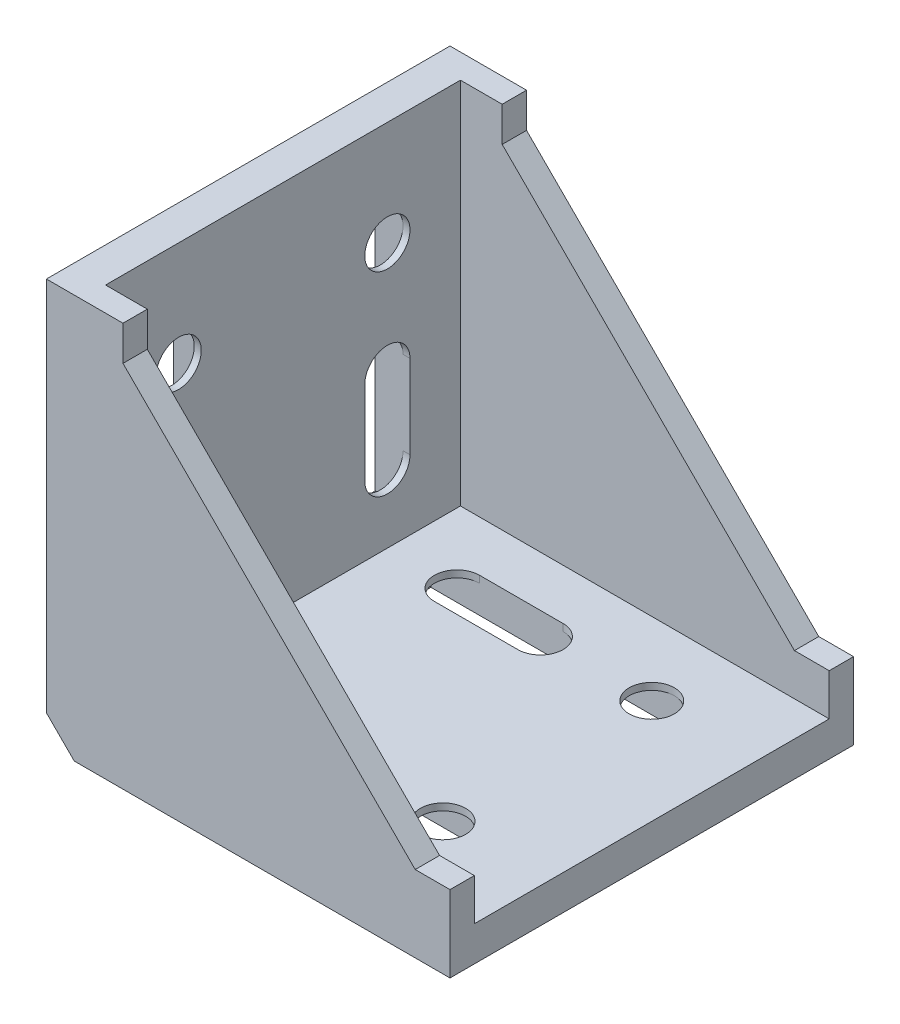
ISO-10303-21;
HEADER;
FILE_DESCRIPTION(('STEP AP214'),'2;1');
FILE_NAME('part.step','',(''),(''),'','','');
FILE_SCHEMA(('AUTOMOTIVE_DESIGN { 1 0 10303 214 1 1 1 1 }'));
ENDSEC;
DATA;
#1=APPLICATION_CONTEXT('core data for automotive mechanical design processes');
#2=APPLICATION_PROTOCOL_DEFINITION('international standard','automotive_design',2000,#1);
#3=PRODUCT_CONTEXT('',#1,'mechanical');
#4=PRODUCT('Part','Part','',(#3));
#5=PRODUCT_RELATED_PRODUCT_CATEGORY('part','',(#4));
#6=PRODUCT_DEFINITION_FORMATION('','',#4);
#7=PRODUCT_DEFINITION_CONTEXT('part definition',#1,'design');
#8=PRODUCT_DEFINITION('design','',#6,#7);
#9=PRODUCT_DEFINITION_SHAPE('','',#8);
#10=(LENGTH_UNIT() NAMED_UNIT(*) SI_UNIT(.MILLI.,.METRE.));
#11=(NAMED_UNIT(*) PLANE_ANGLE_UNIT() SI_UNIT($,.RADIAN.));
#12=(NAMED_UNIT(*) SI_UNIT($,.STERADIAN.) SOLID_ANGLE_UNIT());
#13=UNCERTAINTY_MEASURE_WITH_UNIT(LENGTH_MEASURE(1.E-05),#10,'distance_accuracy_value','');
#14=(GEOMETRIC_REPRESENTATION_CONTEXT(3) GLOBAL_UNCERTAINTY_ASSIGNED_CONTEXT((#13)) GLOBAL_UNIT_ASSIGNED_CONTEXT((#10,
#11,#12)) REPRESENTATION_CONTEXT('',''));
#15=CARTESIAN_POINT('',(0.,0.,0.));
#16=DIRECTION('',(0.,0.,1.));
#17=DIRECTION('',(1.,0.,0.));
#18=AXIS2_PLACEMENT_3D('',#15,#16,#17);
#19=CARTESIAN_POINT('',(5.00000000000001,5.00000000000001,-29.));
#20=DIRECTION('',(0.,1.,0.));
#21=DIRECTION('',(0.,0.,1.));
#22=AXIS2_PLACEMENT_3D('',#19,#20,#21);
#23=PLANE('',#22);
#24=DIRECTION('',(1.,0.,0.));
#25=VECTOR('',#24,1.);
#26=CARTESIAN_POINT('',(4.99999999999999,5.00000000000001,-18.25));
#27=LINE('',#26,#25);
#28=CARTESIAN_POINT('',(15.,5.00000000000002,-18.25));
#29=VERTEX_POINT('',#28);
#30=CARTESIAN_POINT('',(27.,5.00000000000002,-18.25));
#31=VERTEX_POINT('',#30);
#32=EDGE_CURVE('E718',#29,#31,#27,.T.);
#33=ORIENTED_EDGE('',*,*,#32,.T.);
#34=CARTESIAN_POINT('',(27.,5.,-15.));
#35=DIRECTION('',(0.,1.,0.));
#36=DIRECTION('',(0.,0.,1.));
#37=AXIS2_PLACEMENT_3D('',#34,#35,#36);
#38=CIRCLE('',#37,3.25000000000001);
#39=CARTESIAN_POINT('',(27.,5.00000000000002,-11.75));
#40=VERTEX_POINT('',#39);
#41=EDGE_CURVE('E715',#31,#40,#38,.F.);
#42=ORIENTED_EDGE('',*,*,#41,.T.);
#43=DIRECTION('',(-1.,0.,0.));
#44=VECTOR('',#43,1.);
#45=CARTESIAN_POINT('',(5.00000000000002,5.00000000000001,-11.75));
#46=LINE('',#45,#44);
#47=CARTESIAN_POINT('',(15.,5.00000000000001,-11.75));
#48=VERTEX_POINT('',#47);
#49=EDGE_CURVE('E721',#40,#48,#46,.T.);
#50=ORIENTED_EDGE('',*,*,#49,.T.);
#51=CARTESIAN_POINT('',(15.,5.00000000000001,-15.));
#52=DIRECTION('',(0.,1.,0.));
#53=DIRECTION('',(0.,0.,1.));
#54=AXIS2_PLACEMENT_3D('',#51,#52,#53);
#55=CIRCLE('',#54,3.25000000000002);
#56=EDGE_CURVE('E699',#48,#29,#55,.F.);
#57=ORIENTED_EDGE('',*,*,#56,.T.);
#58=EDGE_LOOP('',(#33,#42,#50,#57));
#59=FACE_BOUND('',#58,.T.);
#60=DIRECTION('',(1.,0.,0.));
#61=VECTOR('',#60,1.);
#62=CARTESIAN_POINT('',(4.99999999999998,5.00000000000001,11.75));
#63=LINE('',#62,#61);
#64=CARTESIAN_POINT('',(15.,5.00000000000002,11.75));
#65=VERTEX_POINT('',#64);
#66=CARTESIAN_POINT('',(27.,5.00000000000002,11.75));
#67=VERTEX_POINT('',#66);
#68=EDGE_CURVE('E743',#65,#67,#63,.T.);
#69=ORIENTED_EDGE('',*,*,#68,.T.);
#70=CARTESIAN_POINT('',(27.,5.,15.));
#71=DIRECTION('',(0.,1.,0.));
#72=DIRECTION('',(0.,0.,1.));
#73=AXIS2_PLACEMENT_3D('',#70,#71,#72);
#74=CIRCLE('',#73,3.25000000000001);
#75=CARTESIAN_POINT('',(27.,5.00000000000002,18.25));
#76=VERTEX_POINT('',#75);
#77=EDGE_CURVE('E746',#67,#76,#74,.F.);
#78=ORIENTED_EDGE('',*,*,#77,.T.);
#79=DIRECTION('',(-1.,0.,0.));
#80=VECTOR('',#79,1.);
#81=CARTESIAN_POINT('',(5.00000000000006,5.00000000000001,18.25));
#82=LINE('',#81,#80);
#83=CARTESIAN_POINT('',(15.,5.00000000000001,18.25));
#84=VERTEX_POINT('',#83);
#85=EDGE_CURVE('E731',#76,#84,#82,.T.);
#86=ORIENTED_EDGE('',*,*,#85,.T.);
#87=CARTESIAN_POINT('',(15.,5.00000000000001,15.));
#88=DIRECTION('',(0.,1.,0.));
#89=DIRECTION('',(0.,0.,1.));
#90=AXIS2_PLACEMENT_3D('',#87,#88,#89);
#91=CIRCLE('',#90,3.25000000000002);
#92=EDGE_CURVE('E740',#84,#65,#91,.F.);
#93=ORIENTED_EDGE('',*,*,#92,.T.);
#94=EDGE_LOOP('',(#69,#78,#86,#93));
#95=FACE_BOUND('',#94,.T.);
#96=DIRECTION('',(0.,0.,1.));
#97=VECTOR('',#96,1.);
#98=CARTESIAN_POINT('',(58.,5.00000000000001,-29.));
#99=LINE('',#98,#97);
#100=CARTESIAN_POINT('',(58.,5.00000000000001,-25.5));
#101=VERTEX_POINT('',#100);
#102=CARTESIAN_POINT('',(58.,5.00000000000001,25.5));
#103=VERTEX_POINT('',#102);
#104=EDGE_CURVE('E922',#101,#103,#99,.T.);
#105=ORIENTED_EDGE('',*,*,#104,.F.);
#106=DIRECTION('',(-1.,0.,0.));
#107=VECTOR('',#106,1.);
#108=CARTESIAN_POINT('',(58.,5.00000000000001,-25.5));
#109=LINE('',#108,#107);
#110=CARTESIAN_POINT('',(5.00000000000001,5.00000000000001,-25.5));
#111=VERTEX_POINT('',#110);
#112=EDGE_CURVE('E1068',#101,#111,#109,.T.);
#113=ORIENTED_EDGE('',*,*,#112,.T.);
#114=DIRECTION('',(0.,0.,1.));
#115=VECTOR('',#114,1.);
#116=CARTESIAN_POINT('',(5.00000000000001,5.00000000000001,-29.));
#117=LINE('',#116,#115);
#118=CARTESIAN_POINT('',(5.,5.00000000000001,25.5));
#119=VERTEX_POINT('',#118);
#120=EDGE_CURVE('E920',#111,#119,#117,.T.);
#121=ORIENTED_EDGE('',*,*,#120,.T.);
#122=DIRECTION('',(1.,0.,0.));
#123=VECTOR('',#122,1.);
#124=CARTESIAN_POINT('',(5.,5.00000000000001,25.5));
#125=LINE('',#124,#123);
#126=EDGE_CURVE('E1091',#119,#103,#125,.T.);
#127=ORIENTED_EDGE('',*,*,#126,.T.);
#128=EDGE_LOOP('',(#105,#113,#121,#127));
#129=FACE_BOUND('',#128,.T.);
#130=CARTESIAN_POINT('',(43.,5.,-15.));
#131=DIRECTION('',(0.,1.,0.));
#132=DIRECTION('',(0.,0.,1.));
#133=AXIS2_PLACEMENT_3D('',#130,#131,#132);
#134=CIRCLE('',#133,3.25);
#135=CARTESIAN_POINT('',(43.,5.,-11.75));
#136=VERTEX_POINT('',#135);
#137=EDGE_CURVE('E724',#136,#136,#134,.F.);
#138=ORIENTED_EDGE('',*,*,#137,.T.);
#139=EDGE_LOOP('',(#138));
#140=FACE_BOUND('',#139,.T.);
#141=CARTESIAN_POINT('',(43.,5.,15.));
#142=DIRECTION('',(0.,1.,0.));
#143=DIRECTION('',(0.,0.,1.));
#144=AXIS2_PLACEMENT_3D('',#141,#142,#143);
#145=CIRCLE('',#144,3.25);
#146=CARTESIAN_POINT('',(43.,5.,18.25));
#147=VERTEX_POINT('',#146);
#148=EDGE_CURVE('E2792',#147,#147,#145,.F.);
#149=ORIENTED_EDGE('',*,*,#148,.T.);
#150=EDGE_LOOP('',(#149));
#151=FACE_BOUND('',#150,.T.);
#152=ADVANCED_FACE('F35',(#59,#95,#129,#140,#151),#23,.T.);
#153=CARTESIAN_POINT('',(52.,4.00000000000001,18.25));
#154=DIRECTION('',(0.,-1.,0.));
#155=DIRECTION('',(-1.,0.,0.));
#156=AXIS2_PLACEMENT_3D('',#153,#154,#155);
#157=PLANE('',#156);
#158=DIRECTION('',(1.,0.,0.));
#159=VECTOR('',#158,1.);
#160=CARTESIAN_POINT('',(43.,4.00000000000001,18.25));
#161=LINE('',#160,#159);
#162=CARTESIAN_POINT('',(43.,4.00000000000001,18.25));
#163=VERTEX_POINT('',#162);
#164=CARTESIAN_POINT('',(52.,4.00000000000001,18.25));
#165=VERTEX_POINT('',#164);
#166=EDGE_CURVE('E2864',#163,#165,#161,.T.);
#167=ORIENTED_EDGE('',*,*,#166,.F.);
#168=CARTESIAN_POINT('',(43.,4.00000000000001,15.));
#169=DIRECTION('',(0.,-1.,0.));
#170=DIRECTION('',(1.,0.,0.));
#171=AXIS2_PLACEMENT_3D('',#168,#169,#170);
#172=CIRCLE('',#171,3.25);
#173=EDGE_CURVE('E2794',#163,#163,#172,.F.);
#174=ORIENTED_EDGE('',*,*,#173,.T.);
#175=CARTESIAN_POINT('',(27.,4.00000000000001,18.25));
#176=VERTEX_POINT('',#175);
#177=EDGE_CURVE('E2865',#176,#163,#161,.T.);
#178=ORIENTED_EDGE('',*,*,#177,.F.);
#179=CARTESIAN_POINT('',(27.,4.,15.));
#180=DIRECTION('',(0.,-1.,0.));
#181=DIRECTION('',(1.,0.,0.));
#182=AXIS2_PLACEMENT_3D('',#179,#180,#181);
#183=CIRCLE('',#182,3.25000000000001);
#184=CARTESIAN_POINT('',(27.,4.00000000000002,11.75));
#185=VERTEX_POINT('',#184);
#186=EDGE_CURVE('E691',#176,#185,#183,.F.);
#187=ORIENTED_EDGE('',*,*,#186,.T.);
#188=DIRECTION('',(-1.,0.,0.));
#189=VECTOR('',#188,1.);
#190=CARTESIAN_POINT('',(52.,4.00000000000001,11.75));
#191=LINE('',#190,#189);
#192=CARTESIAN_POINT('',(15.,4.00000000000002,11.75));
#193=VERTEX_POINT('',#192);
#194=EDGE_CURVE('E869',#185,#193,#191,.T.);
#195=ORIENTED_EDGE('',*,*,#194,.T.);
#196=CARTESIAN_POINT('',(15.,4.,15.));
#197=DIRECTION('',(0.,-1.,0.));
#198=DIRECTION('',(1.,0.,0.));
#199=AXIS2_PLACEMENT_3D('',#196,#197,#198);
#200=CIRCLE('',#199,3.25000000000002);
#201=CARTESIAN_POINT('',(15.,4.00000000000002,18.25));
#202=VERTEX_POINT('',#201);
#203=EDGE_CURVE('E866',#193,#202,#200,.F.);
#204=ORIENTED_EDGE('',*,*,#203,.T.);
#205=CARTESIAN_POINT('',(8.,4.,18.25));
#206=VERTEX_POINT('',#205);
#207=EDGE_CURVE('E2867',#206,#202,#161,.T.);
#208=ORIENTED_EDGE('',*,*,#207,.F.);
#209=DIRECTION('',(0.,0.,1.));
#210=VECTOR('',#209,1.);
#211=CARTESIAN_POINT('',(8.,4.,10.75));
#212=LINE('',#211,#210);
#213=CARTESIAN_POINT('',(8.,4.,10.75));
#214=VERTEX_POINT('',#213);
#215=EDGE_CURVE('E2852',#214,#206,#212,.T.);
#216=ORIENTED_EDGE('',*,*,#215,.F.);
#217=DIRECTION('',(-1.,0.,0.));
#218=VECTOR('',#217,1.);
#219=CARTESIAN_POINT('',(52.,4.00000000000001,10.75));
#220=LINE('',#219,#218);
#221=CARTESIAN_POINT('',(52.,4.00000000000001,10.75));
#222=VERTEX_POINT('',#221);
#223=EDGE_CURVE('E2848',#222,#214,#220,.T.);
#224=ORIENTED_EDGE('',*,*,#223,.F.);
#225=DIRECTION('',(0.,0.,-1.));
#226=VECTOR('',#225,1.);
#227=CARTESIAN_POINT('',(52.,4.00000000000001,18.25));
#228=LINE('',#227,#226);
#229=EDGE_CURVE('E2845',#165,#222,#228,.T.);
#230=ORIENTED_EDGE('',*,*,#229,.F.);
#231=EDGE_LOOP('',(#167,#174,#178,#187,#195,#204,#208,#216,#224,#230));
#232=FACE_BOUND('',#231,.T.);
#233=ADVANCED_FACE('F1174',(#232),#157,.T.);
#234=CARTESIAN_POINT('',(8.,4.,-18.25));
#235=DIRECTION('',(0.,1.,0.));
#236=DIRECTION('',(1.,0.,0.));
#237=AXIS2_PLACEMENT_3D('',#234,#235,#236);
#238=PLANE('',#237);
#239=CARTESIAN_POINT('',(27.,4.00000000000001,-15.));
#240=DIRECTION('',(0.,1.,0.));
#241=DIRECTION('',(-1.,0.,0.));
#242=AXIS2_PLACEMENT_3D('',#239,#240,#241);
#243=CIRCLE('',#242,3.25000000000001);
#244=CARTESIAN_POINT('',(27.,4.00000000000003,-18.25));
#245=VERTEX_POINT('',#244);
#246=CARTESIAN_POINT('',(27.,4.00000000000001,-11.75));
#247=VERTEX_POINT('',#246);
#248=EDGE_CURVE('E709',#245,#247,#243,.F.);
#249=ORIENTED_EDGE('',*,*,#248,.F.);
#250=DIRECTION('',(-1.,0.,0.));
#251=VECTOR('',#250,1.);
#252=CARTESIAN_POINT('',(43.,4.00000000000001,-18.25));
#253=LINE('',#252,#251);
#254=CARTESIAN_POINT('',(43.,4.00000000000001,-18.25));
#255=VERTEX_POINT('',#254);
#256=EDGE_CURVE('E2804',#255,#245,#253,.T.);
#257=ORIENTED_EDGE('',*,*,#256,.F.);
#258=CARTESIAN_POINT('',(43.,4.00000000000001,-15.));
#259=DIRECTION('',(0.,1.,0.));
#260=DIRECTION('',(-1.,0.,0.));
#261=AXIS2_PLACEMENT_3D('',#258,#259,#260);
#262=CIRCLE('',#261,3.25);
#263=EDGE_CURVE('E723',#255,#255,#262,.F.);
#264=ORIENTED_EDGE('',*,*,#263,.F.);
#265=CARTESIAN_POINT('',(52.,4.00000000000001,-18.25));
#266=VERTEX_POINT('',#265);
#267=EDGE_CURVE('E2807',#266,#255,#253,.T.);
#268=ORIENTED_EDGE('',*,*,#267,.F.);
#269=DIRECTION('',(0.,0.,-1.));
#270=VECTOR('',#269,1.);
#271=CARTESIAN_POINT('',(52.,4.00000000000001,-18.25));
#272=LINE('',#271,#270);
#273=CARTESIAN_POINT('',(52.,4.00000000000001,-10.75));
#274=VERTEX_POINT('',#273);
#275=EDGE_CURVE('E2809',#274,#266,#272,.T.);
#276=ORIENTED_EDGE('',*,*,#275,.F.);
#277=DIRECTION('',(1.,0.,0.));
#278=VECTOR('',#277,1.);
#279=CARTESIAN_POINT('',(52.,4.00000000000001,-10.75));
#280=LINE('',#279,#278);
#281=CARTESIAN_POINT('',(8.,4.,-10.75));
#282=VERTEX_POINT('',#281);
#283=EDGE_CURVE('E2816',#282,#274,#280,.T.);
#284=ORIENTED_EDGE('',*,*,#283,.F.);
#285=DIRECTION('',(0.,0.,1.));
#286=VECTOR('',#285,1.);
#287=CARTESIAN_POINT('',(8.,4.,-10.75));
#288=LINE('',#287,#286);
#289=CARTESIAN_POINT('',(8.,4.,-18.25));
#290=VERTEX_POINT('',#289);
#291=EDGE_CURVE('E1365',#290,#282,#288,.T.);
#292=ORIENTED_EDGE('',*,*,#291,.F.);
#293=CARTESIAN_POINT('',(15.,4.00000000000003,-18.25));
#294=VERTEX_POINT('',#293);
#295=EDGE_CURVE('E706',#294,#290,#253,.T.);
#296=ORIENTED_EDGE('',*,*,#295,.F.);
#297=CARTESIAN_POINT('',(15.,4.,-15.));
#298=DIRECTION('',(0.,1.,0.));
#299=DIRECTION('',(-1.,0.,0.));
#300=AXIS2_PLACEMENT_3D('',#297,#298,#299);
#301=CIRCLE('',#300,3.25000000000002);
#302=CARTESIAN_POINT('',(15.,4.00000000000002,-11.75));
#303=VERTEX_POINT('',#302);
#304=EDGE_CURVE('E696',#303,#294,#301,.F.);
#305=ORIENTED_EDGE('',*,*,#304,.F.);
#306=DIRECTION('',(-1.,0.,0.));
#307=VECTOR('',#306,1.);
#308=CARTESIAN_POINT('',(8.,4.,-11.75));
#309=LINE('',#308,#307);
#310=EDGE_CURVE('E679',#247,#303,#309,.T.);
#311=ORIENTED_EDGE('',*,*,#310,.F.);
#312=EDGE_LOOP('',(#249,#257,#264,#268,#276,#284,#292,#296,#305,#311));
#313=FACE_BOUND('',#312,.T.);
#314=ADVANCED_FACE('F704',(#313),#238,.F.);
#315=CARTESIAN_POINT('',(58.,0.,-29.));
#316=DIRECTION('',(0.,-1.,0.));
#317=DIRECTION('',(1.,0.,0.));
#318=AXIS2_PLACEMENT_3D('',#315,#316,#317);
#319=PLANE('',#318);
#320=DIRECTION('',(1.,0.,0.));
#321=VECTOR('',#320,1.);
#322=CARTESIAN_POINT('',(54.,0.,17.5));
#323=LINE('',#322,#321);
#324=CARTESIAN_POINT('',(52.,0.,17.5));
#325=VERTEX_POINT('',#324);
#326=CARTESIAN_POINT('',(54.,0.,17.5));
#327=VERTEX_POINT('',#326);
#328=EDGE_CURVE('E749',#325,#327,#323,.T.);
#329=ORIENTED_EDGE('',*,*,#328,.T.);
#330=DIRECTION('',(0.,0.,-1.));
#331=VECTOR('',#330,1.);
#332=CARTESIAN_POINT('',(54.,0.,12.5));
#333=LINE('',#332,#331);
#334=CARTESIAN_POINT('',(54.,0.,12.5));
#335=VERTEX_POINT('',#334);
#336=EDGE_CURVE('E754',#327,#335,#333,.T.);
#337=ORIENTED_EDGE('',*,*,#336,.T.);
#338=DIRECTION('',(-1.,0.,0.));
#339=VECTOR('',#338,1.);
#340=CARTESIAN_POINT('',(52.,0.,12.5));
#341=LINE('',#340,#339);
#342=CARTESIAN_POINT('',(52.,0.,12.5));
#343=VERTEX_POINT('',#342);
#344=EDGE_CURVE('E765',#335,#343,#341,.T.);
#345=ORIENTED_EDGE('',*,*,#344,.T.);
#346=DIRECTION('',(0.,0.,-1.));
#347=VECTOR('',#346,1.);
#348=CARTESIAN_POINT('',(52.,0.,18.25));
#349=LINE('',#348,#347);
#350=CARTESIAN_POINT('',(52.,0.,10.75));
#351=VERTEX_POINT('',#350);
#352=EDGE_CURVE('E2863',#343,#351,#349,.T.);
#353=ORIENTED_EDGE('',*,*,#352,.T.);
#354=DIRECTION('',(-1.,0.,0.));
#355=VECTOR('',#354,1.);
#356=CARTESIAN_POINT('',(52.,0.,10.75));
#357=LINE('',#356,#355);
#358=CARTESIAN_POINT('',(8.,0.,10.75));
#359=VERTEX_POINT('',#358);
#360=EDGE_CURVE('E2861',#351,#359,#357,.T.);
#361=ORIENTED_EDGE('',*,*,#360,.T.);
#362=DIRECTION('',(0.,0.,1.));
#363=VECTOR('',#362,1.);
#364=CARTESIAN_POINT('',(8.,0.,10.75));
#365=LINE('',#364,#363);
#366=CARTESIAN_POINT('',(8.,0.,12.1518222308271));
#367=VERTEX_POINT('',#366);
#368=EDGE_CURVE('E2860',#359,#367,#365,.T.);
#369=ORIENTED_EDGE('',*,*,#368,.T.);
#370=DIRECTION('',(-1.,0.,0.));
#371=VECTOR('',#370,1.);
#372=CARTESIAN_POINT('',(8.,0.,12.1518222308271));
#373=LINE('',#372,#371);
#374=CARTESIAN_POINT('',(6.00000000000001,0.,12.1518222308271));
#375=VERTEX_POINT('',#374);
#376=EDGE_CURVE('E785',#367,#375,#373,.T.);
#377=ORIENTED_EDGE('',*,*,#376,.T.);
#378=DIRECTION('',(0.,0.,1.));
#379=VECTOR('',#378,1.);
#380=CARTESIAN_POINT('',(6.,0.,12.1518222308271));
#381=LINE('',#380,#379);
#382=CARTESIAN_POINT('',(6.,0.,17.1518222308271));
#383=VERTEX_POINT('',#382);
#384=EDGE_CURVE('E797',#375,#383,#381,.T.);
#385=ORIENTED_EDGE('',*,*,#384,.T.);
#386=DIRECTION('',(1.,0.,0.));
#387=VECTOR('',#386,1.);
#388=CARTESIAN_POINT('',(6.,0.,17.1518222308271));
#389=LINE('',#388,#387);
#390=CARTESIAN_POINT('',(8.,0.,17.1518222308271));
#391=VERTEX_POINT('',#390);
#392=EDGE_CURVE('E780',#383,#391,#389,.T.);
#393=ORIENTED_EDGE('',*,*,#392,.T.);
#394=CARTESIAN_POINT('',(8.00000000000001,0.,18.25));
#395=VERTEX_POINT('',#394);
#396=EDGE_CURVE('E2858',#391,#395,#365,.T.);
#397=ORIENTED_EDGE('',*,*,#396,.T.);
#398=DIRECTION('',(1.,0.,0.));
#399=VECTOR('',#398,1.);
#400=CARTESIAN_POINT('',(43.,0.,18.25));
#401=LINE('',#400,#399);
#402=CARTESIAN_POINT('',(52.,0.,18.25));
#403=VERTEX_POINT('',#402);
#404=EDGE_CURVE('E2856',#395,#403,#401,.T.);
#405=ORIENTED_EDGE('',*,*,#404,.T.);
#406=EDGE_CURVE('E2839',#403,#325,#349,.T.);
#407=ORIENTED_EDGE('',*,*,#406,.T.);
#408=EDGE_LOOP('',(#329,#337,#345,#353,#361,#369,#377,#385,#393,#397,#405,#407));
#409=FACE_BOUND('',#408,.T.);
#410=DIRECTION('',(1.,0.,0.));
#411=VECTOR('',#410,1.);
#412=CARTESIAN_POINT('',(8.,0.,-12.1518222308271));
#413=LINE('',#412,#411);
#414=CARTESIAN_POINT('',(6.,0.,-12.1518222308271));
#415=VERTEX_POINT('',#414);
#416=CARTESIAN_POINT('',(8.,0.,-12.1518222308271));
#417=VERTEX_POINT('',#416);
#418=EDGE_CURVE('E811',#415,#417,#413,.T.);
#419=ORIENTED_EDGE('',*,*,#418,.T.);
#420=DIRECTION('',(0.,0.,1.));
#421=VECTOR('',#420,1.);
#422=CARTESIAN_POINT('',(8.,0.,-10.75));
#423=LINE('',#422,#421);
#424=CARTESIAN_POINT('',(8.,0.,-10.75));
#425=VERTEX_POINT('',#424);
#426=EDGE_CURVE('E1350',#417,#425,#423,.T.);
#427=ORIENTED_EDGE('',*,*,#426,.T.);
#428=DIRECTION('',(1.,0.,0.));
#429=VECTOR('',#428,1.);
#430=CARTESIAN_POINT('',(52.,0.,-10.75));
#431=LINE('',#430,#429);
#432=CARTESIAN_POINT('',(52.,0.,-10.75));
#433=VERTEX_POINT('',#432);
#434=EDGE_CURVE('E1339',#425,#433,#431,.T.);
#435=ORIENTED_EDGE('',*,*,#434,.T.);
#436=DIRECTION('',(0.,0.,-1.));
#437=VECTOR('',#436,1.);
#438=CARTESIAN_POINT('',(52.,0.,-18.25));
#439=LINE('',#438,#437);
#440=CARTESIAN_POINT('',(52.,0.,-12.5));
#441=VERTEX_POINT('',#440);
#442=EDGE_CURVE('E1335',#433,#441,#439,.T.);
#443=ORIENTED_EDGE('',*,*,#442,.T.);
#444=DIRECTION('',(1.,0.,0.));
#445=VECTOR('',#444,1.);
#446=CARTESIAN_POINT('',(52.,0.,-12.5));
#447=LINE('',#446,#445);
#448=CARTESIAN_POINT('',(54.,0.,-12.5));
#449=VERTEX_POINT('',#448);
#450=EDGE_CURVE('E846',#441,#449,#447,.T.);
#451=ORIENTED_EDGE('',*,*,#450,.T.);
#452=DIRECTION('',(0.,0.,-1.));
#453=VECTOR('',#452,1.);
#454=CARTESIAN_POINT('',(54.,0.,-12.5));
#455=LINE('',#454,#453);
#456=CARTESIAN_POINT('',(54.,0.,-17.5));
#457=VERTEX_POINT('',#456);
#458=EDGE_CURVE('E858',#449,#457,#455,.T.);
#459=ORIENTED_EDGE('',*,*,#458,.T.);
#460=DIRECTION('',(-1.,0.,0.));
#461=VECTOR('',#460,1.);
#462=CARTESIAN_POINT('',(54.,0.,-17.5));
#463=LINE('',#462,#461);
#464=CARTESIAN_POINT('',(52.,0.,-17.5));
#465=VERTEX_POINT('',#464);
#466=EDGE_CURVE('E842',#457,#465,#463,.T.);
#467=ORIENTED_EDGE('',*,*,#466,.T.);
#468=CARTESIAN_POINT('',(52.,0.,-18.25));
#469=VERTEX_POINT('',#468);
#470=EDGE_CURVE('E1340',#465,#469,#439,.T.);
#471=ORIENTED_EDGE('',*,*,#470,.T.);
#472=DIRECTION('',(-1.,0.,0.));
#473=VECTOR('',#472,1.);
#474=CARTESIAN_POINT('',(43.,0.,-18.25));
#475=LINE('',#474,#473);
#476=CARTESIAN_POINT('',(8.,0.,-18.25));
#477=VERTEX_POINT('',#476);
#478=EDGE_CURVE('E1345',#469,#477,#475,.T.);
#479=ORIENTED_EDGE('',*,*,#478,.T.);
#480=CARTESIAN_POINT('',(8.,0.,-17.1518222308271));
#481=VERTEX_POINT('',#480);
#482=EDGE_CURVE('E1351',#477,#481,#423,.T.);
#483=ORIENTED_EDGE('',*,*,#482,.T.);
#484=DIRECTION('',(-1.,0.,0.));
#485=VECTOR('',#484,1.);
#486=CARTESIAN_POINT('',(6.,0.,-17.1518222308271));
#487=LINE('',#486,#485);
#488=CARTESIAN_POINT('',(6.,0.,-17.1518222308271));
#489=VERTEX_POINT('',#488);
#490=EDGE_CURVE('E816',#481,#489,#487,.T.);
#491=ORIENTED_EDGE('',*,*,#490,.T.);
#492=DIRECTION('',(0.,0.,1.));
#493=VECTOR('',#492,1.);
#494=CARTESIAN_POINT('',(6.,0.,-12.1518222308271));
#495=LINE('',#494,#493);
#496=EDGE_CURVE('E828',#489,#415,#495,.T.);
#497=ORIENTED_EDGE('',*,*,#496,.T.);
#498=EDGE_LOOP('',(#419,#427,#435,#443,#451,#459,#467,#471,#479,#483,#491,#497));
#499=FACE_BOUND('',#498,.T.);
#500=DIRECTION('',(-1.,0.,0.));
#501=VECTOR('',#500,1.);
#502=CARTESIAN_POINT('',(54.5,0.,21.7384015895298));
#503=LINE('',#502,#501);
#504=CARTESIAN_POINT('',(54.5,0.,21.7384015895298));
#505=VERTEX_POINT('',#504);
#506=CARTESIAN_POINT('',(5.,0.,21.7384015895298));
#507=VERTEX_POINT('',#506);
#508=EDGE_CURVE('E2888',#505,#507,#503,.T.);
#509=ORIENTED_EDGE('',*,*,#508,.T.);
#510=DIRECTION('',(0.,0.,1.));
#511=VECTOR('',#510,1.);
#512=CARTESIAN_POINT('',(5.,0.,21.7384015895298));
#513=LINE('',#512,#511);
#514=CARTESIAN_POINT('',(5.,0.,25.7384015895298));
#515=VERTEX_POINT('',#514);
#516=EDGE_CURVE('E2900',#507,#515,#513,.T.);
#517=ORIENTED_EDGE('',*,*,#516,.T.);
#518=DIRECTION('',(1.,0.,0.));
#519=VECTOR('',#518,1.);
#520=CARTESIAN_POINT('',(5.,0.,25.7384015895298));
#521=LINE('',#520,#519);
#522=CARTESIAN_POINT('',(54.5,0.,25.7384015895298));
#523=VERTEX_POINT('',#522);
#524=EDGE_CURVE('E2906',#515,#523,#521,.T.);
#525=ORIENTED_EDGE('',*,*,#524,.T.);
#526=DIRECTION('',(0.,0.,-1.));
#527=VECTOR('',#526,1.);
#528=CARTESIAN_POINT('',(54.5,0.,25.7384015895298));
#529=LINE('',#528,#527);
#530=EDGE_CURVE('E2902',#523,#505,#529,.T.);
#531=ORIENTED_EDGE('',*,*,#530,.T.);
#532=EDGE_LOOP('',(#509,#517,#525,#531));
#533=FACE_BOUND('',#532,.T.);
#534=DIRECTION('',(0.,0.,-1.));
#535=VECTOR('',#534,1.);
#536=CARTESIAN_POINT('',(54.5,0.,0.));
#537=LINE('',#536,#535);
#538=CARTESIAN_POINT('',(54.5,0.,8.));
#539=VERTEX_POINT('',#538);
#540=CARTESIAN_POINT('',(54.5,0.,-8.));
#541=VERTEX_POINT('',#540);
#542=EDGE_CURVE('E1390',#539,#541,#537,.T.);
#543=ORIENTED_EDGE('',*,*,#542,.T.);
#544=DIRECTION('',(-1.,0.,0.));
#545=VECTOR('',#544,1.);
#546=CARTESIAN_POINT('',(5.68753116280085,0.,-8.));
#547=LINE('',#546,#545);
#548=CARTESIAN_POINT('',(5.68753116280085,0.,-8.));
#549=VERTEX_POINT('',#548);
#550=EDGE_CURVE('E1401',#541,#549,#547,.T.);
#551=ORIENTED_EDGE('',*,*,#550,.T.);
#552=DIRECTION('',(0.,0.,1.));
#553=VECTOR('',#552,1.);
#554=CARTESIAN_POINT('',(5.68753116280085,0.,8.00000000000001));
#555=LINE('',#554,#553);
#556=CARTESIAN_POINT('',(5.68753116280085,0.,8.00000000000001));
#557=VERTEX_POINT('',#556);
#558=EDGE_CURVE('E1414',#549,#557,#555,.T.);
#559=ORIENTED_EDGE('',*,*,#558,.T.);
#560=DIRECTION('',(1.,0.,0.));
#561=VECTOR('',#560,1.);
#562=CARTESIAN_POINT('',(54.5,0.,8.));
#563=LINE('',#562,#561);
#564=EDGE_CURVE('E1411',#557,#539,#563,.T.);
#565=ORIENTED_EDGE('',*,*,#564,.T.);
#566=EDGE_LOOP('',(#543,#551,#559,#565));
#567=FACE_BOUND('',#566,.T.);
#568=DIRECTION('',(1.,0.,0.));
#569=VECTOR('',#568,1.);
#570=CARTESIAN_POINT('',(58.,0.,29.));
#571=LINE('',#570,#569);
#572=CARTESIAN_POINT('',(4.00000000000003,0.,29.));
#573=VERTEX_POINT('',#572);
#574=CARTESIAN_POINT('',(58.,0.,29.));
#575=VERTEX_POINT('',#574);
#576=EDGE_CURVE('E893',#573,#575,#571,.T.);
#577=ORIENTED_EDGE('',*,*,#576,.F.);
#578=DIRECTION('',(0.,0.,-1.));
#579=VECTOR('',#578,1.);
#580=CARTESIAN_POINT('',(4.00000000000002,0.,-29.));
#581=LINE('',#580,#579);
#582=CARTESIAN_POINT('',(4.00000000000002,0.,-29.));
#583=VERTEX_POINT('',#582);
#584=EDGE_CURVE('E43',#573,#583,#581,.T.);
#585=ORIENTED_EDGE('',*,*,#584,.T.);
#586=DIRECTION('',(1.,0.,0.));
#587=VECTOR('',#586,1.);
#588=CARTESIAN_POINT('',(58.,0.,-29.));
#589=LINE('',#588,#587);
#590=CARTESIAN_POINT('',(58.,0.,-29.));
#591=VERTEX_POINT('',#590);
#592=EDGE_CURVE('E908',#583,#591,#589,.T.);
#593=ORIENTED_EDGE('',*,*,#592,.T.);
#594=DIRECTION('',(0.,0.,1.));
#595=VECTOR('',#594,1.);
#596=CARTESIAN_POINT('',(58.,0.,-29.));
#597=LINE('',#596,#595);
#598=EDGE_CURVE('E915',#591,#575,#597,.T.);
#599=ORIENTED_EDGE('',*,*,#598,.T.);
#600=EDGE_LOOP('',(#577,#585,#593,#599));
#601=FACE_BOUND('',#600,.T.);
#602=DIRECTION('',(0.,0.,-1.));
#603=VECTOR('',#602,1.);
#604=CARTESIAN_POINT('',(54.5,0.,-25.7384015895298));
#605=LINE('',#604,#603);
#606=CARTESIAN_POINT('',(54.5,0.,-21.7384015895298));
#607=VERTEX_POINT('',#606);
#608=CARTESIAN_POINT('',(54.5,0.,-25.7384015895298));
#609=VERTEX_POINT('',#608);
#610=EDGE_CURVE('E1379',#607,#609,#605,.T.);
#611=ORIENTED_EDGE('',*,*,#610,.T.);
#612=DIRECTION('',(-1.,0.,0.));
#613=VECTOR('',#612,1.);
#614=CARTESIAN_POINT('',(5.,0.,-25.7384015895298));
#615=LINE('',#614,#613);
#616=CARTESIAN_POINT('',(5.,0.,-25.7384015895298));
#617=VERTEX_POINT('',#616);
#618=EDGE_CURVE('E1356',#609,#617,#615,.T.);
#619=ORIENTED_EDGE('',*,*,#618,.T.);
#620=DIRECTION('',(0.,0.,1.));
#621=VECTOR('',#620,1.);
#622=CARTESIAN_POINT('',(5.,0.,-21.7384015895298));
#623=LINE('',#622,#621);
#624=CARTESIAN_POINT('',(5.,0.,-21.7384015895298));
#625=VERTEX_POINT('',#624);
#626=EDGE_CURVE('E1370',#617,#625,#623,.T.);
#627=ORIENTED_EDGE('',*,*,#626,.T.);
#628=DIRECTION('',(1.,0.,0.));
#629=VECTOR('',#628,1.);
#630=CARTESIAN_POINT('',(54.5,0.,-21.7384015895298));
#631=LINE('',#630,#629);
#632=EDGE_CURVE('E1382',#625,#607,#631,.T.);
#633=ORIENTED_EDGE('',*,*,#632,.T.);
#634=EDGE_LOOP('',(#611,#619,#627,#633));
#635=FACE_BOUND('',#634,.T.);
#636=ADVANCED_FACE('F1128',(#409,#499,#533,#567,#601,#635),#319,.T.);
#637=CARTESIAN_POINT('',(0.,0.,-29.));
#638=DIRECTION('',(-1.,0.,0.));
#639=DIRECTION('',(0.,-1.,0.));
#640=AXIS2_PLACEMENT_3D('',#637,#638,#639);
#641=PLANE('',#640);
#642=DIRECTION('',(0.,0.,-1.));
#643=VECTOR('',#642,1.);
#644=CARTESIAN_POINT('',(0.,54.5,0.));
#645=LINE('',#644,#643);
#646=CARTESIAN_POINT('',(0.,54.5,8.));
#647=VERTEX_POINT('',#646);
#648=CARTESIAN_POINT('',(0.,54.5,-8.));
#649=VERTEX_POINT('',#648);
#650=EDGE_CURVE('E1203',#647,#649,#645,.T.);
#651=ORIENTED_EDGE('',*,*,#650,.F.);
#652=DIRECTION('',(0.,1.,0.));
#653=VECTOR('',#652,1.);
#654=CARTESIAN_POINT('',(0.,54.5,8.));
#655=LINE('',#654,#653);
#656=CARTESIAN_POINT('',(0.,5.68753116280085,8.00000000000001));
#657=VERTEX_POINT('',#656);
#658=EDGE_CURVE('E1206',#657,#647,#655,.T.);
#659=ORIENTED_EDGE('',*,*,#658,.F.);
#660=DIRECTION('',(0.,0.,1.));
#661=VECTOR('',#660,1.);
#662=CARTESIAN_POINT('',(0.,5.68753116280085,8.00000000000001));
#663=LINE('',#662,#661);
#664=CARTESIAN_POINT('',(0.,5.68753116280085,-8.));
#665=VERTEX_POINT('',#664);
#666=EDGE_CURVE('E1215',#665,#657,#663,.T.);
#667=ORIENTED_EDGE('',*,*,#666,.F.);
#668=DIRECTION('',(0.,-1.,0.));
#669=VECTOR('',#668,1.);
#670=CARTESIAN_POINT('',(0.,5.68753116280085,-8.));
#671=LINE('',#670,#669);
#672=EDGE_CURVE('E1208',#649,#665,#671,.T.);
#673=ORIENTED_EDGE('',*,*,#672,.F.);
#674=EDGE_LOOP('',(#651,#659,#667,#673));
#675=FACE_BOUND('',#674,.T.);
#676=DIRECTION('',(0.,-1.,0.));
#677=VECTOR('',#676,1.);
#678=CARTESIAN_POINT('',(0.,0.,-29.));
#679=LINE('',#678,#677);
#680=CARTESIAN_POINT('',(0.,58.,-29.));
#681=VERTEX_POINT('',#680);
#682=CARTESIAN_POINT('',(0.,3.99999999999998,-29.));
#683=VERTEX_POINT('',#682);
#684=EDGE_CURVE('E886',#681,#683,#679,.T.);
#685=ORIENTED_EDGE('',*,*,#684,.T.);
#686=DIRECTION('',(0.,0.,1.));
#687=VECTOR('',#686,1.);
#688=CARTESIAN_POINT('',(0.,4.,-29.));
#689=LINE('',#688,#687);
#690=CARTESIAN_POINT('',(0.,4.,29.));
#691=VERTEX_POINT('',#690);
#692=EDGE_CURVE('E690',#683,#691,#689,.T.);
#693=ORIENTED_EDGE('',*,*,#692,.T.);
#694=DIRECTION('',(0.,-1.,0.));
#695=VECTOR('',#694,1.);
#696=CARTESIAN_POINT('',(0.,0.,29.));
#697=LINE('',#696,#695);
#698=CARTESIAN_POINT('',(0.,58.,29.));
#699=VERTEX_POINT('',#698);
#700=EDGE_CURVE('E884',#699,#691,#697,.T.);
#701=ORIENTED_EDGE('',*,*,#700,.F.);
#702=DIRECTION('',(0.,0.,1.));
#703=VECTOR('',#702,1.);
#704=CARTESIAN_POINT('',(0.,58.,-29.));
#705=LINE('',#704,#703);
#706=EDGE_CURVE('E916',#681,#699,#705,.T.);
#707=ORIENTED_EDGE('',*,*,#706,.F.);
#708=EDGE_LOOP('',(#685,#693,#701,#707));
#709=FACE_BOUND('',#708,.T.);
#710=DIRECTION('',(0.,-1.,0.));
#711=VECTOR('',#710,1.);
#712=CARTESIAN_POINT('',(0.,5.,-25.7384015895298));
#713=LINE('',#712,#711);
#714=CARTESIAN_POINT('',(0.,54.5,-25.7384015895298));
#715=VERTEX_POINT('',#714);
#716=CARTESIAN_POINT('',(0.,5.,-25.7384015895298));
#717=VERTEX_POINT('',#716);
#718=EDGE_CURVE('E965',#715,#717,#713,.T.);
#719=ORIENTED_EDGE('',*,*,#718,.F.);
#720=DIRECTION('',(0.,0.,-1.));
#721=VECTOR('',#720,1.);
#722=CARTESIAN_POINT('',(0.,54.5,-25.7384015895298));
#723=LINE('',#722,#721);
#724=CARTESIAN_POINT('',(0.,54.5,-21.7384015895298));
#725=VERTEX_POINT('',#724);
#726=EDGE_CURVE('E970',#725,#715,#723,.T.);
#727=ORIENTED_EDGE('',*,*,#726,.F.);
#728=DIRECTION('',(0.,1.,0.));
#729=VECTOR('',#728,1.);
#730=CARTESIAN_POINT('',(0.,54.5,-21.7384015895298));
#731=LINE('',#730,#729);
#732=CARTESIAN_POINT('',(0.,5.,-21.7384015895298));
#733=VERTEX_POINT('',#732);
#734=EDGE_CURVE('E984',#733,#725,#731,.T.);
#735=ORIENTED_EDGE('',*,*,#734,.F.);
#736=DIRECTION('',(0.,0.,1.));
#737=VECTOR('',#736,1.);
#738=CARTESIAN_POINT('',(0.,5.,-21.7384015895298));
#739=LINE('',#738,#737);
#740=EDGE_CURVE('E981',#717,#733,#739,.T.);
#741=ORIENTED_EDGE('',*,*,#740,.F.);
#742=EDGE_LOOP('',(#719,#727,#735,#741));
#743=FACE_BOUND('',#742,.T.);
#744=DIRECTION('',(0.,0.,1.));
#745=VECTOR('',#744,1.);
#746=CARTESIAN_POINT('',(0.,5.,21.7384015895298));
#747=LINE('',#746,#745);
#748=CARTESIAN_POINT('',(0.,5.,21.7384015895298));
#749=VERTEX_POINT('',#748);
#750=CARTESIAN_POINT('',(0.,5.,25.7384015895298));
#751=VERTEX_POINT('',#750);
#752=EDGE_CURVE('E2689',#749,#751,#747,.T.);
#753=ORIENTED_EDGE('',*,*,#752,.F.);
#754=DIRECTION('',(0.,-1.,0.));
#755=VECTOR('',#754,1.);
#756=CARTESIAN_POINT('',(0.,54.5,21.7384015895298));
#757=LINE('',#756,#755);
#758=CARTESIAN_POINT('',(0.,54.5,21.7384015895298));
#759=VERTEX_POINT('',#758);
#760=EDGE_CURVE('E2702',#759,#749,#757,.T.);
#761=ORIENTED_EDGE('',*,*,#760,.F.);
#762=DIRECTION('',(0.,0.,-1.));
#763=VECTOR('',#762,1.);
#764=CARTESIAN_POINT('',(0.,54.5,25.7384015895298));
#765=LINE('',#764,#763);
#766=CARTESIAN_POINT('',(0.,54.5,25.7384015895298));
#767=VERTEX_POINT('',#766);
#768=EDGE_CURVE('E2713',#767,#759,#765,.T.);
#769=ORIENTED_EDGE('',*,*,#768,.F.);
#770=DIRECTION('',(0.,1.,0.));
#771=VECTOR('',#770,1.);
#772=CARTESIAN_POINT('',(0.,5.,25.7384015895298));
#773=LINE('',#772,#771);
#774=EDGE_CURVE('E2691',#751,#767,#773,.T.);
#775=ORIENTED_EDGE('',*,*,#774,.F.);
#776=EDGE_LOOP('',(#753,#761,#769,#775));
#777=FACE_BOUND('',#776,.T.);
#778=DIRECTION('',(0.,0.,1.));
#779=VECTOR('',#778,1.);
#780=CARTESIAN_POINT('',(0.,6.,-12.1518222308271));
#781=LINE('',#780,#779);
#782=CARTESIAN_POINT('',(0.,6.,-17.1518222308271));
#783=VERTEX_POINT('',#782);
#784=CARTESIAN_POINT('',(0.,6.,-12.1518222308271));
#785=VERTEX_POINT('',#784);
#786=EDGE_CURVE('E1294',#783,#785,#781,.T.);
#787=ORIENTED_EDGE('',*,*,#786,.F.);
#788=DIRECTION('',(0.,-1.,0.));
#789=VECTOR('',#788,1.);
#790=CARTESIAN_POINT('',(0.,6.,-17.1518222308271));
#791=LINE('',#790,#789);
#792=CARTESIAN_POINT('',(0.,8.,-17.1518222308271));
#793=VERTEX_POINT('',#792);
#794=EDGE_CURVE('E1280',#793,#783,#791,.T.);
#795=ORIENTED_EDGE('',*,*,#794,.F.);
#796=DIRECTION('',(0.,0.,1.));
#797=VECTOR('',#796,1.);
#798=CARTESIAN_POINT('',(0.,8.,-10.75));
#799=LINE('',#798,#797);
#800=CARTESIAN_POINT('',(0.,8.,-18.25));
#801=VERTEX_POINT('',#800);
#802=EDGE_CURVE('E2665',#801,#793,#799,.T.);
#803=ORIENTED_EDGE('',*,*,#802,.F.);
#804=DIRECTION('',(0.,-1.,0.));
#805=VECTOR('',#804,1.);
#806=CARTESIAN_POINT('',(0.,27.,-18.25));
#807=LINE('',#806,#805);
#808=CARTESIAN_POINT('',(0.,52.,-18.25));
#809=VERTEX_POINT('',#808);
#810=EDGE_CURVE('E1000',#809,#801,#807,.T.);
#811=ORIENTED_EDGE('',*,*,#810,.F.);
#812=DIRECTION('',(0.,0.,-1.));
#813=VECTOR('',#812,1.);
#814=CARTESIAN_POINT('',(0.,52.,-18.25));
#815=LINE('',#814,#813);
#816=CARTESIAN_POINT('',(0.,52.,-17.5));
#817=VERTEX_POINT('',#816);
#818=EDGE_CURVE('E933',#817,#809,#815,.T.);
#819=ORIENTED_EDGE('',*,*,#818,.F.);
#820=DIRECTION('',(0.,-1.,0.));
#821=VECTOR('',#820,1.);
#822=CARTESIAN_POINT('',(0.,54.,-17.5));
#823=LINE('',#822,#821);
#824=CARTESIAN_POINT('',(0.,54.,-17.5));
#825=VERTEX_POINT('',#824);
#826=EDGE_CURVE('E1311',#825,#817,#823,.T.);
#827=ORIENTED_EDGE('',*,*,#826,.F.);
#828=DIRECTION('',(0.,0.,-1.));
#829=VECTOR('',#828,1.);
#830=CARTESIAN_POINT('',(0.,54.,-12.5));
#831=LINE('',#830,#829);
#832=CARTESIAN_POINT('',(0.,54.,-12.5));
#833=VERTEX_POINT('',#832);
#834=EDGE_CURVE('E1318',#833,#825,#831,.T.);
#835=ORIENTED_EDGE('',*,*,#834,.F.);
#836=DIRECTION('',(0.,1.,0.));
#837=VECTOR('',#836,1.);
#838=CARTESIAN_POINT('',(0.,52.,-12.5));
#839=LINE('',#838,#837);
#840=CARTESIAN_POINT('',(0.,52.,-12.5));
#841=VERTEX_POINT('',#840);
#842=EDGE_CURVE('E1307',#841,#833,#839,.T.);
#843=ORIENTED_EDGE('',*,*,#842,.F.);
#844=CARTESIAN_POINT('',(0.,52.,-10.75));
#845=VERTEX_POINT('',#844);
#846=EDGE_CURVE('E928',#845,#841,#815,.T.);
#847=ORIENTED_EDGE('',*,*,#846,.F.);
#848=DIRECTION('',(0.,1.,0.));
#849=VECTOR('',#848,1.);
#850=CARTESIAN_POINT('',(0.,52.,-10.75));
#851=LINE('',#850,#849);
#852=CARTESIAN_POINT('',(0.,8.,-10.75));
#853=VERTEX_POINT('',#852);
#854=EDGE_CURVE('E938',#853,#845,#851,.T.);
#855=ORIENTED_EDGE('',*,*,#854,.F.);
#856=CARTESIAN_POINT('',(0.,8.,-12.1518222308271));
#857=VERTEX_POINT('',#856);
#858=EDGE_CURVE('E2654',#857,#853,#799,.T.);
#859=ORIENTED_EDGE('',*,*,#858,.F.);
#860=DIRECTION('',(0.,1.,0.));
#861=VECTOR('',#860,1.);
#862=CARTESIAN_POINT('',(0.,8.,-12.1518222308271));
#863=LINE('',#862,#861);
#864=EDGE_CURVE('E1285',#785,#857,#863,.T.);
#865=ORIENTED_EDGE('',*,*,#864,.F.);
#866=EDGE_LOOP('',(#787,#795,#803,#811,#819,#827,#835,#843,#847,#855,#859,#865));
#867=FACE_BOUND('',#866,.T.);
#868=DIRECTION('',(0.,0.,-1.));
#869=VECTOR('',#868,1.);
#870=CARTESIAN_POINT('',(0.,54.,12.5));
#871=LINE('',#870,#869);
#872=CARTESIAN_POINT('',(0.,54.,17.5));
#873=VERTEX_POINT('',#872);
#874=CARTESIAN_POINT('',(0.,54.,12.5));
#875=VERTEX_POINT('',#874);
#876=EDGE_CURVE('E1242',#873,#875,#871,.T.);
#877=ORIENTED_EDGE('',*,*,#876,.F.);
#878=DIRECTION('',(0.,1.,0.));
#879=VECTOR('',#878,1.);
#880=CARTESIAN_POINT('',(0.,54.,17.5));
#881=LINE('',#880,#879);
#882=CARTESIAN_POINT('',(0.,52.,17.5));
#883=VERTEX_POINT('',#882);
#884=EDGE_CURVE('E1221',#883,#873,#881,.T.);
#885=ORIENTED_EDGE('',*,*,#884,.F.);
#886=DIRECTION('',(0.,0.,-1.));
#887=VECTOR('',#886,1.);
#888=CARTESIAN_POINT('',(0.,52.,18.25));
#889=LINE('',#888,#887);
#890=CARTESIAN_POINT('',(0.,52.,18.25));
#891=VERTEX_POINT('',#890);
#892=EDGE_CURVE('E2628',#891,#883,#889,.T.);
#893=ORIENTED_EDGE('',*,*,#892,.F.);
#894=DIRECTION('',(0.,1.,0.));
#895=VECTOR('',#894,1.);
#896=CARTESIAN_POINT('',(0.,27.,18.25));
#897=LINE('',#896,#895);
#898=CARTESIAN_POINT('',(0.,8.00000000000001,18.25));
#899=VERTEX_POINT('',#898);
#900=EDGE_CURVE('E1026',#899,#891,#897,.T.);
#901=ORIENTED_EDGE('',*,*,#900,.F.);
#902=DIRECTION('',(0.,0.,1.));
#903=VECTOR('',#902,1.);
#904=CARTESIAN_POINT('',(0.,8.,10.75));
#905=LINE('',#904,#903);
#906=CARTESIAN_POINT('',(0.,8.00000000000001,17.1518222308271));
#907=VERTEX_POINT('',#906);
#908=EDGE_CURVE('E2635',#907,#899,#905,.T.);
#909=ORIENTED_EDGE('',*,*,#908,.F.);
#910=DIRECTION('',(0.,1.,0.));
#911=VECTOR('',#910,1.);
#912=CARTESIAN_POINT('',(0.,6.,17.1518222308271));
#913=LINE('',#912,#911);
#914=CARTESIAN_POINT('',(0.,6.,17.1518222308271));
#915=VERTEX_POINT('',#914);
#916=EDGE_CURVE('E1254',#915,#907,#913,.T.);
#917=ORIENTED_EDGE('',*,*,#916,.F.);
#918=DIRECTION('',(0.,0.,1.));
#919=VECTOR('',#918,1.);
#920=CARTESIAN_POINT('',(0.,6.,12.1518222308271));
#921=LINE('',#920,#919);
#922=CARTESIAN_POINT('',(0.,6.,12.1518222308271));
#923=VERTEX_POINT('',#922);
#924=EDGE_CURVE('E1259',#923,#915,#921,.T.);
#925=ORIENTED_EDGE('',*,*,#924,.F.);
#926=DIRECTION('',(0.,-1.,0.));
#927=VECTOR('',#926,1.);
#928=CARTESIAN_POINT('',(0.,8.,12.1518222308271));
#929=LINE('',#928,#927);
#930=CARTESIAN_POINT('',(0.,8.,12.1518222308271));
#931=VERTEX_POINT('',#930);
#932=EDGE_CURVE('E1267',#931,#923,#929,.T.);
#933=ORIENTED_EDGE('',*,*,#932,.F.);
#934=CARTESIAN_POINT('',(0.,8.,10.75));
#935=VERTEX_POINT('',#934);
#936=EDGE_CURVE('E2614',#935,#931,#905,.T.);
#937=ORIENTED_EDGE('',*,*,#936,.F.);
#938=DIRECTION('',(0.,-1.,0.));
#939=VECTOR('',#938,1.);
#940=CARTESIAN_POINT('',(0.,52.,10.75));
#941=LINE('',#940,#939);
#942=CARTESIAN_POINT('',(0.,52.,10.75));
#943=VERTEX_POINT('',#942);
#944=EDGE_CURVE('E2631',#943,#935,#941,.T.);
#945=ORIENTED_EDGE('',*,*,#944,.F.);
#946=CARTESIAN_POINT('',(0.,52.,12.5));
#947=VERTEX_POINT('',#946);
#948=EDGE_CURVE('E2632',#947,#943,#889,.T.);
#949=ORIENTED_EDGE('',*,*,#948,.F.);
#950=DIRECTION('',(0.,-1.,0.));
#951=VECTOR('',#950,1.);
#952=CARTESIAN_POINT('',(0.,52.,12.5));
#953=LINE('',#952,#951);
#954=EDGE_CURVE('E1233',#875,#947,#953,.T.);
#955=ORIENTED_EDGE('',*,*,#954,.F.);
#956=EDGE_LOOP('',(#877,#885,#893,#901,#909,#917,#925,#933,#937,#945,#949,#955));
#957=FACE_BOUND('',#956,.T.);
#958=ADVANCED_FACE('F882',(#675,#709,#743,#777,#867,#957),#641,.T.);
#959=CARTESIAN_POINT('',(58.,27.,15.));
#960=DIRECTION('',(-1.,0.,0.));
#961=DIRECTION('',(0.,0.,1.));
#962=AXIS2_PLACEMENT_3D('',#959,#960,#961);
#963=CYLINDRICAL_SURFACE('',#962,3.25000000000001);
#964=CARTESIAN_POINT('',(4.,27.,15.));
#965=DIRECTION('',(-1.,0.,0.));
#966=DIRECTION('',(0.,-1.,0.));
#967=AXIS2_PLACEMENT_3D('',#964,#965,#966);
#968=CIRCLE('',#967,3.25000000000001);
#969=CARTESIAN_POINT('',(4.,27.,11.75));
#970=VERTEX_POINT('',#969);
#971=CARTESIAN_POINT('',(4.,27.,18.25));
#972=VERTEX_POINT('',#971);
#973=EDGE_CURVE('E2652',#970,#972,#968,.F.);
#974=ORIENTED_EDGE('',*,*,#973,.F.);
#975=DIRECTION('',(-1.,0.,0.));
#976=VECTOR('',#975,1.);
#977=CARTESIAN_POINT('',(58.,27.,11.75));
#978=LINE('',#977,#976);
#979=CARTESIAN_POINT('',(5.00000000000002,27.,11.75));
#980=VERTEX_POINT('',#979);
#981=EDGE_CURVE('E1028',#980,#970,#978,.T.);
#982=ORIENTED_EDGE('',*,*,#981,.F.);
#983=CARTESIAN_POINT('',(5.,27.,15.));
#984=DIRECTION('',(1.,0.,0.));
#985=DIRECTION('',(0.,1.,0.));
#986=AXIS2_PLACEMENT_3D('',#983,#984,#985);
#987=CIRCLE('',#986,3.25000000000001);
#988=CARTESIAN_POINT('',(5.00000000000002,27.,18.25));
#989=VERTEX_POINT('',#988);
#990=EDGE_CURVE('E1047',#980,#989,#987,.T.);
#991=ORIENTED_EDGE('',*,*,#990,.T.);
#992=DIRECTION('',(-1.,0.,0.));
#993=VECTOR('',#992,1.);
#994=CARTESIAN_POINT('',(58.,27.,18.25));
#995=LINE('',#994,#993);
#996=EDGE_CURVE('E1029',#989,#972,#995,.T.);
#997=ORIENTED_EDGE('',*,*,#996,.T.);
#998=EDGE_LOOP('',(#974,#982,#991,#997));
#999=FACE_BOUND('',#998,.T.);
#1000=ADVANCED_FACE('F1191',(#999),#963,.F.);
#1001=CARTESIAN_POINT('',(58.,15.,15.));
#1002=DIRECTION('',(-1.,0.,0.));
#1003=DIRECTION('',(0.,0.,1.));
#1004=AXIS2_PLACEMENT_3D('',#1001,#1002,#1003);
#1005=CYLINDRICAL_SURFACE('',#1004,3.25000000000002);
#1006=CARTESIAN_POINT('',(4.,15.,15.));
#1007=DIRECTION('',(-1.,0.,0.));
#1008=DIRECTION('',(0.,-1.,0.));
#1009=AXIS2_PLACEMENT_3D('',#1006,#1007,#1008);
#1010=CIRCLE('',#1009,3.25000000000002);
#1011=CARTESIAN_POINT('',(4.,15.,18.25));
#1012=VERTEX_POINT('',#1011);
#1013=CARTESIAN_POINT('',(4.00000000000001,15.,11.75));
#1014=VERTEX_POINT('',#1013);
#1015=EDGE_CURVE('E2650',#1012,#1014,#1010,.F.);
#1016=ORIENTED_EDGE('',*,*,#1015,.F.);
#1017=DIRECTION('',(-1.,0.,0.));
#1018=VECTOR('',#1017,1.);
#1019=CARTESIAN_POINT('',(58.,15.,18.25));
#1020=LINE('',#1019,#1018);
#1021=CARTESIAN_POINT('',(5.00000000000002,15.,18.25));
#1022=VERTEX_POINT('',#1021);
#1023=EDGE_CURVE('E1033',#1022,#1012,#1020,.T.);
#1024=ORIENTED_EDGE('',*,*,#1023,.F.);
#1025=CARTESIAN_POINT('',(5.,15.,15.));
#1026=DIRECTION('',(1.,0.,0.));
#1027=DIRECTION('',(0.,1.,0.));
#1028=AXIS2_PLACEMENT_3D('',#1025,#1026,#1027);
#1029=CIRCLE('',#1028,3.25000000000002);
#1030=CARTESIAN_POINT('',(5.00000000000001,15.,11.75));
#1031=VERTEX_POINT('',#1030);
#1032=EDGE_CURVE('E1042',#1022,#1031,#1029,.T.);
#1033=ORIENTED_EDGE('',*,*,#1032,.T.);
#1034=DIRECTION('',(-1.,0.,0.));
#1035=VECTOR('',#1034,1.);
#1036=CARTESIAN_POINT('',(58.,15.,11.75));
#1037=LINE('',#1036,#1035);
#1038=EDGE_CURVE('E1036',#1031,#1014,#1037,.T.);
#1039=ORIENTED_EDGE('',*,*,#1038,.T.);
#1040=EDGE_LOOP('',(#1016,#1024,#1033,#1039));
#1041=FACE_BOUND('',#1040,.T.);
#1042=ADVANCED_FACE('F1196',(#1041),#1005,.F.);
#1043=CARTESIAN_POINT('',(58.,27.,11.75));
#1044=DIRECTION('',(0.,0.,-1.));
#1045=DIRECTION('',(0.,1.,0.));
#1046=AXIS2_PLACEMENT_3D('',#1043,#1044,#1045);
#1047=PLANE('',#1046);
#1048=DIRECTION('',(0.,1.,0.));
#1049=VECTOR('',#1048,1.);
#1050=CARTESIAN_POINT('',(4.,27.,11.75));
#1051=LINE('',#1050,#1049);
#1052=EDGE_CURVE('E2641',#1014,#970,#1051,.T.);
#1053=ORIENTED_EDGE('',*,*,#1052,.F.);
#1054=ORIENTED_EDGE('',*,*,#1038,.F.);
#1055=DIRECTION('',(0.,1.,0.));
#1056=VECTOR('',#1055,1.);
#1057=CARTESIAN_POINT('',(5.,58.,11.75));
#1058=LINE('',#1057,#1056);
#1059=EDGE_CURVE('E1032',#1031,#980,#1058,.T.);
#1060=ORIENTED_EDGE('',*,*,#1059,.T.);
#1061=ORIENTED_EDGE('',*,*,#981,.T.);
#1062=EDGE_LOOP('',(#1053,#1054,#1060,#1061));
#1063=FACE_BOUND('',#1062,.T.);
#1064=ADVANCED_FACE('F1608',(#1063),#1047,.F.);
#1065=CARTESIAN_POINT('',(58.,43.,15.));
#1066=DIRECTION('',(-1.,0.,0.));
#1067=DIRECTION('',(0.,0.,1.));
#1068=AXIS2_PLACEMENT_3D('',#1065,#1066,#1067);
#1069=CYLINDRICAL_SURFACE('',#1068,3.25);
#1070=CARTESIAN_POINT('',(5.,43.,15.));
#1071=DIRECTION('',(1.,0.,0.));
#1072=DIRECTION('',(0.,1.,0.));
#1073=AXIS2_PLACEMENT_3D('',#1070,#1071,#1072);
#1074=CIRCLE('',#1073,3.25);
#1075=CARTESIAN_POINT('',(5.,46.25,15.));
#1076=VERTEX_POINT('',#1075);
#1077=EDGE_CURVE('E991',#1076,#1076,#1074,.T.);
#1078=ORIENTED_EDGE('',*,*,#1077,.T.);
#1079=EDGE_LOOP('',(#1078));
#1080=FACE_BOUND('',#1079,.T.);
#1081=CARTESIAN_POINT('',(4.,43.,15.));
#1082=DIRECTION('',(-1.,0.,0.));
#1083=DIRECTION('',(0.,-1.,0.));
#1084=AXIS2_PLACEMENT_3D('',#1081,#1082,#1083);
#1085=CIRCLE('',#1084,3.25);
#1086=CARTESIAN_POINT('',(4.,43.,18.25));
#1087=VERTEX_POINT('',#1086);
#1088=EDGE_CURVE('E870',#1087,#1087,#1085,.F.);
#1089=ORIENTED_EDGE('',*,*,#1088,.F.);
#1090=EDGE_LOOP('',(#1089));
#1091=FACE_BOUND('',#1090,.T.);
#1092=ADVANCED_FACE('F1605',(#1080,#1091),#1069,.F.);
#1093=CARTESIAN_POINT('',(5.,58.,-29.));
#1094=DIRECTION('',(1.,0.,0.));
#1095=DIRECTION('',(0.,1.,0.));
#1096=AXIS2_PLACEMENT_3D('',#1093,#1094,#1095);
#1097=PLANE('',#1096);
#1098=ORIENTED_EDGE('',*,*,#1077,.F.);
#1099=EDGE_LOOP('',(#1098));
#1100=FACE_BOUND('',#1099,.T.);
#1101=CARTESIAN_POINT('',(5.,27.,-15.));
#1102=DIRECTION('',(1.,0.,0.));
#1103=DIRECTION('',(0.,1.,0.));
#1104=AXIS2_PLACEMENT_3D('',#1101,#1102,#1103);
#1105=CIRCLE('',#1104,3.25000000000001);
#1106=CARTESIAN_POINT('',(5.00000000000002,27.,-18.25));
#1107=VERTEX_POINT('',#1106);
#1108=CARTESIAN_POINT('',(5.00000000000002,27.,-11.75));
#1109=VERTEX_POINT('',#1108);
#1110=EDGE_CURVE('E1021',#1107,#1109,#1105,.T.);
#1111=ORIENTED_EDGE('',*,*,#1110,.F.);
#1112=DIRECTION('',(0.,1.,0.));
#1113=VECTOR('',#1112,1.);
#1114=CARTESIAN_POINT('',(5.,58.,-18.25));
#1115=LINE('',#1114,#1113);
#1116=CARTESIAN_POINT('',(5.00000000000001,15.,-18.25));
#1117=VERTEX_POINT('',#1116);
#1118=EDGE_CURVE('E1006',#1117,#1107,#1115,.T.);
#1119=ORIENTED_EDGE('',*,*,#1118,.F.);
#1120=CARTESIAN_POINT('',(5.,15.,-15.));
#1121=DIRECTION('',(1.,0.,0.));
#1122=DIRECTION('',(0.,1.,0.));
#1123=AXIS2_PLACEMENT_3D('',#1120,#1121,#1122);
#1124=CIRCLE('',#1123,3.25000000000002);
#1125=CARTESIAN_POINT('',(5.00000000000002,15.,-11.75));
#1126=VERTEX_POINT('',#1125);
#1127=EDGE_CURVE('E1016',#1126,#1117,#1124,.T.);
#1128=ORIENTED_EDGE('',*,*,#1127,.F.);
#1129=DIRECTION('',(0.,-1.,0.));
#1130=VECTOR('',#1129,1.);
#1131=CARTESIAN_POINT('',(5.,58.,-11.75));
#1132=LINE('',#1131,#1130);
#1133=EDGE_CURVE('E1019',#1109,#1126,#1132,.T.);
#1134=ORIENTED_EDGE('',*,*,#1133,.F.);
#1135=EDGE_LOOP('',(#1111,#1119,#1128,#1134));
#1136=FACE_BOUND('',#1135,.T.);
#1137=CARTESIAN_POINT('',(5.,43.,-15.));
#1138=DIRECTION('',(1.,0.,0.));
#1139=DIRECTION('',(0.,1.,0.));
#1140=AXIS2_PLACEMENT_3D('',#1137,#1138,#1139);
#1141=CIRCLE('',#1140,3.25);
#1142=CARTESIAN_POINT('',(5.,46.25,-15.));
#1143=VERTEX_POINT('',#1142);
#1144=EDGE_CURVE('E1023',#1143,#1143,#1141,.T.);
#1145=ORIENTED_EDGE('',*,*,#1144,.F.);
#1146=EDGE_LOOP('',(#1145));
#1147=FACE_BOUND('',#1146,.T.);
#1148=ORIENTED_EDGE('',*,*,#990,.F.);
#1149=ORIENTED_EDGE('',*,*,#1059,.F.);
#1150=ORIENTED_EDGE('',*,*,#1032,.F.);
#1151=DIRECTION('',(0.,-1.,0.));
#1152=VECTOR('',#1151,1.);
#1153=CARTESIAN_POINT('',(5.,58.,18.25));
#1154=LINE('',#1153,#1152);
#1155=EDGE_CURVE('E1045',#989,#1022,#1154,.T.);
#1156=ORIENTED_EDGE('',*,*,#1155,.F.);
#1157=EDGE_LOOP('',(#1148,#1149,#1150,#1156));
#1158=FACE_BOUND('',#1157,.T.);
#1159=ORIENTED_EDGE('',*,*,#120,.F.);
#1160=DIRECTION('',(0.,1.,0.));
#1161=VECTOR('',#1160,1.);
#1162=CARTESIAN_POINT('',(5.,5.00000000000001,-25.5));
#1163=LINE('',#1162,#1161);
#1164=CARTESIAN_POINT('',(5.,58.,-25.5));
#1165=VERTEX_POINT('',#1164);
#1166=EDGE_CURVE('E1050',#111,#1165,#1163,.T.);
#1167=ORIENTED_EDGE('',*,*,#1166,.T.);
#1168=DIRECTION('',(0.,0.,1.));
#1169=VECTOR('',#1168,1.);
#1170=CARTESIAN_POINT('',(5.,58.,-29.));
#1171=LINE('',#1170,#1169);
#1172=CARTESIAN_POINT('',(5.,58.,25.5));
#1173=VERTEX_POINT('',#1172);
#1174=EDGE_CURVE('E918',#1165,#1173,#1171,.T.);
#1175=ORIENTED_EDGE('',*,*,#1174,.T.);
#1176=DIRECTION('',(0.,-1.,0.));
#1177=VECTOR('',#1176,1.);
#1178=CARTESIAN_POINT('',(5.,58.,25.5));
#1179=LINE('',#1178,#1177);
#1180=EDGE_CURVE('E1088',#1173,#119,#1179,.T.);
#1181=ORIENTED_EDGE('',*,*,#1180,.T.);
#1182=EDGE_LOOP('',(#1159,#1167,#1175,#1181));
#1183=FACE_BOUND('',#1182,.T.);
#1184=ADVANCED_FACE('F1150',(#1100,#1136,#1147,#1158,#1183),#1097,.T.);
#1185=CARTESIAN_POINT('',(0.,58.,-29.));
#1186=DIRECTION('',(0.,1.,0.));
#1187=DIRECTION('',(-1.,0.,0.));
#1188=AXIS2_PLACEMENT_3D('',#1185,#1186,#1187);
#1189=PLANE('',#1188);
#1190=ORIENTED_EDGE('',*,*,#706,.T.);
#1191=DIRECTION('',(-1.,0.,0.));
#1192=VECTOR('',#1191,1.);
#1193=CARTESIAN_POINT('',(0.,58.,29.));
#1194=LINE('',#1193,#1192);
#1195=CARTESIAN_POINT('',(11.,58.,29.));
#1196=VERTEX_POINT('',#1195);
#1197=EDGE_CURVE('E892',#1196,#699,#1194,.T.);
#1198=ORIENTED_EDGE('',*,*,#1197,.F.);
#1199=DIRECTION('',(0.,0.,1.));
#1200=VECTOR('',#1199,1.);
#1201=CARTESIAN_POINT('',(11.,58.,25.5));
#1202=LINE('',#1201,#1200);
#1203=CARTESIAN_POINT('',(11.,58.,25.5));
#1204=VERTEX_POINT('',#1203);
#1205=EDGE_CURVE('E894',#1204,#1196,#1202,.T.);
#1206=ORIENTED_EDGE('',*,*,#1205,.F.);
#1207=DIRECTION('',(-1.,0.,0.));
#1208=VECTOR('',#1207,1.);
#1209=CARTESIAN_POINT('',(5.,58.,25.5));
#1210=LINE('',#1209,#1208);
#1211=EDGE_CURVE('E1107',#1204,#1173,#1210,.T.);
#1212=ORIENTED_EDGE('',*,*,#1211,.T.);
#1213=ORIENTED_EDGE('',*,*,#1174,.F.);
#1214=DIRECTION('',(1.,0.,0.));
#1215=VECTOR('',#1214,1.);
#1216=CARTESIAN_POINT('',(5.,58.,-25.5));
#1217=LINE('',#1216,#1215);
#1218=CARTESIAN_POINT('',(11.,58.,-25.5));
#1219=VERTEX_POINT('',#1218);
#1220=EDGE_CURVE('E1052',#1165,#1219,#1217,.T.);
#1221=ORIENTED_EDGE('',*,*,#1220,.T.);
#1222=DIRECTION('',(0.,0.,-1.));
#1223=VECTOR('',#1222,1.);
#1224=CARTESIAN_POINT('',(11.,58.,-25.5));
#1225=LINE('',#1224,#1223);
#1226=CARTESIAN_POINT('',(11.,58.,-29.));
#1227=VERTEX_POINT('',#1226);
#1228=EDGE_CURVE('E1070',#1219,#1227,#1225,.T.);
#1229=ORIENTED_EDGE('',*,*,#1228,.T.);
#1230=DIRECTION('',(-1.,0.,0.));
#1231=VECTOR('',#1230,1.);
#1232=CARTESIAN_POINT('',(0.,58.,-29.));
#1233=LINE('',#1232,#1231);
#1234=EDGE_CURVE('E912',#1227,#681,#1233,.T.);
#1235=ORIENTED_EDGE('',*,*,#1234,.T.);
#1236=EDGE_LOOP('',(#1190,#1198,#1206,#1212,#1213,#1221,#1229,#1235));
#1237=FACE_BOUND('',#1236,.T.);
#1238=ADVANCED_FACE('F1158',(#1237),#1189,.T.);
#1239=CARTESIAN_POINT('',(58.,5.00000000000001,-29.));
#1240=DIRECTION('',(1.,0.,0.));
#1241=DIRECTION('',(0.,1.,0.));
#1242=AXIS2_PLACEMENT_3D('',#1239,#1240,#1241);
#1243=PLANE('',#1242);
#1244=DIRECTION('',(0.,1.,0.));
#1245=VECTOR('',#1244,1.);
#1246=CARTESIAN_POINT('',(58.,5.00000000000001,-29.));
#1247=LINE('',#1246,#1245);
#1248=CARTESIAN_POINT('',(58.,11.,-29.));
#1249=VERTEX_POINT('',#1248);
#1250=EDGE_CURVE('E910',#591,#1249,#1247,.T.);
#1251=ORIENTED_EDGE('',*,*,#1250,.T.);
#1252=DIRECTION('',(0.,0.,-1.));
#1253=VECTOR('',#1252,1.);
#1254=CARTESIAN_POINT('',(58.,11.,-25.5));
#1255=LINE('',#1254,#1253);
#1256=CARTESIAN_POINT('',(58.,11.,-25.5));
#1257=VERTEX_POINT('',#1256);
#1258=EDGE_CURVE('E1078',#1257,#1249,#1255,.T.);
#1259=ORIENTED_EDGE('',*,*,#1258,.F.);
#1260=DIRECTION('',(0.,-1.,0.));
#1261=VECTOR('',#1260,1.);
#1262=CARTESIAN_POINT('',(58.,11.,-25.5));
#1263=LINE('',#1262,#1261);
#1264=EDGE_CURVE('E1065',#1257,#101,#1263,.T.);
#1265=ORIENTED_EDGE('',*,*,#1264,.T.);
#1266=ORIENTED_EDGE('',*,*,#104,.T.);
#1267=DIRECTION('',(0.,1.,0.));
#1268=VECTOR('',#1267,1.);
#1269=CARTESIAN_POINT('',(58.,11.,25.5));
#1270=LINE('',#1269,#1268);
#1271=CARTESIAN_POINT('',(58.,11.,25.5));
#1272=VERTEX_POINT('',#1271);
#1273=EDGE_CURVE('E1095',#103,#1272,#1270,.T.);
#1274=ORIENTED_EDGE('',*,*,#1273,.T.);
#1275=DIRECTION('',(0.,0.,1.));
#1276=VECTOR('',#1275,1.);
#1277=CARTESIAN_POINT('',(58.,11.,25.5));
#1278=LINE('',#1277,#1276);
#1279=CARTESIAN_POINT('',(58.,11.,29.));
#1280=VERTEX_POINT('',#1279);
#1281=EDGE_CURVE('E902',#1272,#1280,#1278,.T.);
#1282=ORIENTED_EDGE('',*,*,#1281,.T.);
#1283=DIRECTION('',(0.,1.,0.));
#1284=VECTOR('',#1283,1.);
#1285=CARTESIAN_POINT('',(58.,5.00000000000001,29.));
#1286=LINE('',#1285,#1284);
#1287=EDGE_CURVE('E896',#575,#1280,#1286,.T.);
#1288=ORIENTED_EDGE('',*,*,#1287,.F.);
#1289=ORIENTED_EDGE('',*,*,#598,.F.);
#1290=EDGE_LOOP('',(#1251,#1259,#1265,#1266,#1274,#1282,#1288,#1289));
#1291=FACE_BOUND('',#1290,.T.);
#1292=ADVANCED_FACE('F1123',(#1291),#1243,.T.);
#1293=CARTESIAN_POINT('',(0.,58.,-29.));
#1294=DIRECTION('',(0.,0.,-1.));
#1295=DIRECTION('',(-1.,0.,0.));
#1296=AXIS2_PLACEMENT_3D('',#1293,#1294,#1295);
#1297=PLANE('',#1296);
#1298=ORIENTED_EDGE('',*,*,#592,.F.);
#1299=DIRECTION('',(0.707106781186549,-0.707106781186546,0.));
#1300=VECTOR('',#1299,1.);
#1301=CARTESIAN_POINT('',(-27.,30.9999999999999,-29.));
#1302=LINE('',#1301,#1300);
#1303=EDGE_CURVE('E11',#583,#683,#1302,.F.);
#1304=ORIENTED_EDGE('',*,*,#1303,.T.);
#1305=ORIENTED_EDGE('',*,*,#684,.F.);
#1306=ORIENTED_EDGE('',*,*,#1234,.F.);
#1307=DIRECTION('',(0.,-1.,0.));
#1308=VECTOR('',#1307,1.);
#1309=CARTESIAN_POINT('',(11.,58.,-29.));
#1310=LINE('',#1309,#1308);
#1311=CARTESIAN_POINT('',(11.,53.,-29.));
#1312=VERTEX_POINT('',#1311);
#1313=EDGE_CURVE('E1049',#1227,#1312,#1310,.T.);
#1314=ORIENTED_EDGE('',*,*,#1313,.T.);
#1315=DIRECTION('',(0.707106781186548,-0.707106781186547,0.));
#1316=VECTOR('',#1315,1.);
#1317=CARTESIAN_POINT('',(11.,53.,-29.));
#1318=LINE('',#1317,#1316);
#1319=CARTESIAN_POINT('',(53.,11.,-29.));
#1320=VERTEX_POINT('',#1319);
#1321=EDGE_CURVE('E1073',#1312,#1320,#1318,.T.);
#1322=ORIENTED_EDGE('',*,*,#1321,.T.);
#1323=DIRECTION('',(1.,0.,0.));
#1324=VECTOR('',#1323,1.);
#1325=CARTESIAN_POINT('',(53.,11.,-29.));
#1326=LINE('',#1325,#1324);
#1327=EDGE_CURVE('E1053',#1320,#1249,#1326,.T.);
#1328=ORIENTED_EDGE('',*,*,#1327,.T.);
#1329=ORIENTED_EDGE('',*,*,#1250,.F.);
#1330=EDGE_LOOP('',(#1298,#1304,#1305,#1306,#1314,#1322,#1328,#1329));
#1331=FACE_BOUND('',#1330,.T.);
#1332=ADVANCED_FACE('F1132',(#1331),#1297,.T.);
#1333=CARTESIAN_POINT('',(0.,58.,29.));
#1334=DIRECTION('',(0.,0.,-1.));
#1335=DIRECTION('',(-1.,0.,0.));
#1336=AXIS2_PLACEMENT_3D('',#1333,#1334,#1335);
#1337=PLANE('',#1336);
#1338=ORIENTED_EDGE('',*,*,#700,.T.);
#1339=DIRECTION('',(-0.707106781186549,0.707106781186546,0.));
#1340=VECTOR('',#1339,1.);
#1341=CARTESIAN_POINT('',(0.,4.,29.));
#1342=LINE('',#1341,#1340);
#1343=EDGE_CURVE('E57',#691,#573,#1342,.F.);
#1344=ORIENTED_EDGE('',*,*,#1343,.T.);
#1345=ORIENTED_EDGE('',*,*,#576,.T.);
#1346=ORIENTED_EDGE('',*,*,#1287,.T.);
#1347=DIRECTION('',(-1.,0.,0.));
#1348=VECTOR('',#1347,1.);
#1349=CARTESIAN_POINT('',(53.,11.,29.));
#1350=LINE('',#1349,#1348);
#1351=CARTESIAN_POINT('',(53.,11.,29.));
#1352=VERTEX_POINT('',#1351);
#1353=EDGE_CURVE('E1081',#1280,#1352,#1350,.T.);
#1354=ORIENTED_EDGE('',*,*,#1353,.T.);
#1355=DIRECTION('',(-0.707106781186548,0.707106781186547,0.));
#1356=VECTOR('',#1355,1.);
#1357=CARTESIAN_POINT('',(11.,53.,29.));
#1358=LINE('',#1357,#1356);
#1359=CARTESIAN_POINT('',(11.,53.,29.));
#1360=VERTEX_POINT('',#1359);
#1361=EDGE_CURVE('E1112',#1352,#1360,#1358,.T.);
#1362=ORIENTED_EDGE('',*,*,#1361,.T.);
#1363=DIRECTION('',(0.,1.,0.));
#1364=VECTOR('',#1363,1.);
#1365=CARTESIAN_POINT('',(11.,58.,29.));
#1366=LINE('',#1365,#1364);
#1367=EDGE_CURVE('E1092',#1360,#1196,#1366,.T.);
#1368=ORIENTED_EDGE('',*,*,#1367,.T.);
#1369=ORIENTED_EDGE('',*,*,#1197,.T.);
#1370=EDGE_LOOP('',(#1338,#1344,#1345,#1346,#1354,#1362,#1368,#1369));
#1371=FACE_BOUND('',#1370,.T.);
#1372=ADVANCED_FACE('F890',(#1371),#1337,.F.);
#1373=CARTESIAN_POINT('',(11.,58.,25.5));
#1374=DIRECTION('',(1.,0.,0.));
#1375=DIRECTION('',(0.,0.,-1.));
#1376=AXIS2_PLACEMENT_3D('',#1373,#1374,#1375);
#1377=PLANE('',#1376);
#1378=ORIENTED_EDGE('',*,*,#1367,.F.);
#1379=DIRECTION('',(0.,0.,1.));
#1380=VECTOR('',#1379,1.);
#1381=CARTESIAN_POINT('',(11.,53.,25.5));
#1382=LINE('',#1381,#1380);
#1383=CARTESIAN_POINT('',(11.,53.,25.5));
#1384=VERTEX_POINT('',#1383);
#1385=EDGE_CURVE('E899',#1384,#1360,#1382,.T.);
#1386=ORIENTED_EDGE('',*,*,#1385,.F.);
#1387=DIRECTION('',(0.,1.,0.));
#1388=VECTOR('',#1387,1.);
#1389=CARTESIAN_POINT('',(11.,58.,25.5));
#1390=LINE('',#1389,#1388);
#1391=EDGE_CURVE('E1104',#1384,#1204,#1390,.T.);
#1392=ORIENTED_EDGE('',*,*,#1391,.T.);
#1393=ORIENTED_EDGE('',*,*,#1205,.T.);
#1394=EDGE_LOOP('',(#1378,#1386,#1392,#1393));
#1395=FACE_BOUND('',#1394,.T.);
#1396=ADVANCED_FACE('F1161',(#1395),#1377,.T.);
#1397=CARTESIAN_POINT('',(11.,53.,25.5));
#1398=DIRECTION('',(0.707106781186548,0.707106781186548,0.));
#1399=DIRECTION('',(-0.707106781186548,0.707106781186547,0.));
#1400=AXIS2_PLACEMENT_3D('',#1397,#1398,#1399);
#1401=PLANE('',#1400);
#1402=ORIENTED_EDGE('',*,*,#1361,.F.);
#1403=DIRECTION('',(0.,0.,1.));
#1404=VECTOR('',#1403,1.);
#1405=CARTESIAN_POINT('',(53.,11.,25.5));
#1406=LINE('',#1405,#1404);
#1407=CARTESIAN_POINT('',(53.,11.,25.5));
#1408=VERTEX_POINT('',#1407);
#1409=EDGE_CURVE('E1116',#1408,#1352,#1406,.T.);
#1410=ORIENTED_EDGE('',*,*,#1409,.F.);
#1411=DIRECTION('',(-0.707106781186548,0.707106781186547,0.));
#1412=VECTOR('',#1411,1.);
#1413=CARTESIAN_POINT('',(11.,53.,25.5));
#1414=LINE('',#1413,#1412);
#1415=EDGE_CURVE('E1101',#1408,#1384,#1414,.T.);
#1416=ORIENTED_EDGE('',*,*,#1415,.T.);
#1417=ORIENTED_EDGE('',*,*,#1385,.T.);
#1418=EDGE_LOOP('',(#1402,#1410,#1416,#1417));
#1419=FACE_BOUND('',#1418,.T.);
#1420=ADVANCED_FACE('F1164',(#1419),#1401,.T.);
#1421=CARTESIAN_POINT('',(53.,11.,25.5));
#1422=DIRECTION('',(0.,1.,0.));
#1423=DIRECTION('',(0.,0.,1.));
#1424=AXIS2_PLACEMENT_3D('',#1421,#1422,#1423);
#1425=PLANE('',#1424);
#1426=ORIENTED_EDGE('',*,*,#1353,.F.);
#1427=ORIENTED_EDGE('',*,*,#1281,.F.);
#1428=DIRECTION('',(-1.,0.,0.));
#1429=VECTOR('',#1428,1.);
#1430=CARTESIAN_POINT('',(53.,11.,25.5));
#1431=LINE('',#1430,#1429);
#1432=EDGE_CURVE('E1098',#1272,#1408,#1431,.T.);
#1433=ORIENTED_EDGE('',*,*,#1432,.T.);
#1434=ORIENTED_EDGE('',*,*,#1409,.T.);
#1435=EDGE_LOOP('',(#1426,#1427,#1433,#1434));
#1436=FACE_BOUND('',#1435,.T.);
#1437=ADVANCED_FACE('F1127',(#1436),#1425,.T.);
#1438=CARTESIAN_POINT('',(5.,5.00000000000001,25.5));
#1439=DIRECTION('',(0.,0.,1.));
#1440=DIRECTION('',(1.,0.,0.));
#1441=AXIS2_PLACEMENT_3D('',#1438,#1439,#1440);
#1442=PLANE('',#1441);
#1443=ORIENTED_EDGE('',*,*,#1180,.F.);
#1444=ORIENTED_EDGE('',*,*,#1211,.F.);
#1445=ORIENTED_EDGE('',*,*,#1391,.F.);
#1446=ORIENTED_EDGE('',*,*,#1415,.F.);
#1447=ORIENTED_EDGE('',*,*,#1432,.F.);
#1448=ORIENTED_EDGE('',*,*,#1273,.F.);
#1449=ORIENTED_EDGE('',*,*,#126,.F.);
#1450=EDGE_LOOP('',(#1443,#1444,#1445,#1446,#1447,#1448,#1449));
#1451=FACE_BOUND('',#1450,.T.);
#1452=ADVANCED_FACE('F1155',(#1451),#1442,.F.);
#1453=CARTESIAN_POINT('',(53.,11.,-25.5));
#1454=DIRECTION('',(0.,1.,0.));
#1455=DIRECTION('',(-1.,0.,0.));
#1456=AXIS2_PLACEMENT_3D('',#1453,#1454,#1455);
#1457=PLANE('',#1456);
#1458=ORIENTED_EDGE('',*,*,#1327,.F.);
#1459=DIRECTION('',(0.,0.,-1.));
#1460=VECTOR('',#1459,1.);
#1461=CARTESIAN_POINT('',(53.,11.,-25.5));
#1462=LINE('',#1461,#1460);
#1463=CARTESIAN_POINT('',(53.,11.,-25.5));
#1464=VERTEX_POINT('',#1463);
#1465=EDGE_CURVE('E1082',#1464,#1320,#1462,.T.);
#1466=ORIENTED_EDGE('',*,*,#1465,.F.);
#1467=DIRECTION('',(1.,0.,0.));
#1468=VECTOR('',#1467,1.);
#1469=CARTESIAN_POINT('',(53.,11.,-25.5));
#1470=LINE('',#1469,#1468);
#1471=EDGE_CURVE('E1062',#1464,#1257,#1470,.T.);
#1472=ORIENTED_EDGE('',*,*,#1471,.T.);
#1473=ORIENTED_EDGE('',*,*,#1258,.T.);
#1474=EDGE_LOOP('',(#1458,#1466,#1472,#1473));
#1475=FACE_BOUND('',#1474,.T.);
#1476=ADVANCED_FACE('F1136',(#1475),#1457,.T.);
#1477=CARTESIAN_POINT('',(11.,53.,-25.5));
#1478=DIRECTION('',(0.707106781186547,0.707106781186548,0.));
#1479=DIRECTION('',(-0.707106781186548,0.707106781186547,0.));
#1480=AXIS2_PLACEMENT_3D('',#1477,#1478,#1479);
#1481=PLANE('',#1480);
#1482=ORIENTED_EDGE('',*,*,#1321,.F.);
#1483=DIRECTION('',(0.,0.,-1.));
#1484=VECTOR('',#1483,1.);
#1485=CARTESIAN_POINT('',(11.,53.,-25.5));
#1486=LINE('',#1485,#1484);
#1487=CARTESIAN_POINT('',(11.,53.,-25.5));
#1488=VERTEX_POINT('',#1487);
#1489=EDGE_CURVE('E1084',#1488,#1312,#1486,.T.);
#1490=ORIENTED_EDGE('',*,*,#1489,.F.);
#1491=DIRECTION('',(0.707106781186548,-0.707106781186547,0.));
#1492=VECTOR('',#1491,1.);
#1493=CARTESIAN_POINT('',(11.,53.,-25.5));
#1494=LINE('',#1493,#1492);
#1495=EDGE_CURVE('E1059',#1488,#1464,#1494,.T.);
#1496=ORIENTED_EDGE('',*,*,#1495,.T.);
#1497=ORIENTED_EDGE('',*,*,#1465,.T.);
#1498=EDGE_LOOP('',(#1482,#1490,#1496,#1497));
#1499=FACE_BOUND('',#1498,.T.);
#1500=ADVANCED_FACE('F1644',(#1499),#1481,.T.);
#1501=CARTESIAN_POINT('',(11.,58.,-25.5));
#1502=DIRECTION('',(1.,0.,0.));
#1503=DIRECTION('',(0.,0.,-1.));
#1504=AXIS2_PLACEMENT_3D('',#1501,#1502,#1503);
#1505=PLANE('',#1504);
#1506=ORIENTED_EDGE('',*,*,#1313,.F.);
#1507=ORIENTED_EDGE('',*,*,#1228,.F.);
#1508=DIRECTION('',(0.,-1.,0.));
#1509=VECTOR('',#1508,1.);
#1510=CARTESIAN_POINT('',(11.,58.,-25.5));
#1511=LINE('',#1510,#1509);
#1512=EDGE_CURVE('E1056',#1219,#1488,#1511,.T.);
#1513=ORIENTED_EDGE('',*,*,#1512,.T.);
#1514=ORIENTED_EDGE('',*,*,#1489,.T.);
#1515=EDGE_LOOP('',(#1506,#1507,#1513,#1514));
#1516=FACE_BOUND('',#1515,.T.);
#1517=ADVANCED_FACE('F1641',(#1516),#1505,.T.);
#1518=CARTESIAN_POINT('',(5.,58.,-25.5));
#1519=DIRECTION('',(0.,0.,-1.));
#1520=DIRECTION('',(-1.,0.,0.));
#1521=AXIS2_PLACEMENT_3D('',#1518,#1519,#1520);
#1522=PLANE('',#1521);
#1523=ORIENTED_EDGE('',*,*,#1166,.F.);
#1524=ORIENTED_EDGE('',*,*,#112,.F.);
#1525=ORIENTED_EDGE('',*,*,#1264,.F.);
#1526=ORIENTED_EDGE('',*,*,#1471,.F.);
#1527=ORIENTED_EDGE('',*,*,#1495,.F.);
#1528=ORIENTED_EDGE('',*,*,#1512,.F.);
#1529=ORIENTED_EDGE('',*,*,#1220,.F.);
#1530=EDGE_LOOP('',(#1523,#1524,#1525,#1526,#1527,#1528,#1529));
#1531=FACE_BOUND('',#1530,.T.);
#1532=ADVANCED_FACE('F1142',(#1531),#1522,.F.);
#1533=CARTESIAN_POINT('',(58.,27.,18.25));
#1534=DIRECTION('',(0.,0.,1.));
#1535=DIRECTION('',(0.,-1.,0.));
#1536=AXIS2_PLACEMENT_3D('',#1533,#1534,#1535);
#1537=PLANE('',#1536);
#1538=ORIENTED_EDGE('',*,*,#900,.T.);
#1539=DIRECTION('',(-1.,0.,0.));
#1540=VECTOR('',#1539,1.);
#1541=CARTESIAN_POINT('',(4.,52.,18.25));
#1542=LINE('',#1541,#1540);
#1543=CARTESIAN_POINT('',(4.,52.,18.25));
#1544=VERTEX_POINT('',#1543);
#1545=EDGE_CURVE('E2627',#1544,#891,#1542,.T.);
#1546=ORIENTED_EDGE('',*,*,#1545,.F.);
#1547=DIRECTION('',(0.,1.,0.));
#1548=VECTOR('',#1547,1.);
#1549=CARTESIAN_POINT('',(4.,43.,18.25));
#1550=LINE('',#1549,#1548);
#1551=EDGE_CURVE('E2610',#1087,#1544,#1550,.T.);
#1552=ORIENTED_EDGE('',*,*,#1551,.F.);
#1553=EDGE_CURVE('E2608',#972,#1087,#1550,.T.);
#1554=ORIENTED_EDGE('',*,*,#1553,.F.);
#1555=ORIENTED_EDGE('',*,*,#996,.F.);
#1556=ORIENTED_EDGE('',*,*,#1155,.T.);
#1557=ORIENTED_EDGE('',*,*,#1023,.T.);
#1558=CARTESIAN_POINT('',(4.,8.00000000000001,18.25));
#1559=VERTEX_POINT('',#1558);
#1560=EDGE_CURVE('E2611',#1559,#1012,#1550,.T.);
#1561=ORIENTED_EDGE('',*,*,#1560,.F.);
#1562=DIRECTION('',(-1.,0.,0.));
#1563=VECTOR('',#1562,1.);
#1564=CARTESIAN_POINT('',(4.,8.00000000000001,18.25));
#1565=LINE('',#1564,#1563);
#1566=EDGE_CURVE('E2638',#1559,#899,#1565,.T.);
#1567=ORIENTED_EDGE('',*,*,#1566,.T.);
#1568=EDGE_LOOP('',(#1538,#1546,#1552,#1554,#1555,#1556,#1557,#1561,#1567));
#1569=FACE_BOUND('',#1568,.T.);
#1570=ADVANCED_FACE('F1628',(#1569),#1537,.F.);
#1571=CARTESIAN_POINT('',(58.,43.,-15.));
#1572=DIRECTION('',(-1.,0.,0.));
#1573=DIRECTION('',(0.,0.,1.));
#1574=AXIS2_PLACEMENT_3D('',#1571,#1572,#1573);
#1575=CYLINDRICAL_SURFACE('',#1574,3.25);
#1576=CARTESIAN_POINT('',(4.,43.,-15.));
#1577=DIRECTION('',(1.,0.,0.));
#1578=DIRECTION('',(0.,1.,0.));
#1579=AXIS2_PLACEMENT_3D('',#1576,#1577,#1578);
#1580=CIRCLE('',#1579,3.25);
#1581=CARTESIAN_POINT('',(4.,43.,-18.25));
#1582=VERTEX_POINT('',#1581);
#1583=EDGE_CURVE('E962',#1582,#1582,#1580,.F.);
#1584=ORIENTED_EDGE('',*,*,#1583,.T.);
#1585=EDGE_LOOP('',(#1584));
#1586=FACE_BOUND('',#1585,.T.);
#1587=ORIENTED_EDGE('',*,*,#1144,.T.);
#1588=EDGE_LOOP('',(#1587));
#1589=FACE_BOUND('',#1588,.T.);
#1590=ADVANCED_FACE('F1624',(#1586,#1589),#1575,.F.);
#1591=CARTESIAN_POINT('',(58.,27.,-15.));
#1592=DIRECTION('',(-1.,0.,0.));
#1593=DIRECTION('',(0.,0.,1.));
#1594=AXIS2_PLACEMENT_3D('',#1591,#1592,#1593);
#1595=CYLINDRICAL_SURFACE('',#1594,3.25000000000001);
#1596=DIRECTION('',(-1.,0.,0.));
#1597=VECTOR('',#1596,1.);
#1598=CARTESIAN_POINT('',(58.,27.,-11.75));
#1599=LINE('',#1598,#1597);
#1600=CARTESIAN_POINT('',(4.,27.,-11.75));
#1601=VERTEX_POINT('',#1600);
#1602=EDGE_CURVE('E1003',#1109,#1601,#1599,.T.);
#1603=ORIENTED_EDGE('',*,*,#1602,.T.);
#1604=CARTESIAN_POINT('',(4.,27.,-15.));
#1605=DIRECTION('',(1.,0.,0.));
#1606=DIRECTION('',(0.,1.,0.));
#1607=AXIS2_PLACEMENT_3D('',#1604,#1605,#1606);
#1608=CIRCLE('',#1607,3.25000000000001);
#1609=CARTESIAN_POINT('',(4.,27.,-18.25));
#1610=VERTEX_POINT('',#1609);
#1611=EDGE_CURVE('E959',#1601,#1610,#1608,.F.);
#1612=ORIENTED_EDGE('',*,*,#1611,.T.);
#1613=DIRECTION('',(-1.,0.,0.));
#1614=VECTOR('',#1613,1.);
#1615=CARTESIAN_POINT('',(58.,27.,-18.25));
#1616=LINE('',#1615,#1614);
#1617=EDGE_CURVE('E1002',#1107,#1610,#1616,.T.);
#1618=ORIENTED_EDGE('',*,*,#1617,.F.);
#1619=ORIENTED_EDGE('',*,*,#1110,.T.);
#1620=EDGE_LOOP('',(#1603,#1612,#1618,#1619));
#1621=FACE_BOUND('',#1620,.T.);
#1622=ADVANCED_FACE('F1614',(#1621),#1595,.F.);
#1623=CARTESIAN_POINT('',(58.,27.,-11.75));
#1624=DIRECTION('',(0.,0.,1.));
#1625=DIRECTION('',(0.,-1.,0.));
#1626=AXIS2_PLACEMENT_3D('',#1623,#1624,#1625);
#1627=PLANE('',#1626);
#1628=DIRECTION('',(-1.,0.,0.));
#1629=VECTOR('',#1628,1.);
#1630=CARTESIAN_POINT('',(58.,15.,-11.75));
#1631=LINE('',#1630,#1629);
#1632=CARTESIAN_POINT('',(4.00000000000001,15.,-11.75));
#1633=VERTEX_POINT('',#1632);
#1634=EDGE_CURVE('E1007',#1126,#1633,#1631,.T.);
#1635=ORIENTED_EDGE('',*,*,#1634,.T.);
#1636=DIRECTION('',(0.,1.,0.));
#1637=VECTOR('',#1636,1.);
#1638=CARTESIAN_POINT('',(4.,27.,-11.75));
#1639=LINE('',#1638,#1637);
#1640=EDGE_CURVE('E956',#1633,#1601,#1639,.T.);
#1641=ORIENTED_EDGE('',*,*,#1640,.T.);
#1642=ORIENTED_EDGE('',*,*,#1602,.F.);
#1643=ORIENTED_EDGE('',*,*,#1133,.T.);
#1644=EDGE_LOOP('',(#1635,#1641,#1642,#1643));
#1645=FACE_BOUND('',#1644,.T.);
#1646=ADVANCED_FACE('F1610',(#1645),#1627,.F.);
#1647=CARTESIAN_POINT('',(58.,15.,-15.));
#1648=DIRECTION('',(-1.,0.,0.));
#1649=DIRECTION('',(0.,0.,1.));
#1650=AXIS2_PLACEMENT_3D('',#1647,#1648,#1649);
#1651=CYLINDRICAL_SURFACE('',#1650,3.25000000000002);
#1652=DIRECTION('',(-1.,0.,0.));
#1653=VECTOR('',#1652,1.);
#1654=CARTESIAN_POINT('',(58.,15.,-18.25));
#1655=LINE('',#1654,#1653);
#1656=CARTESIAN_POINT('',(4.,15.,-18.25));
#1657=VERTEX_POINT('',#1656);
#1658=EDGE_CURVE('E1010',#1117,#1657,#1655,.T.);
#1659=ORIENTED_EDGE('',*,*,#1658,.T.);
#1660=CARTESIAN_POINT('',(4.,15.,-15.));
#1661=DIRECTION('',(1.,0.,0.));
#1662=DIRECTION('',(0.,1.,0.));
#1663=AXIS2_PLACEMENT_3D('',#1660,#1661,#1662);
#1664=CIRCLE('',#1663,3.25000000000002);
#1665=EDGE_CURVE('E944',#1657,#1633,#1664,.F.);
#1666=ORIENTED_EDGE('',*,*,#1665,.T.);
#1667=ORIENTED_EDGE('',*,*,#1634,.F.);
#1668=ORIENTED_EDGE('',*,*,#1127,.T.);
#1669=EDGE_LOOP('',(#1659,#1666,#1667,#1668));
#1670=FACE_BOUND('',#1669,.T.);
#1671=ADVANCED_FACE('F1613',(#1670),#1651,.F.);
#1672=CARTESIAN_POINT('',(58.,27.,-18.25));
#1673=DIRECTION('',(0.,0.,-1.));
#1674=DIRECTION('',(0.,1.,0.));
#1675=AXIS2_PLACEMENT_3D('',#1672,#1673,#1674);
#1676=PLANE('',#1675);
#1677=ORIENTED_EDGE('',*,*,#1617,.T.);
#1678=DIRECTION('',(0.,-1.,0.));
#1679=VECTOR('',#1678,1.);
#1680=CARTESIAN_POINT('',(4.,43.,-18.25));
#1681=LINE('',#1680,#1679);
#1682=EDGE_CURVE('E2658',#1582,#1610,#1681,.T.);
#1683=ORIENTED_EDGE('',*,*,#1682,.F.);
#1684=CARTESIAN_POINT('',(4.,52.,-18.25));
#1685=VERTEX_POINT('',#1684);
#1686=EDGE_CURVE('E2655',#1685,#1582,#1681,.T.);
#1687=ORIENTED_EDGE('',*,*,#1686,.F.);
#1688=DIRECTION('',(-1.,0.,0.));
#1689=VECTOR('',#1688,1.);
#1690=CARTESIAN_POINT('',(4.,52.,-18.25));
#1691=LINE('',#1690,#1689);
#1692=EDGE_CURVE('E940',#1685,#809,#1691,.T.);
#1693=ORIENTED_EDGE('',*,*,#1692,.T.);
#1694=ORIENTED_EDGE('',*,*,#810,.T.);
#1695=DIRECTION('',(-1.,0.,0.));
#1696=VECTOR('',#1695,1.);
#1697=CARTESIAN_POINT('',(4.,8.,-18.25));
#1698=LINE('',#1697,#1696);
#1699=CARTESIAN_POINT('',(4.,8.,-18.25));
#1700=VERTEX_POINT('',#1699);
#1701=EDGE_CURVE('E950',#1700,#801,#1698,.T.);
#1702=ORIENTED_EDGE('',*,*,#1701,.F.);
#1703=EDGE_CURVE('E932',#1657,#1700,#1681,.T.);
#1704=ORIENTED_EDGE('',*,*,#1703,.F.);
#1705=ORIENTED_EDGE('',*,*,#1658,.F.);
#1706=ORIENTED_EDGE('',*,*,#1118,.T.);
#1707=EDGE_LOOP('',(#1677,#1683,#1687,#1693,#1694,#1702,#1704,#1705,#1706));
#1708=FACE_BOUND('',#1707,.T.);
#1709=ADVANCED_FACE('F1603',(#1708),#1676,.F.);
#1710=CARTESIAN_POINT('',(4.,5.,-25.7384015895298));
#1711=DIRECTION('',(0.,0.,-1.));
#1712=DIRECTION('',(-1.,0.,0.));
#1713=AXIS2_PLACEMENT_3D('',#1710,#1711,#1712);
#1714=PLANE('',#1713);
#1715=ORIENTED_EDGE('',*,*,#718,.T.);
#1716=DIRECTION('',(-1.,0.,0.));
#1717=VECTOR('',#1716,1.);
#1718=CARTESIAN_POINT('',(4.,5.,-25.7384015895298));
#1719=LINE('',#1718,#1717);
#1720=CARTESIAN_POINT('',(4.,5.,-25.7384015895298));
#1721=VERTEX_POINT('',#1720);
#1722=EDGE_CURVE('E979',#1721,#717,#1719,.T.);
#1723=ORIENTED_EDGE('',*,*,#1722,.F.);
#1724=DIRECTION('',(0.,-1.,0.));
#1725=VECTOR('',#1724,1.);
#1726=CARTESIAN_POINT('',(4.,5.,-25.7384015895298));
#1727=LINE('',#1726,#1725);
#1728=CARTESIAN_POINT('',(4.,54.5,-25.7384015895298));
#1729=VERTEX_POINT('',#1728);
#1730=EDGE_CURVE('E966',#1729,#1721,#1727,.T.);
#1731=ORIENTED_EDGE('',*,*,#1730,.F.);
#1732=DIRECTION('',(-1.,0.,0.));
#1733=VECTOR('',#1732,1.);
#1734=CARTESIAN_POINT('',(4.,54.5,-25.7384015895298));
#1735=LINE('',#1734,#1733);
#1736=EDGE_CURVE('E989',#1729,#715,#1735,.T.);
#1737=ORIENTED_EDGE('',*,*,#1736,.T.);
#1738=EDGE_LOOP('',(#1715,#1723,#1731,#1737));
#1739=FACE_BOUND('',#1738,.T.);
#1740=ADVANCED_FACE('F1593',(#1739),#1714,.F.);
#1741=CARTESIAN_POINT('',(4.,54.5,-25.7384015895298));
#1742=DIRECTION('',(0.,1.,0.));
#1743=DIRECTION('',(-1.,0.,0.));
#1744=AXIS2_PLACEMENT_3D('',#1741,#1742,#1743);
#1745=PLANE('',#1744);
#1746=ORIENTED_EDGE('',*,*,#726,.T.);
#1747=ORIENTED_EDGE('',*,*,#1736,.F.);
#1748=DIRECTION('',(0.,0.,-1.));
#1749=VECTOR('',#1748,1.);
#1750=CARTESIAN_POINT('',(4.,54.5,-25.7384015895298));
#1751=LINE('',#1750,#1749);
#1752=CARTESIAN_POINT('',(4.,54.5,-21.7384015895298));
#1753=VERTEX_POINT('',#1752);
#1754=EDGE_CURVE('E976',#1753,#1729,#1751,.T.);
#1755=ORIENTED_EDGE('',*,*,#1754,.F.);
#1756=DIRECTION('',(-1.,0.,0.));
#1757=VECTOR('',#1756,1.);
#1758=CARTESIAN_POINT('',(4.,54.5,-21.7384015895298));
#1759=LINE('',#1758,#1757);
#1760=EDGE_CURVE('E992',#1753,#725,#1759,.T.);
#1761=ORIENTED_EDGE('',*,*,#1760,.T.);
#1762=EDGE_LOOP('',(#1746,#1747,#1755,#1761));
#1763=FACE_BOUND('',#1762,.T.);
#1764=ADVANCED_FACE('F1589',(#1763),#1745,.F.);
#1765=CARTESIAN_POINT('',(4.,54.5,-21.7384015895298));
#1766=DIRECTION('',(0.,0.,1.));
#1767=DIRECTION('',(0.,-1.,0.));
#1768=AXIS2_PLACEMENT_3D('',#1765,#1766,#1767);
#1769=PLANE('',#1768);
#1770=ORIENTED_EDGE('',*,*,#734,.T.);
#1771=ORIENTED_EDGE('',*,*,#1760,.F.);
#1772=DIRECTION('',(0.,1.,0.));
#1773=VECTOR('',#1772,1.);
#1774=CARTESIAN_POINT('',(4.,54.5,-21.7384015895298));
#1775=LINE('',#1774,#1773);
#1776=CARTESIAN_POINT('',(4.,5.,-21.7384015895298));
#1777=VERTEX_POINT('',#1776);
#1778=EDGE_CURVE('E973',#1777,#1753,#1775,.T.);
#1779=ORIENTED_EDGE('',*,*,#1778,.F.);
#1780=DIRECTION('',(-1.,0.,0.));
#1781=VECTOR('',#1780,1.);
#1782=CARTESIAN_POINT('',(4.,5.,-21.7384015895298));
#1783=LINE('',#1782,#1781);
#1784=EDGE_CURVE('E994',#1777,#733,#1783,.T.);
#1785=ORIENTED_EDGE('',*,*,#1784,.T.);
#1786=EDGE_LOOP('',(#1770,#1771,#1779,#1785));
#1787=FACE_BOUND('',#1786,.T.);
#1788=ADVANCED_FACE('F1592',(#1787),#1769,.F.);
#1789=CARTESIAN_POINT('',(4.,5.,-21.7384015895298));
#1790=DIRECTION('',(0.,-1.,0.));
#1791=DIRECTION('',(0.,0.,-1.));
#1792=AXIS2_PLACEMENT_3D('',#1789,#1790,#1791);
#1793=PLANE('',#1792);
#1794=ORIENTED_EDGE('',*,*,#740,.T.);
#1795=ORIENTED_EDGE('',*,*,#1784,.F.);
#1796=DIRECTION('',(0.,0.,1.));
#1797=VECTOR('',#1796,1.);
#1798=CARTESIAN_POINT('',(4.,5.,-21.7384015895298));
#1799=LINE('',#1798,#1797);
#1800=EDGE_CURVE('E969',#1721,#1777,#1799,.T.);
#1801=ORIENTED_EDGE('',*,*,#1800,.F.);
#1802=ORIENTED_EDGE('',*,*,#1722,.T.);
#1803=EDGE_LOOP('',(#1794,#1795,#1801,#1802));
#1804=FACE_BOUND('',#1803,.T.);
#1805=ADVANCED_FACE('F1587',(#1804),#1793,.F.);
#1806=CARTESIAN_POINT('',(4.,54.5,-25.7384015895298));
#1807=DIRECTION('',(1.,0.,0.));
#1808=DIRECTION('',(0.,1.,0.));
#1809=AXIS2_PLACEMENT_3D('',#1806,#1807,#1808);
#1810=PLANE('',#1809);
#1811=ORIENTED_EDGE('',*,*,#1730,.T.);
#1812=ORIENTED_EDGE('',*,*,#1800,.T.);
#1813=ORIENTED_EDGE('',*,*,#1778,.T.);
#1814=ORIENTED_EDGE('',*,*,#1754,.T.);
#1815=EDGE_LOOP('',(#1811,#1812,#1813,#1814));
#1816=FACE_BOUND('',#1815,.T.);
#1817=ADVANCED_FACE('F1573',(#1816),#1810,.F.);
#1818=CARTESIAN_POINT('',(4.,8.,-18.25));
#1819=DIRECTION('',(1.,0.,0.));
#1820=DIRECTION('',(0.,1.,0.));
#1821=AXIS2_PLACEMENT_3D('',#1818,#1819,#1820);
#1822=PLANE('',#1821);
#1823=ORIENTED_EDGE('',*,*,#1682,.T.);
#1824=ORIENTED_EDGE('',*,*,#1611,.F.);
#1825=ORIENTED_EDGE('',*,*,#1640,.F.);
#1826=ORIENTED_EDGE('',*,*,#1665,.F.);
#1827=ORIENTED_EDGE('',*,*,#1703,.T.);
#1828=DIRECTION('',(0.,0.,1.));
#1829=VECTOR('',#1828,1.);
#1830=CARTESIAN_POINT('',(4.,8.,-10.75));
#1831=LINE('',#1830,#1829);
#1832=CARTESIAN_POINT('',(4.,8.,-10.75));
#1833=VERTEX_POINT('',#1832);
#1834=EDGE_CURVE('E2657',#1700,#1833,#1831,.T.);
#1835=ORIENTED_EDGE('',*,*,#1834,.T.);
#1836=DIRECTION('',(0.,1.,0.));
#1837=VECTOR('',#1836,1.);
#1838=CARTESIAN_POINT('',(4.,52.,-10.75));
#1839=LINE('',#1838,#1837);
#1840=CARTESIAN_POINT('',(4.,52.,-10.75));
#1841=VERTEX_POINT('',#1840);
#1842=EDGE_CURVE('E2661',#1833,#1841,#1839,.T.);
#1843=ORIENTED_EDGE('',*,*,#1842,.T.);
#1844=DIRECTION('',(0.,0.,-1.));
#1845=VECTOR('',#1844,1.);
#1846=CARTESIAN_POINT('',(4.,52.,-18.25));
#1847=LINE('',#1846,#1845);
#1848=EDGE_CURVE('E953',#1841,#1685,#1847,.T.);
#1849=ORIENTED_EDGE('',*,*,#1848,.T.);
#1850=ORIENTED_EDGE('',*,*,#1686,.T.);
#1851=ORIENTED_EDGE('',*,*,#1583,.F.);
#1852=EDGE_LOOP('',(#1823,#1824,#1825,#1826,#1827,#1835,#1843,#1849,#1850,#1851));
#1853=FACE_BOUND('',#1852,.T.);
#1854=ADVANCED_FACE('F1569',(#1853),#1822,.F.);
#1855=CARTESIAN_POINT('',(4.,52.,-18.25));
#1856=DIRECTION('',(0.,1.,0.));
#1857=DIRECTION('',(-1.,0.,0.));
#1858=AXIS2_PLACEMENT_3D('',#1855,#1856,#1857);
#1859=PLANE('',#1858);
#1860=ORIENTED_EDGE('',*,*,#846,.T.);
#1861=DIRECTION('',(1.,0.,0.));
#1862=VECTOR('',#1861,1.);
#1863=CARTESIAN_POINT('',(-2.,52.,-12.5));
#1864=LINE('',#1863,#1862);
#1865=CARTESIAN_POINT('',(-2.,52.,-12.5));
#1866=VERTEX_POINT('',#1865);
#1867=EDGE_CURVE('E2684',#1866,#841,#1864,.T.);
#1868=ORIENTED_EDGE('',*,*,#1867,.F.);
#1869=DIRECTION('',(0.,0.,1.));
#1870=VECTOR('',#1869,1.);
#1871=CARTESIAN_POINT('',(-2.,52.,-17.5));
#1872=LINE('',#1871,#1870);
#1873=CARTESIAN_POINT('',(-2.,52.,-17.5));
#1874=VERTEX_POINT('',#1873);
#1875=EDGE_CURVE('E1308',#1874,#1866,#1872,.T.);
#1876=ORIENTED_EDGE('',*,*,#1875,.F.);
#1877=DIRECTION('',(1.,0.,0.));
#1878=VECTOR('',#1877,1.);
#1879=CARTESIAN_POINT('',(-2.,52.,-17.5));
#1880=LINE('',#1879,#1878);
#1881=EDGE_CURVE('E1317',#1874,#817,#1880,.T.);
#1882=ORIENTED_EDGE('',*,*,#1881,.T.);
#1883=ORIENTED_EDGE('',*,*,#818,.T.);
#1884=ORIENTED_EDGE('',*,*,#1692,.F.);
#1885=ORIENTED_EDGE('',*,*,#1848,.F.);
#1886=DIRECTION('',(-1.,0.,0.));
#1887=VECTOR('',#1886,1.);
#1888=CARTESIAN_POINT('',(4.,52.,-10.75));
#1889=LINE('',#1888,#1887);
#1890=EDGE_CURVE('E945',#1841,#845,#1889,.T.);
#1891=ORIENTED_EDGE('',*,*,#1890,.T.);
#1892=EDGE_LOOP('',(#1860,#1868,#1876,#1882,#1883,#1884,#1885,#1891));
#1893=FACE_BOUND('',#1892,.T.);
#1894=ADVANCED_FACE('F1572',(#1893),#1859,.F.);
#1895=CARTESIAN_POINT('',(4.,52.,-10.75));
#1896=DIRECTION('',(0.,0.,1.));
#1897=DIRECTION('',(0.,-1.,0.));
#1898=AXIS2_PLACEMENT_3D('',#1895,#1896,#1897);
#1899=PLANE('',#1898);
#1900=ORIENTED_EDGE('',*,*,#854,.T.);
#1901=ORIENTED_EDGE('',*,*,#1890,.F.);
#1902=ORIENTED_EDGE('',*,*,#1842,.F.);
#1903=DIRECTION('',(-1.,0.,0.));
#1904=VECTOR('',#1903,1.);
#1905=CARTESIAN_POINT('',(4.,8.,-10.75));
#1906=LINE('',#1905,#1904);
#1907=EDGE_CURVE('E947',#1833,#853,#1906,.T.);
#1908=ORIENTED_EDGE('',*,*,#1907,.T.);
#1909=EDGE_LOOP('',(#1900,#1901,#1902,#1908));
#1910=FACE_BOUND('',#1909,.T.);
#1911=ADVANCED_FACE('F1577',(#1910),#1899,.F.);
#1912=CARTESIAN_POINT('',(4.,8.,-10.75));
#1913=DIRECTION('',(0.,-1.,0.));
#1914=DIRECTION('',(1.,0.,0.));
#1915=AXIS2_PLACEMENT_3D('',#1912,#1913,#1914);
#1916=PLANE('',#1915);
#1917=ORIENTED_EDGE('',*,*,#802,.T.);
#1918=DIRECTION('',(1.,0.,0.));
#1919=VECTOR('',#1918,1.);
#1920=CARTESIAN_POINT('',(-2.,8.,-17.1518222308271));
#1921=LINE('',#1920,#1919);
#1922=CARTESIAN_POINT('',(-2.,8.,-17.1518222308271));
#1923=VERTEX_POINT('',#1922);
#1924=EDGE_CURVE('E1305',#1923,#793,#1921,.T.);
#1925=ORIENTED_EDGE('',*,*,#1924,.F.);
#1926=DIRECTION('',(0.,0.,-1.));
#1927=VECTOR('',#1926,1.);
#1928=CARTESIAN_POINT('',(-2.,8.,-17.1518222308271));
#1929=LINE('',#1928,#1927);
#1930=CARTESIAN_POINT('',(-2.,8.,-12.1518222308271));
#1931=VERTEX_POINT('',#1930);
#1932=EDGE_CURVE('E1281',#1931,#1923,#1929,.T.);
#1933=ORIENTED_EDGE('',*,*,#1932,.F.);
#1934=DIRECTION('',(1.,0.,0.));
#1935=VECTOR('',#1934,1.);
#1936=CARTESIAN_POINT('',(-2.,8.,-12.1518222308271));
#1937=LINE('',#1936,#1935);
#1938=EDGE_CURVE('E1292',#1931,#857,#1937,.T.);
#1939=ORIENTED_EDGE('',*,*,#1938,.T.);
#1940=ORIENTED_EDGE('',*,*,#858,.T.);
#1941=ORIENTED_EDGE('',*,*,#1907,.F.);
#1942=ORIENTED_EDGE('',*,*,#1834,.F.);
#1943=ORIENTED_EDGE('',*,*,#1701,.T.);
#1944=EDGE_LOOP('',(#1917,#1925,#1933,#1939,#1940,#1941,#1942,#1943));
#1945=FACE_BOUND('',#1944,.T.);
#1946=ADVANCED_FACE('F1557',(#1945),#1916,.F.);
#1947=CARTESIAN_POINT('',(4.,52.,18.25));
#1948=DIRECTION('',(-1.,0.,0.));
#1949=DIRECTION('',(0.,-1.,0.));
#1950=AXIS2_PLACEMENT_3D('',#1947,#1948,#1949);
#1951=PLANE('',#1950);
#1952=ORIENTED_EDGE('',*,*,#973,.T.);
#1953=ORIENTED_EDGE('',*,*,#1553,.T.);
#1954=ORIENTED_EDGE('',*,*,#1088,.T.);
#1955=ORIENTED_EDGE('',*,*,#1551,.T.);
#1956=DIRECTION('',(0.,0.,-1.));
#1957=VECTOR('',#1956,1.);
#1958=CARTESIAN_POINT('',(4.,52.,18.25));
#1959=LINE('',#1958,#1957);
#1960=CARTESIAN_POINT('',(4.,52.,10.75));
#1961=VERTEX_POINT('',#1960);
#1962=EDGE_CURVE('E2613',#1544,#1961,#1959,.T.);
#1963=ORIENTED_EDGE('',*,*,#1962,.T.);
#1964=DIRECTION('',(0.,-1.,0.));
#1965=VECTOR('',#1964,1.);
#1966=CARTESIAN_POINT('',(4.,52.,10.75));
#1967=LINE('',#1966,#1965);
#1968=CARTESIAN_POINT('',(4.,8.,10.75));
#1969=VERTEX_POINT('',#1968);
#1970=EDGE_CURVE('E2621',#1961,#1969,#1967,.T.);
#1971=ORIENTED_EDGE('',*,*,#1970,.T.);
#1972=DIRECTION('',(0.,0.,1.));
#1973=VECTOR('',#1972,1.);
#1974=CARTESIAN_POINT('',(4.,8.,10.75));
#1975=LINE('',#1974,#1973);
#1976=EDGE_CURVE('E2624',#1969,#1559,#1975,.T.);
#1977=ORIENTED_EDGE('',*,*,#1976,.T.);
#1978=ORIENTED_EDGE('',*,*,#1560,.T.);
#1979=ORIENTED_EDGE('',*,*,#1015,.T.);
#1980=ORIENTED_EDGE('',*,*,#1052,.T.);
#1981=EDGE_LOOP('',(#1952,#1953,#1954,#1955,#1963,#1971,#1977,#1978,#1979,#1980));
#1982=FACE_BOUND('',#1981,.T.);
#1983=ADVANCED_FACE('F1553',(#1982),#1951,.T.);
#1984=CARTESIAN_POINT('',(4.,8.,10.75));
#1985=DIRECTION('',(0.,-1.,0.));
#1986=DIRECTION('',(0.,0.,-1.));
#1987=AXIS2_PLACEMENT_3D('',#1984,#1985,#1986);
#1988=PLANE('',#1987);
#1989=ORIENTED_EDGE('',*,*,#936,.T.);
#1990=DIRECTION('',(1.,0.,0.));
#1991=VECTOR('',#1990,1.);
#1992=CARTESIAN_POINT('',(-2.,8.,12.1518222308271));
#1993=LINE('',#1992,#1991);
#1994=CARTESIAN_POINT('',(-2.,8.,12.1518222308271));
#1995=VERTEX_POINT('',#1994);
#1996=EDGE_CURVE('E1275',#1995,#931,#1993,.T.);
#1997=ORIENTED_EDGE('',*,*,#1996,.F.);
#1998=DIRECTION('',(0.,0.,-1.));
#1999=VECTOR('',#1998,1.);
#2000=CARTESIAN_POINT('',(-2.,8.,17.1518222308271));
#2001=LINE('',#2000,#1999);
#2002=CARTESIAN_POINT('',(-2.,8.,17.1518222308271));
#2003=VERTEX_POINT('',#2002);
#2004=EDGE_CURVE('E1258',#2003,#1995,#2001,.T.);
#2005=ORIENTED_EDGE('',*,*,#2004,.F.);
#2006=DIRECTION('',(1.,0.,0.));
#2007=VECTOR('',#2006,1.);
#2008=CARTESIAN_POINT('',(-2.,8.,17.1518222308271));
#2009=LINE('',#2008,#2007);
#2010=EDGE_CURVE('E1277',#2003,#907,#2009,.T.);
#2011=ORIENTED_EDGE('',*,*,#2010,.T.);
#2012=ORIENTED_EDGE('',*,*,#908,.T.);
#2013=ORIENTED_EDGE('',*,*,#1566,.F.);
#2014=ORIENTED_EDGE('',*,*,#1976,.F.);
#2015=DIRECTION('',(-1.,0.,0.));
#2016=VECTOR('',#2015,1.);
#2017=CARTESIAN_POINT('',(4.,8.,10.75));
#2018=LINE('',#2017,#2016);
#2019=EDGE_CURVE('E2642',#1969,#935,#2018,.T.);
#2020=ORIENTED_EDGE('',*,*,#2019,.T.);
#2021=EDGE_LOOP('',(#1989,#1997,#2005,#2011,#2012,#2013,#2014,#2020));
#2022=FACE_BOUND('',#2021,.T.);
#2023=ADVANCED_FACE('F1556',(#2022),#1988,.F.);
#2024=CARTESIAN_POINT('',(4.,52.,10.75));
#2025=DIRECTION('',(0.,0.,-1.));
#2026=DIRECTION('',(0.,1.,0.));
#2027=AXIS2_PLACEMENT_3D('',#2024,#2025,#2026);
#2028=PLANE('',#2027);
#2029=ORIENTED_EDGE('',*,*,#944,.T.);
#2030=ORIENTED_EDGE('',*,*,#2019,.F.);
#2031=ORIENTED_EDGE('',*,*,#1970,.F.);
#2032=DIRECTION('',(-1.,0.,0.));
#2033=VECTOR('',#2032,1.);
#2034=CARTESIAN_POINT('',(4.,52.,10.75));
#2035=LINE('',#2034,#2033);
#2036=EDGE_CURVE('E2644',#1961,#943,#2035,.T.);
#2037=ORIENTED_EDGE('',*,*,#2036,.T.);
#2038=EDGE_LOOP('',(#2029,#2030,#2031,#2037));
#2039=FACE_BOUND('',#2038,.T.);
#2040=ADVANCED_FACE('F1561',(#2039),#2028,.F.);
#2041=CARTESIAN_POINT('',(4.,52.,18.25));
#2042=DIRECTION('',(0.,1.,0.));
#2043=DIRECTION('',(0.,0.,1.));
#2044=AXIS2_PLACEMENT_3D('',#2041,#2042,#2043);
#2045=PLANE('',#2044);
#2046=ORIENTED_EDGE('',*,*,#892,.T.);
#2047=DIRECTION('',(1.,0.,0.));
#2048=VECTOR('',#2047,1.);
#2049=CARTESIAN_POINT('',(-2.,52.,17.5));
#2050=LINE('',#2049,#2048);
#2051=CARTESIAN_POINT('',(-2.,52.,17.5));
#2052=VERTEX_POINT('',#2051);
#2053=EDGE_CURVE('E1239',#2052,#883,#2050,.T.);
#2054=ORIENTED_EDGE('',*,*,#2053,.F.);
#2055=DIRECTION('',(0.,0.,1.));
#2056=VECTOR('',#2055,1.);
#2057=CARTESIAN_POINT('',(-2.,52.,14.5));
#2058=LINE('',#2057,#2056);
#2059=CARTESIAN_POINT('',(-2.,52.,12.5));
#2060=VERTEX_POINT('',#2059);
#2061=EDGE_CURVE('E1237',#2060,#2052,#2058,.T.);
#2062=ORIENTED_EDGE('',*,*,#2061,.F.);
#2063=DIRECTION('',(1.,0.,0.));
#2064=VECTOR('',#2063,1.);
#2065=CARTESIAN_POINT('',(-2.,52.,12.5));
#2066=LINE('',#2065,#2064);
#2067=EDGE_CURVE('E1247',#2060,#947,#2066,.T.);
#2068=ORIENTED_EDGE('',*,*,#2067,.T.);
#2069=ORIENTED_EDGE('',*,*,#948,.T.);
#2070=ORIENTED_EDGE('',*,*,#2036,.F.);
#2071=ORIENTED_EDGE('',*,*,#1962,.F.);
#2072=ORIENTED_EDGE('',*,*,#1545,.T.);
#2073=EDGE_LOOP('',(#2046,#2054,#2062,#2068,#2069,#2070,#2071,#2072));
#2074=FACE_BOUND('',#2073,.T.);
#2075=ADVANCED_FACE('F1551',(#2074),#2045,.F.);
#2076=CARTESIAN_POINT('',(4.,5.,21.7384015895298));
#2077=DIRECTION('',(0.,-1.,0.));
#2078=DIRECTION('',(0.,0.,-1.));
#2079=AXIS2_PLACEMENT_3D('',#2076,#2077,#2078);
#2080=PLANE('',#2079);
#2081=ORIENTED_EDGE('',*,*,#752,.T.);
#2082=DIRECTION('',(-1.,0.,0.));
#2083=VECTOR('',#2082,1.);
#2084=CARTESIAN_POINT('',(4.,5.,25.7384015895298));
#2085=LINE('',#2084,#2083);
#2086=CARTESIAN_POINT('',(4.,5.,25.7384015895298));
#2087=VERTEX_POINT('',#2086);
#2088=EDGE_CURVE('E2617',#2087,#751,#2085,.T.);
#2089=ORIENTED_EDGE('',*,*,#2088,.F.);
#2090=DIRECTION('',(0.,0.,1.));
#2091=VECTOR('',#2090,1.);
#2092=CARTESIAN_POINT('',(4.,5.,21.7384015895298));
#2093=LINE('',#2092,#2091);
#2094=CARTESIAN_POINT('',(4.,5.,21.7384015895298));
#2095=VERTEX_POINT('',#2094);
#2096=EDGE_CURVE('E2698',#2095,#2087,#2093,.T.);
#2097=ORIENTED_EDGE('',*,*,#2096,.F.);
#2098=DIRECTION('',(-1.,0.,0.));
#2099=VECTOR('',#2098,1.);
#2100=CARTESIAN_POINT('',(4.,5.,21.7384015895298));
#2101=LINE('',#2100,#2099);
#2102=EDGE_CURVE('E2718',#2095,#749,#2101,.T.);
#2103=ORIENTED_EDGE('',*,*,#2102,.T.);
#2104=EDGE_LOOP('',(#2081,#2089,#2097,#2103));
#2105=FACE_BOUND('',#2104,.T.);
#2106=ADVANCED_FACE('F1541',(#2105),#2080,.F.);
#2107=CARTESIAN_POINT('',(4.,54.5,21.7384015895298));
#2108=DIRECTION('',(0.,0.,-1.));
#2109=DIRECTION('',(0.,1.,0.));
#2110=AXIS2_PLACEMENT_3D('',#2107,#2108,#2109);
#2111=PLANE('',#2110);
#2112=ORIENTED_EDGE('',*,*,#760,.T.);
#2113=ORIENTED_EDGE('',*,*,#2102,.F.);
#2114=DIRECTION('',(0.,-1.,0.));
#2115=VECTOR('',#2114,1.);
#2116=CARTESIAN_POINT('',(4.,54.5,21.7384015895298));
#2117=LINE('',#2116,#2115);
#2118=CARTESIAN_POINT('',(4.,54.5,21.7384015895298));
#2119=VERTEX_POINT('',#2118);
#2120=EDGE_CURVE('E2708',#2119,#2095,#2117,.T.);
#2121=ORIENTED_EDGE('',*,*,#2120,.F.);
#2122=DIRECTION('',(-1.,0.,0.));
#2123=VECTOR('',#2122,1.);
#2124=CARTESIAN_POINT('',(4.,54.5,21.7384015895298));
#2125=LINE('',#2124,#2123);
#2126=EDGE_CURVE('E2720',#2119,#759,#2125,.T.);
#2127=ORIENTED_EDGE('',*,*,#2126,.T.);
#2128=EDGE_LOOP('',(#2112,#2113,#2121,#2127));
#2129=FACE_BOUND('',#2128,.T.);
#2130=ADVANCED_FACE('F1537',(#2129),#2111,.F.);
#2131=CARTESIAN_POINT('',(4.,54.5,25.7384015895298));
#2132=DIRECTION('',(0.,1.,0.));
#2133=DIRECTION('',(-1.,0.,0.));
#2134=AXIS2_PLACEMENT_3D('',#2131,#2132,#2133);
#2135=PLANE('',#2134);
#2136=ORIENTED_EDGE('',*,*,#768,.T.);
#2137=ORIENTED_EDGE('',*,*,#2126,.F.);
#2138=DIRECTION('',(0.,0.,-1.));
#2139=VECTOR('',#2138,1.);
#2140=CARTESIAN_POINT('',(4.,54.5,25.7384015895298));
#2141=LINE('',#2140,#2139);
#2142=CARTESIAN_POINT('',(4.,54.5,25.7384015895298));
#2143=VERTEX_POINT('',#2142);
#2144=EDGE_CURVE('E2705',#2143,#2119,#2141,.T.);
#2145=ORIENTED_EDGE('',*,*,#2144,.F.);
#2146=DIRECTION('',(-1.,0.,0.));
#2147=VECTOR('',#2146,1.);
#2148=CARTESIAN_POINT('',(4.,54.5,25.7384015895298));
#2149=LINE('',#2148,#2147);
#2150=EDGE_CURVE('E2721',#2143,#767,#2149,.T.);
#2151=ORIENTED_EDGE('',*,*,#2150,.T.);
#2152=EDGE_LOOP('',(#2136,#2137,#2145,#2151));
#2153=FACE_BOUND('',#2152,.T.);
#2154=ADVANCED_FACE('F1540',(#2153),#2135,.F.);
#2155=CARTESIAN_POINT('',(4.,5.,25.7384015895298));
#2156=DIRECTION('',(0.,0.,1.));
#2157=DIRECTION('',(0.,-1.,0.));
#2158=AXIS2_PLACEMENT_3D('',#2155,#2156,#2157);
#2159=PLANE('',#2158);
#2160=ORIENTED_EDGE('',*,*,#774,.T.);
#2161=ORIENTED_EDGE('',*,*,#2150,.F.);
#2162=DIRECTION('',(0.,1.,0.));
#2163=VECTOR('',#2162,1.);
#2164=CARTESIAN_POINT('',(4.,5.,25.7384015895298));
#2165=LINE('',#2164,#2163);
#2166=EDGE_CURVE('E2701',#2087,#2143,#2165,.T.);
#2167=ORIENTED_EDGE('',*,*,#2166,.F.);
#2168=ORIENTED_EDGE('',*,*,#2088,.T.);
#2169=EDGE_LOOP('',(#2160,#2161,#2167,#2168));
#2170=FACE_BOUND('',#2169,.T.);
#2171=ADVANCED_FACE('F1535',(#2170),#2159,.F.);
#2172=CARTESIAN_POINT('',(4.,5.,25.7384015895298));
#2173=DIRECTION('',(-1.,0.,0.));
#2174=DIRECTION('',(0.,-1.,0.));
#2175=AXIS2_PLACEMENT_3D('',#2172,#2173,#2174);
#2176=PLANE('',#2175);
#2177=ORIENTED_EDGE('',*,*,#2096,.T.);
#2178=ORIENTED_EDGE('',*,*,#2166,.T.);
#2179=ORIENTED_EDGE('',*,*,#2144,.T.);
#2180=ORIENTED_EDGE('',*,*,#2120,.T.);
#2181=EDGE_LOOP('',(#2177,#2178,#2179,#2180));
#2182=FACE_BOUND('',#2181,.T.);
#2183=ADVANCED_FACE('F1531',(#2182),#2176,.T.);
#2184=CARTESIAN_POINT('',(-2.,52.,-12.5));
#2185=DIRECTION('',(0.,0.,-1.));
#2186=DIRECTION('',(-1.,0.,0.));
#2187=AXIS2_PLACEMENT_3D('',#2184,#2185,#2186);
#2188=PLANE('',#2187);
#2189=ORIENTED_EDGE('',*,*,#842,.T.);
#2190=DIRECTION('',(1.,0.,0.));
#2191=VECTOR('',#2190,1.);
#2192=CARTESIAN_POINT('',(-2.,54.,-12.5));
#2193=LINE('',#2192,#2191);
#2194=CARTESIAN_POINT('',(-2.,54.,-12.5));
#2195=VERTEX_POINT('',#2194);
#2196=EDGE_CURVE('E2690',#2195,#833,#2193,.T.);
#2197=ORIENTED_EDGE('',*,*,#2196,.F.);
#2198=DIRECTION('',(0.,1.,0.));
#2199=VECTOR('',#2198,1.);
#2200=CARTESIAN_POINT('',(-2.,52.,-12.5));
#2201=LINE('',#2200,#2199);
#2202=EDGE_CURVE('E1310',#1866,#2195,#2201,.T.);
#2203=ORIENTED_EDGE('',*,*,#2202,.F.);
#2204=ORIENTED_EDGE('',*,*,#1867,.T.);
#2205=EDGE_LOOP('',(#2189,#2197,#2203,#2204));
#2206=FACE_BOUND('',#2205,.T.);
#2207=ADVANCED_FACE('F1527',(#2206),#2188,.F.);
#2208=CARTESIAN_POINT('',(-2.,54.,-12.5));
#2209=DIRECTION('',(0.,-1.,0.));
#2210=DIRECTION('',(1.,0.,0.));
#2211=AXIS2_PLACEMENT_3D('',#2208,#2209,#2210);
#2212=PLANE('',#2211);
#2213=ORIENTED_EDGE('',*,*,#834,.T.);
#2214=DIRECTION('',(1.,0.,0.));
#2215=VECTOR('',#2214,1.);
#2216=CARTESIAN_POINT('',(-2.,54.,-17.5));
#2217=LINE('',#2216,#2215);
#2218=CARTESIAN_POINT('',(-2.,54.,-17.5));
#2219=VERTEX_POINT('',#2218);
#2220=EDGE_CURVE('E1323',#2219,#825,#2217,.T.);
#2221=ORIENTED_EDGE('',*,*,#2220,.F.);
#2222=DIRECTION('',(0.,0.,-1.));
#2223=VECTOR('',#2222,1.);
#2224=CARTESIAN_POINT('',(-2.,54.,-12.5));
#2225=LINE('',#2224,#2223);
#2226=EDGE_CURVE('E1313',#2195,#2219,#2225,.T.);
#2227=ORIENTED_EDGE('',*,*,#2226,.F.);
#2228=ORIENTED_EDGE('',*,*,#2196,.T.);
#2229=EDGE_LOOP('',(#2213,#2221,#2227,#2228));
#2230=FACE_BOUND('',#2229,.T.);
#2231=ADVANCED_FACE('F1523',(#2230),#2212,.F.);
#2232=CARTESIAN_POINT('',(-2.,54.,-17.5));
#2233=DIRECTION('',(0.,0.,1.));
#2234=DIRECTION('',(1.,0.,0.));
#2235=AXIS2_PLACEMENT_3D('',#2232,#2233,#2234);
#2236=PLANE('',#2235);
#2237=ORIENTED_EDGE('',*,*,#826,.T.);
#2238=ORIENTED_EDGE('',*,*,#1881,.F.);
#2239=DIRECTION('',(0.,-1.,0.));
#2240=VECTOR('',#2239,1.);
#2241=CARTESIAN_POINT('',(-2.,54.,-17.5));
#2242=LINE('',#2241,#2240);
#2243=EDGE_CURVE('E1315',#2219,#1874,#2242,.T.);
#2244=ORIENTED_EDGE('',*,*,#2243,.F.);
#2245=ORIENTED_EDGE('',*,*,#2220,.T.);
#2246=EDGE_LOOP('',(#2237,#2238,#2244,#2245));
#2247=FACE_BOUND('',#2246,.T.);
#2248=ADVANCED_FACE('F1519',(#2247),#2236,.F.);
#2249=CARTESIAN_POINT('',(-2.,52.,-12.5));
#2250=DIRECTION('',(-1.,0.,0.));
#2251=DIRECTION('',(0.,-1.,0.));
#2252=AXIS2_PLACEMENT_3D('',#2249,#2250,#2251);
#2253=PLANE('',#2252);
#2254=ORIENTED_EDGE('',*,*,#1875,.T.);
#2255=ORIENTED_EDGE('',*,*,#2202,.T.);
#2256=ORIENTED_EDGE('',*,*,#2226,.T.);
#2257=ORIENTED_EDGE('',*,*,#2243,.T.);
#2258=EDGE_LOOP('',(#2254,#2255,#2256,#2257));
#2259=FACE_BOUND('',#2258,.T.);
#2260=ADVANCED_FACE('F1515',(#2259),#2253,.T.);
#2261=CARTESIAN_POINT('',(-2.,6.,-17.1518222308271));
#2262=DIRECTION('',(0.,0.,1.));
#2263=DIRECTION('',(1.,0.,0.));
#2264=AXIS2_PLACEMENT_3D('',#2261,#2262,#2263);
#2265=PLANE('',#2264);
#2266=ORIENTED_EDGE('',*,*,#794,.T.);
#2267=DIRECTION('',(1.,0.,0.));
#2268=VECTOR('',#2267,1.);
#2269=CARTESIAN_POINT('',(-2.,6.,-17.1518222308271));
#2270=LINE('',#2269,#2268);
#2271=CARTESIAN_POINT('',(-2.,6.,-17.1518222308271));
#2272=VERTEX_POINT('',#2271);
#2273=EDGE_CURVE('E1302',#2272,#783,#2270,.T.);
#2274=ORIENTED_EDGE('',*,*,#2273,.F.);
#2275=DIRECTION('',(0.,-1.,0.));
#2276=VECTOR('',#2275,1.);
#2277=CARTESIAN_POINT('',(-2.,6.,-17.1518222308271));
#2278=LINE('',#2277,#2276);
#2279=EDGE_CURVE('E1284',#1923,#2272,#2278,.T.);
#2280=ORIENTED_EDGE('',*,*,#2279,.F.);
#2281=ORIENTED_EDGE('',*,*,#1924,.T.);
#2282=EDGE_LOOP('',(#2266,#2274,#2280,#2281));
#2283=FACE_BOUND('',#2282,.T.);
#2284=ADVANCED_FACE('F1511',(#2283),#2265,.F.);
#2285=CARTESIAN_POINT('',(-2.,6.,-12.1518222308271));
#2286=DIRECTION('',(0.,1.,0.));
#2287=DIRECTION('',(0.,0.,1.));
#2288=AXIS2_PLACEMENT_3D('',#2285,#2286,#2287);
#2289=PLANE('',#2288);
#2290=ORIENTED_EDGE('',*,*,#786,.T.);
#2291=DIRECTION('',(1.,0.,0.));
#2292=VECTOR('',#2291,1.);
#2293=CARTESIAN_POINT('',(-2.,6.,-12.1518222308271));
#2294=LINE('',#2293,#2292);
#2295=CARTESIAN_POINT('',(-2.,6.,-12.1518222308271));
#2296=VERTEX_POINT('',#2295);
#2297=EDGE_CURVE('E1299',#2296,#785,#2294,.T.);
#2298=ORIENTED_EDGE('',*,*,#2297,.F.);
#2299=DIRECTION('',(0.,0.,1.));
#2300=VECTOR('',#2299,1.);
#2301=CARTESIAN_POINT('',(-2.,6.,-12.1518222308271));
#2302=LINE('',#2301,#2300);
#2303=EDGE_CURVE('E1287',#2272,#2296,#2302,.T.);
#2304=ORIENTED_EDGE('',*,*,#2303,.F.);
#2305=ORIENTED_EDGE('',*,*,#2273,.T.);
#2306=EDGE_LOOP('',(#2290,#2298,#2304,#2305));
#2307=FACE_BOUND('',#2306,.T.);
#2308=ADVANCED_FACE('F1507',(#2307),#2289,.F.);
#2309=CARTESIAN_POINT('',(-2.,8.,-12.1518222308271));
#2310=DIRECTION('',(0.,0.,-1.));
#2311=DIRECTION('',(0.,1.,0.));
#2312=AXIS2_PLACEMENT_3D('',#2309,#2310,#2311);
#2313=PLANE('',#2312);
#2314=ORIENTED_EDGE('',*,*,#864,.T.);
#2315=ORIENTED_EDGE('',*,*,#1938,.F.);
#2316=DIRECTION('',(0.,1.,0.));
#2317=VECTOR('',#2316,1.);
#2318=CARTESIAN_POINT('',(-2.,8.,-12.1518222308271));
#2319=LINE('',#2318,#2317);
#2320=EDGE_CURVE('E1289',#2296,#1931,#2319,.T.);
#2321=ORIENTED_EDGE('',*,*,#2320,.F.);
#2322=ORIENTED_EDGE('',*,*,#2297,.T.);
#2323=EDGE_LOOP('',(#2314,#2315,#2321,#2322));
#2324=FACE_BOUND('',#2323,.T.);
#2325=ADVANCED_FACE('F1503',(#2324),#2313,.F.);
#2326=CARTESIAN_POINT('',(-2.,8.,-12.1518222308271));
#2327=DIRECTION('',(1.,0.,0.));
#2328=DIRECTION('',(0.,1.,0.));
#2329=AXIS2_PLACEMENT_3D('',#2326,#2327,#2328);
#2330=PLANE('',#2329);
#2331=ORIENTED_EDGE('',*,*,#1932,.T.);
#2332=ORIENTED_EDGE('',*,*,#2279,.T.);
#2333=ORIENTED_EDGE('',*,*,#2303,.T.);
#2334=ORIENTED_EDGE('',*,*,#2320,.T.);
#2335=EDGE_LOOP('',(#2331,#2332,#2333,#2334));
#2336=FACE_BOUND('',#2335,.T.);
#2337=ADVANCED_FACE('F1499',(#2336),#2330,.F.);
#2338=CARTESIAN_POINT('',(-2.,6.,17.1518222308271));
#2339=DIRECTION('',(0.,0.,-1.));
#2340=DIRECTION('',(-1.,0.,0.));
#2341=AXIS2_PLACEMENT_3D('',#2338,#2339,#2340);
#2342=PLANE('',#2341);
#2343=ORIENTED_EDGE('',*,*,#916,.T.);
#2344=ORIENTED_EDGE('',*,*,#2010,.F.);
#2345=DIRECTION('',(0.,1.,0.));
#2346=VECTOR('',#2345,1.);
#2347=CARTESIAN_POINT('',(-2.,6.,17.1518222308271));
#2348=LINE('',#2347,#2346);
#2349=CARTESIAN_POINT('',(-2.,6.,17.1518222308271));
#2350=VERTEX_POINT('',#2349);
#2351=EDGE_CURVE('E1255',#2350,#2003,#2348,.T.);
#2352=ORIENTED_EDGE('',*,*,#2351,.F.);
#2353=DIRECTION('',(1.,0.,0.));
#2354=VECTOR('',#2353,1.);
#2355=CARTESIAN_POINT('',(-2.,6.,17.1518222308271));
#2356=LINE('',#2355,#2354);
#2357=EDGE_CURVE('E1265',#2350,#915,#2356,.T.);
#2358=ORIENTED_EDGE('',*,*,#2357,.T.);
#2359=EDGE_LOOP('',(#2343,#2344,#2352,#2358));
#2360=FACE_BOUND('',#2359,.T.);
#2361=ADVANCED_FACE('F1495',(#2360),#2342,.F.);
#2362=CARTESIAN_POINT('',(-2.,8.,12.1518222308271));
#2363=DIRECTION('',(0.,0.,1.));
#2364=DIRECTION('',(0.,-1.,0.));
#2365=AXIS2_PLACEMENT_3D('',#2362,#2363,#2364);
#2366=PLANE('',#2365);
#2367=ORIENTED_EDGE('',*,*,#932,.T.);
#2368=DIRECTION('',(1.,0.,0.));
#2369=VECTOR('',#2368,1.);
#2370=CARTESIAN_POINT('',(-2.,6.,12.1518222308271));
#2371=LINE('',#2370,#2369);
#2372=CARTESIAN_POINT('',(-2.,6.,12.1518222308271));
#2373=VERTEX_POINT('',#2372);
#2374=EDGE_CURVE('E1272',#2373,#923,#2371,.T.);
#2375=ORIENTED_EDGE('',*,*,#2374,.F.);
#2376=DIRECTION('',(0.,-1.,0.));
#2377=VECTOR('',#2376,1.);
#2378=CARTESIAN_POINT('',(-2.,8.,12.1518222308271));
#2379=LINE('',#2378,#2377);
#2380=EDGE_CURVE('E1261',#1995,#2373,#2379,.T.);
#2381=ORIENTED_EDGE('',*,*,#2380,.F.);
#2382=ORIENTED_EDGE('',*,*,#1996,.T.);
#2383=EDGE_LOOP('',(#2367,#2375,#2381,#2382));
#2384=FACE_BOUND('',#2383,.T.);
#2385=ADVANCED_FACE('F1491',(#2384),#2366,.F.);
#2386=CARTESIAN_POINT('',(-2.,6.,12.1518222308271));
#2387=DIRECTION('',(0.,1.,0.));
#2388=DIRECTION('',(0.,0.,1.));
#2389=AXIS2_PLACEMENT_3D('',#2386,#2387,#2388);
#2390=PLANE('',#2389);
#2391=ORIENTED_EDGE('',*,*,#924,.T.);
#2392=ORIENTED_EDGE('',*,*,#2357,.F.);
#2393=DIRECTION('',(0.,0.,1.));
#2394=VECTOR('',#2393,1.);
#2395=CARTESIAN_POINT('',(-2.,6.,12.1518222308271));
#2396=LINE('',#2395,#2394);
#2397=EDGE_CURVE('E1263',#2373,#2350,#2396,.T.);
#2398=ORIENTED_EDGE('',*,*,#2397,.F.);
#2399=ORIENTED_EDGE('',*,*,#2374,.T.);
#2400=EDGE_LOOP('',(#2391,#2392,#2398,#2399));
#2401=FACE_BOUND('',#2400,.T.);
#2402=ADVANCED_FACE('F1487',(#2401),#2390,.F.);
#2403=CARTESIAN_POINT('',(-2.,8.,17.1518222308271));
#2404=DIRECTION('',(-1.,0.,0.));
#2405=DIRECTION('',(0.,-1.,0.));
#2406=AXIS2_PLACEMENT_3D('',#2403,#2404,#2405);
#2407=PLANE('',#2406);
#2408=ORIENTED_EDGE('',*,*,#2351,.T.);
#2409=ORIENTED_EDGE('',*,*,#2004,.T.);
#2410=ORIENTED_EDGE('',*,*,#2380,.T.);
#2411=ORIENTED_EDGE('',*,*,#2397,.T.);
#2412=EDGE_LOOP('',(#2408,#2409,#2410,#2411));
#2413=FACE_BOUND('',#2412,.T.);
#2414=ADVANCED_FACE('F1483',(#2413),#2407,.T.);
#2415=CARTESIAN_POINT('',(-2.,54.,17.5));
#2416=DIRECTION('',(0.,0.,-1.));
#2417=DIRECTION('',(-1.,0.,0.));
#2418=AXIS2_PLACEMENT_3D('',#2415,#2416,#2417);
#2419=PLANE('',#2418);
#2420=ORIENTED_EDGE('',*,*,#884,.T.);
#2421=DIRECTION('',(1.,0.,0.));
#2422=VECTOR('',#2421,1.);
#2423=CARTESIAN_POINT('',(-2.,54.,17.5));
#2424=LINE('',#2423,#2422);
#2425=CARTESIAN_POINT('',(-2.,54.,17.5));
#2426=VERTEX_POINT('',#2425);
#2427=EDGE_CURVE('E1252',#2426,#873,#2424,.T.);
#2428=ORIENTED_EDGE('',*,*,#2427,.F.);
#2429=DIRECTION('',(0.,1.,0.));
#2430=VECTOR('',#2429,1.);
#2431=CARTESIAN_POINT('',(-2.,54.,17.5));
#2432=LINE('',#2431,#2430);
#2433=EDGE_CURVE('E1229',#2052,#2426,#2432,.T.);
#2434=ORIENTED_EDGE('',*,*,#2433,.F.);
#2435=ORIENTED_EDGE('',*,*,#2053,.T.);
#2436=EDGE_LOOP('',(#2420,#2428,#2434,#2435));
#2437=FACE_BOUND('',#2436,.T.);
#2438=ADVANCED_FACE('F1479',(#2437),#2419,.F.);
#2439=CARTESIAN_POINT('',(-2.,54.,12.5));
#2440=DIRECTION('',(0.,-1.,0.));
#2441=DIRECTION('',(1.,0.,0.));
#2442=AXIS2_PLACEMENT_3D('',#2439,#2440,#2441);
#2443=PLANE('',#2442);
#2444=ORIENTED_EDGE('',*,*,#876,.T.);
#2445=DIRECTION('',(1.,0.,0.));
#2446=VECTOR('',#2445,1.);
#2447=CARTESIAN_POINT('',(-2.,54.,12.5));
#2448=LINE('',#2447,#2446);
#2449=CARTESIAN_POINT('',(-2.,54.,12.5));
#2450=VERTEX_POINT('',#2449);
#2451=EDGE_CURVE('E1249',#2450,#875,#2448,.T.);
#2452=ORIENTED_EDGE('',*,*,#2451,.F.);
#2453=DIRECTION('',(0.,0.,-1.));
#2454=VECTOR('',#2453,1.);
#2455=CARTESIAN_POINT('',(-2.,54.,12.5));
#2456=LINE('',#2455,#2454);
#2457=EDGE_CURVE('E1232',#2426,#2450,#2456,.T.);
#2458=ORIENTED_EDGE('',*,*,#2457,.F.);
#2459=ORIENTED_EDGE('',*,*,#2427,.T.);
#2460=EDGE_LOOP('',(#2444,#2452,#2458,#2459));
#2461=FACE_BOUND('',#2460,.T.);
#2462=ADVANCED_FACE('F1475',(#2461),#2443,.F.);
#2463=CARTESIAN_POINT('',(-2.,52.,12.5));
#2464=DIRECTION('',(0.,0.,1.));
#2465=DIRECTION('',(1.,0.,0.));
#2466=AXIS2_PLACEMENT_3D('',#2463,#2464,#2465);
#2467=PLANE('',#2466);
#2468=ORIENTED_EDGE('',*,*,#954,.T.);
#2469=ORIENTED_EDGE('',*,*,#2067,.F.);
#2470=DIRECTION('',(0.,-1.,0.));
#2471=VECTOR('',#2470,1.);
#2472=CARTESIAN_POINT('',(-2.,52.,12.5));
#2473=LINE('',#2472,#2471);
#2474=EDGE_CURVE('E1235',#2450,#2060,#2473,.T.);
#2475=ORIENTED_EDGE('',*,*,#2474,.F.);
#2476=ORIENTED_EDGE('',*,*,#2451,.T.);
#2477=EDGE_LOOP('',(#2468,#2469,#2475,#2476));
#2478=FACE_BOUND('',#2477,.T.);
#2479=ADVANCED_FACE('F1471',(#2478),#2467,.F.);
#2480=CARTESIAN_POINT('',(-2.,52.,17.5));
#2481=DIRECTION('',(1.,0.,0.));
#2482=DIRECTION('',(0.,1.,0.));
#2483=AXIS2_PLACEMENT_3D('',#2480,#2481,#2482);
#2484=PLANE('',#2483);
#2485=ORIENTED_EDGE('',*,*,#2433,.T.);
#2486=ORIENTED_EDGE('',*,*,#2457,.T.);
#2487=ORIENTED_EDGE('',*,*,#2474,.T.);
#2488=ORIENTED_EDGE('',*,*,#2061,.T.);
#2489=EDGE_LOOP('',(#2485,#2486,#2487,#2488));
#2490=FACE_BOUND('',#2489,.T.);
#2491=ADVANCED_FACE('F1464',(#2490),#2484,.F.);
#2492=CARTESIAN_POINT('',(4.,54.5,0.));
#2493=DIRECTION('',(0.,1.,0.));
#2494=DIRECTION('',(-1.,0.,0.));
#2495=AXIS2_PLACEMENT_3D('',#2492,#2493,#2494);
#2496=PLANE('',#2495);
#2497=ORIENTED_EDGE('',*,*,#650,.T.);
#2498=DIRECTION('',(-1.,0.,0.));
#2499=VECTOR('',#2498,1.);
#2500=CARTESIAN_POINT('',(4.,54.5,-8.));
#2501=LINE('',#2500,#2499);
#2502=CARTESIAN_POINT('',(4.,54.5,-8.));
#2503=VERTEX_POINT('',#2502);
#2504=EDGE_CURVE('E1226',#2503,#649,#2501,.T.);
#2505=ORIENTED_EDGE('',*,*,#2504,.F.);
#2506=DIRECTION('',(0.,0.,-1.));
#2507=VECTOR('',#2506,1.);
#2508=CARTESIAN_POINT('',(4.,54.5,-8.));
#2509=LINE('',#2508,#2507);
#2510=CARTESIAN_POINT('',(4.,54.5,8.));
#2511=VERTEX_POINT('',#2510);
#2512=EDGE_CURVE('E1210',#2511,#2503,#2509,.T.);
#2513=ORIENTED_EDGE('',*,*,#2512,.F.);
#2514=DIRECTION('',(-1.,0.,0.));
#2515=VECTOR('',#2514,1.);
#2516=CARTESIAN_POINT('',(4.,54.5,8.));
#2517=LINE('',#2516,#2515);
#2518=EDGE_CURVE('E1219',#2511,#647,#2517,.T.);
#2519=ORIENTED_EDGE('',*,*,#2518,.T.);
#2520=EDGE_LOOP('',(#2497,#2505,#2513,#2519));
#2521=FACE_BOUND('',#2520,.T.);
#2522=ADVANCED_FACE('F1441',(#2521),#2496,.F.);
#2523=CARTESIAN_POINT('',(4.,54.5,8.));
#2524=DIRECTION('',(0.,0.,1.));
#2525=DIRECTION('',(0.,-1.,0.));
#2526=AXIS2_PLACEMENT_3D('',#2523,#2524,#2525);
#2527=PLANE('',#2526);
#2528=ORIENTED_EDGE('',*,*,#658,.T.);
#2529=ORIENTED_EDGE('',*,*,#2518,.F.);
#2530=DIRECTION('',(0.,1.,0.));
#2531=VECTOR('',#2530,1.);
#2532=CARTESIAN_POINT('',(4.,54.5,8.));
#2533=LINE('',#2532,#2531);
#2534=CARTESIAN_POINT('',(4.,5.68753116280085,8.00000000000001));
#2535=VERTEX_POINT('',#2534);
#2536=EDGE_CURVE('E1228',#2535,#2511,#2533,.T.);
#2537=ORIENTED_EDGE('',*,*,#2536,.F.);
#2538=DIRECTION('',(-1.,0.,0.));
#2539=VECTOR('',#2538,1.);
#2540=CARTESIAN_POINT('',(4.,5.68753116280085,8.00000000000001));
#2541=LINE('',#2540,#2539);
#2542=EDGE_CURVE('E1222',#2535,#657,#2541,.T.);
#2543=ORIENTED_EDGE('',*,*,#2542,.T.);
#2544=EDGE_LOOP('',(#2528,#2529,#2537,#2543));
#2545=FACE_BOUND('',#2544,.T.);
#2546=ADVANCED_FACE('F1445',(#2545),#2527,.F.);
#2547=CARTESIAN_POINT('',(4.,5.68753116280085,8.00000000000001));
#2548=DIRECTION('',(0.,-1.,0.));
#2549=DIRECTION('',(0.,0.,-1.));
#2550=AXIS2_PLACEMENT_3D('',#2547,#2548,#2549);
#2551=PLANE('',#2550);
#2552=ORIENTED_EDGE('',*,*,#666,.T.);
#2553=ORIENTED_EDGE('',*,*,#2542,.F.);
#2554=DIRECTION('',(0.,0.,1.));
#2555=VECTOR('',#2554,1.);
#2556=CARTESIAN_POINT('',(4.,5.68753116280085,8.00000000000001));
#2557=LINE('',#2556,#2555);
#2558=CARTESIAN_POINT('',(4.,5.68753116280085,-8.));
#2559=VERTEX_POINT('',#2558);
#2560=EDGE_CURVE('E1428',#2559,#2535,#2557,.T.);
#2561=ORIENTED_EDGE('',*,*,#2560,.F.);
#2562=DIRECTION('',(-1.,0.,0.));
#2563=VECTOR('',#2562,1.);
#2564=CARTESIAN_POINT('',(4.,5.68753116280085,-8.));
#2565=LINE('',#2564,#2563);
#2566=EDGE_CURVE('E1224',#2559,#665,#2565,.T.);
#2567=ORIENTED_EDGE('',*,*,#2566,.T.);
#2568=EDGE_LOOP('',(#2552,#2553,#2561,#2567));
#2569=FACE_BOUND('',#2568,.T.);
#2570=ADVANCED_FACE('F1435',(#2569),#2551,.F.);
#2571=CARTESIAN_POINT('',(4.,5.68753116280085,-8.));
#2572=DIRECTION('',(0.,0.,-1.));
#2573=DIRECTION('',(-1.,0.,0.));
#2574=AXIS2_PLACEMENT_3D('',#2571,#2572,#2573);
#2575=PLANE('',#2574);
#2576=ORIENTED_EDGE('',*,*,#672,.T.);
#2577=ORIENTED_EDGE('',*,*,#2566,.F.);
#2578=DIRECTION('',(0.,-1.,0.));
#2579=VECTOR('',#2578,1.);
#2580=CARTESIAN_POINT('',(4.,5.68753116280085,-8.));
#2581=LINE('',#2580,#2579);
#2582=EDGE_CURVE('E1213',#2503,#2559,#2581,.T.);
#2583=ORIENTED_EDGE('',*,*,#2582,.F.);
#2584=ORIENTED_EDGE('',*,*,#2504,.T.);
#2585=EDGE_LOOP('',(#2576,#2577,#2583,#2584));
#2586=FACE_BOUND('',#2585,.T.);
#2587=ADVANCED_FACE('F1440',(#2586),#2575,.F.);
#2588=CARTESIAN_POINT('',(4.,54.5,8.));
#2589=DIRECTION('',(1.,0.,0.));
#2590=DIRECTION('',(0.,1.,0.));
#2591=AXIS2_PLACEMENT_3D('',#2588,#2589,#2590);
#2592=PLANE('',#2591);
#2593=ORIENTED_EDGE('',*,*,#2512,.T.);
#2594=ORIENTED_EDGE('',*,*,#2582,.T.);
#2595=ORIENTED_EDGE('',*,*,#2560,.T.);
#2596=ORIENTED_EDGE('',*,*,#2536,.T.);
#2597=EDGE_LOOP('',(#2593,#2594,#2595,#2596));
#2598=FACE_BOUND('',#2597,.T.);
#2599=ADVANCED_FACE('F1446',(#2598),#2592,.F.);
#2600=CARTESIAN_POINT('',(5.68753116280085,4.,-8.));
#2601=DIRECTION('',(0.,0.,1.));
#2602=DIRECTION('',(1.,0.,0.));
#2603=AXIS2_PLACEMENT_3D('',#2600,#2601,#2602);
#2604=PLANE('',#2603);
#2605=ORIENTED_EDGE('',*,*,#550,.F.);
#2606=DIRECTION('',(0.,-1.,0.));
#2607=VECTOR('',#2606,1.);
#2608=CARTESIAN_POINT('',(54.5,4.00000000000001,-8.));
#2609=LINE('',#2608,#2607);
#2610=CARTESIAN_POINT('',(54.5,4.00000000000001,-8.));
#2611=VERTEX_POINT('',#2610);
#2612=EDGE_CURVE('E1419',#2611,#541,#2609,.T.);
#2613=ORIENTED_EDGE('',*,*,#2612,.F.);
#2614=DIRECTION('',(-1.,0.,0.));
#2615=VECTOR('',#2614,1.);
#2616=CARTESIAN_POINT('',(5.68753116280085,4.,-8.));
#2617=LINE('',#2616,#2615);
#2618=CARTESIAN_POINT('',(5.68753116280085,4.,-8.));
#2619=VERTEX_POINT('',#2618);
#2620=EDGE_CURVE('E1406',#2611,#2619,#2617,.T.);
#2621=ORIENTED_EDGE('',*,*,#2620,.T.);
#2622=DIRECTION('',(0.,-1.,0.));
#2623=VECTOR('',#2622,1.);
#2624=CARTESIAN_POINT('',(5.68753116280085,4.,-8.));
#2625=LINE('',#2624,#2623);
#2626=EDGE_CURVE('E1421',#2619,#549,#2625,.T.);
#2627=ORIENTED_EDGE('',*,*,#2626,.T.);
#2628=EDGE_LOOP('',(#2605,#2613,#2621,#2627));
#2629=FACE_BOUND('',#2628,.T.);
#2630=ADVANCED_FACE('F1448',(#2629),#2604,.T.);
#2631=CARTESIAN_POINT('',(5.68753116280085,4.,8.00000000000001));
#2632=DIRECTION('',(1.,0.,0.));
#2633=DIRECTION('',(0.,1.,0.));
#2634=AXIS2_PLACEMENT_3D('',#2631,#2632,#2633);
#2635=PLANE('',#2634);
#2636=ORIENTED_EDGE('',*,*,#558,.F.);
#2637=ORIENTED_EDGE('',*,*,#2626,.F.);
#2638=DIRECTION('',(0.,0.,1.));
#2639=VECTOR('',#2638,1.);
#2640=CARTESIAN_POINT('',(5.68753116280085,4.,8.00000000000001));
#2641=LINE('',#2640,#2639);
#2642=CARTESIAN_POINT('',(5.68753116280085,4.,8.00000000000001));
#2643=VERTEX_POINT('',#2642);
#2644=EDGE_CURVE('E1404',#2619,#2643,#2641,.T.);
#2645=ORIENTED_EDGE('',*,*,#2644,.T.);
#2646=DIRECTION('',(0.,-1.,0.));
#2647=VECTOR('',#2646,1.);
#2648=CARTESIAN_POINT('',(5.68753116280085,4.,8.00000000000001));
#2649=LINE('',#2648,#2647);
#2650=EDGE_CURVE('E1423',#2643,#557,#2649,.T.);
#2651=ORIENTED_EDGE('',*,*,#2650,.T.);
#2652=EDGE_LOOP('',(#2636,#2637,#2645,#2651));
#2653=FACE_BOUND('',#2652,.T.);
#2654=ADVANCED_FACE('F1454',(#2653),#2635,.T.);
#2655=CARTESIAN_POINT('',(54.5,4.00000000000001,8.));
#2656=DIRECTION('',(0.,0.,-1.));
#2657=DIRECTION('',(-1.,0.,0.));
#2658=AXIS2_PLACEMENT_3D('',#2655,#2656,#2657);
#2659=PLANE('',#2658);
#2660=ORIENTED_EDGE('',*,*,#564,.F.);
#2661=ORIENTED_EDGE('',*,*,#2650,.F.);
#2662=DIRECTION('',(1.,0.,0.));
#2663=VECTOR('',#2662,1.);
#2664=CARTESIAN_POINT('',(54.5,4.00000000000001,8.));
#2665=LINE('',#2664,#2663);
#2666=CARTESIAN_POINT('',(54.5,4.00000000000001,8.));
#2667=VERTEX_POINT('',#2666);
#2668=EDGE_CURVE('E1400',#2643,#2667,#2665,.T.);
#2669=ORIENTED_EDGE('',*,*,#2668,.T.);
#2670=DIRECTION('',(0.,-1.,0.));
#2671=VECTOR('',#2670,1.);
#2672=CARTESIAN_POINT('',(54.5,4.00000000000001,8.));
#2673=LINE('',#2672,#2671);
#2674=EDGE_CURVE('E1408',#2667,#539,#2673,.T.);
#2675=ORIENTED_EDGE('',*,*,#2674,.T.);
#2676=EDGE_LOOP('',(#2660,#2661,#2669,#2675));
#2677=FACE_BOUND('',#2676,.T.);
#2678=ADVANCED_FACE('F1871',(#2677),#2659,.T.);
#2679=CARTESIAN_POINT('',(54.5,4.00000000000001,0.));
#2680=DIRECTION('',(-1.,0.,0.));
#2681=DIRECTION('',(0.,-1.,0.));
#2682=AXIS2_PLACEMENT_3D('',#2679,#2680,#2681);
#2683=PLANE('',#2682);
#2684=ORIENTED_EDGE('',*,*,#542,.F.);
#2685=ORIENTED_EDGE('',*,*,#2674,.F.);
#2686=DIRECTION('',(0.,0.,-1.));
#2687=VECTOR('',#2686,1.);
#2688=CARTESIAN_POINT('',(54.5,4.00000000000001,-8.));
#2689=LINE('',#2688,#2687);
#2690=EDGE_CURVE('E1397',#2667,#2611,#2689,.T.);
#2691=ORIENTED_EDGE('',*,*,#2690,.T.);
#2692=ORIENTED_EDGE('',*,*,#2612,.T.);
#2693=EDGE_LOOP('',(#2684,#2685,#2691,#2692));
#2694=FACE_BOUND('',#2693,.T.);
#2695=ADVANCED_FACE('F1460',(#2694),#2683,.T.);
#2696=CARTESIAN_POINT('',(54.5,4.00000000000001,8.));
#2697=DIRECTION('',(0.,1.,0.));
#2698=DIRECTION('',(1.,0.,0.));
#2699=AXIS2_PLACEMENT_3D('',#2696,#2697,#2698);
#2700=PLANE('',#2699);
#2701=ORIENTED_EDGE('',*,*,#2690,.F.);
#2702=ORIENTED_EDGE('',*,*,#2668,.F.);
#2703=ORIENTED_EDGE('',*,*,#2644,.F.);
#2704=ORIENTED_EDGE('',*,*,#2620,.F.);
#2705=EDGE_LOOP('',(#2701,#2702,#2703,#2704));
#2706=FACE_BOUND('',#2705,.T.);
#2707=ADVANCED_FACE('F1890',(#2706),#2700,.F.);
#2708=CARTESIAN_POINT('',(5.,4.,-25.7384015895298));
#2709=DIRECTION('',(0.,0.,1.));
#2710=DIRECTION('',(1.,0.,0.));
#2711=AXIS2_PLACEMENT_3D('',#2708,#2709,#2710);
#2712=PLANE('',#2711);
#2713=ORIENTED_EDGE('',*,*,#618,.F.);
#2714=DIRECTION('',(0.,-1.,0.));
#2715=VECTOR('',#2714,1.);
#2716=CARTESIAN_POINT('',(54.5,4.00000000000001,-25.7384015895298));
#2717=LINE('',#2716,#2715);
#2718=CARTESIAN_POINT('',(54.5,4.00000000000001,-25.7384015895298));
#2719=VERTEX_POINT('',#2718);
#2720=EDGE_CURVE('E1376',#2719,#609,#2717,.T.);
#2721=ORIENTED_EDGE('',*,*,#2720,.F.);
#2722=DIRECTION('',(-1.,0.,0.));
#2723=VECTOR('',#2722,1.);
#2724=CARTESIAN_POINT('',(5.,4.,-25.7384015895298));
#2725=LINE('',#2724,#2723);
#2726=CARTESIAN_POINT('',(5.,4.,-25.7384015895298));
#2727=VERTEX_POINT('',#2726);
#2728=EDGE_CURVE('E1366',#2719,#2727,#2725,.T.);
#2729=ORIENTED_EDGE('',*,*,#2728,.T.);
#2730=DIRECTION('',(0.,-1.,0.));
#2731=VECTOR('',#2730,1.);
#2732=CARTESIAN_POINT('',(5.,4.,-25.7384015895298));
#2733=LINE('',#2732,#2731);
#2734=EDGE_CURVE('E1387',#2727,#617,#2733,.T.);
#2735=ORIENTED_EDGE('',*,*,#2734,.T.);
#2736=EDGE_LOOP('',(#2713,#2721,#2729,#2735));
#2737=FACE_BOUND('',#2736,.T.);
#2738=ADVANCED_FACE('F1899',(#2737),#2712,.T.);
#2739=CARTESIAN_POINT('',(5.,4.,-21.7384015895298));
#2740=DIRECTION('',(1.,0.,0.));
#2741=DIRECTION('',(0.,1.,0.));
#2742=AXIS2_PLACEMENT_3D('',#2739,#2740,#2741);
#2743=PLANE('',#2742);
#2744=ORIENTED_EDGE('',*,*,#626,.F.);
#2745=ORIENTED_EDGE('',*,*,#2734,.F.);
#2746=DIRECTION('',(0.,0.,1.));
#2747=VECTOR('',#2746,1.);
#2748=CARTESIAN_POINT('',(5.,4.,-21.7384015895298));
#2749=LINE('',#2748,#2747);
#2750=CARTESIAN_POINT('',(5.,4.,-21.7384015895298));
#2751=VERTEX_POINT('',#2750);
#2752=EDGE_CURVE('E1374',#2727,#2751,#2749,.T.);
#2753=ORIENTED_EDGE('',*,*,#2752,.T.);
#2754=DIRECTION('',(0.,-1.,0.));
#2755=VECTOR('',#2754,1.);
#2756=CARTESIAN_POINT('',(5.,4.,-21.7384015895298));
#2757=LINE('',#2756,#2755);
#2758=EDGE_CURVE('E1391',#2751,#625,#2757,.T.);
#2759=ORIENTED_EDGE('',*,*,#2758,.T.);
#2760=EDGE_LOOP('',(#2744,#2745,#2753,#2759));
#2761=FACE_BOUND('',#2760,.T.);
#2762=ADVANCED_FACE('F1909',(#2761),#2743,.T.);
#2763=CARTESIAN_POINT('',(54.5,4.00000000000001,-21.7384015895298));
#2764=DIRECTION('',(0.,0.,-1.));
#2765=DIRECTION('',(-1.,0.,0.));
#2766=AXIS2_PLACEMENT_3D('',#2763,#2764,#2765);
#2767=PLANE('',#2766);
#2768=ORIENTED_EDGE('',*,*,#632,.F.);
#2769=ORIENTED_EDGE('',*,*,#2758,.F.);
#2770=DIRECTION('',(1.,0.,0.));
#2771=VECTOR('',#2770,1.);
#2772=CARTESIAN_POINT('',(54.5,4.00000000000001,-21.7384015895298));
#2773=LINE('',#2772,#2771);
#2774=CARTESIAN_POINT('',(54.5,4.00000000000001,-21.7384015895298));
#2775=VERTEX_POINT('',#2774);
#2776=EDGE_CURVE('E1372',#2751,#2775,#2773,.T.);
#2777=ORIENTED_EDGE('',*,*,#2776,.T.);
#2778=DIRECTION('',(0.,-1.,0.));
#2779=VECTOR('',#2778,1.);
#2780=CARTESIAN_POINT('',(54.5,4.00000000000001,-21.7384015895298));
#2781=LINE('',#2780,#2779);
#2782=EDGE_CURVE('E1393',#2775,#607,#2781,.T.);
#2783=ORIENTED_EDGE('',*,*,#2782,.T.);
#2784=EDGE_LOOP('',(#2768,#2769,#2777,#2783));
#2785=FACE_BOUND('',#2784,.T.);
#2786=ADVANCED_FACE('F1919',(#2785),#2767,.T.);
#2787=CARTESIAN_POINT('',(54.5,4.00000000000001,-25.7384015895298));
#2788=DIRECTION('',(-1.,0.,0.));
#2789=DIRECTION('',(0.,-1.,0.));
#2790=AXIS2_PLACEMENT_3D('',#2787,#2788,#2789);
#2791=PLANE('',#2790);
#2792=ORIENTED_EDGE('',*,*,#610,.F.);
#2793=ORIENTED_EDGE('',*,*,#2782,.F.);
#2794=DIRECTION('',(0.,0.,-1.));
#2795=VECTOR('',#2794,1.);
#2796=CARTESIAN_POINT('',(54.5,4.00000000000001,-25.7384015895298));
#2797=LINE('',#2796,#2795);
#2798=EDGE_CURVE('E1369',#2775,#2719,#2797,.T.);
#2799=ORIENTED_EDGE('',*,*,#2798,.T.);
#2800=ORIENTED_EDGE('',*,*,#2720,.T.);
#2801=EDGE_LOOP('',(#2792,#2793,#2799,#2800));
#2802=FACE_BOUND('',#2801,.T.);
#2803=ADVANCED_FACE('F1929',(#2802),#2791,.T.);
#2804=CARTESIAN_POINT('',(54.5,4.00000000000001,-25.7384015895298));
#2805=DIRECTION('',(0.,1.,0.));
#2806=DIRECTION('',(1.,0.,0.));
#2807=AXIS2_PLACEMENT_3D('',#2804,#2805,#2806);
#2808=PLANE('',#2807);
#2809=ORIENTED_EDGE('',*,*,#2728,.F.);
#2810=ORIENTED_EDGE('',*,*,#2798,.F.);
#2811=ORIENTED_EDGE('',*,*,#2776,.F.);
#2812=ORIENTED_EDGE('',*,*,#2752,.F.);
#2813=EDGE_LOOP('',(#2809,#2810,#2811,#2812));
#2814=FACE_BOUND('',#2813,.T.);
#2815=ADVANCED_FACE('F1939',(#2814),#2808,.F.);
#2816=CARTESIAN_POINT('',(8.,4.,-10.75));
#2817=DIRECTION('',(1.,0.,0.));
#2818=DIRECTION('',(0.,1.,0.));
#2819=AXIS2_PLACEMENT_3D('',#2816,#2817,#2818);
#2820=PLANE('',#2819);
#2821=ORIENTED_EDGE('',*,*,#482,.F.);
#2822=DIRECTION('',(0.,-1.,0.));
#2823=VECTOR('',#2822,1.);
#2824=CARTESIAN_POINT('',(8.,4.,-18.25));
#2825=LINE('',#2824,#2823);
#2826=EDGE_CURVE('E1353',#290,#477,#2825,.T.);
#2827=ORIENTED_EDGE('',*,*,#2826,.F.);
#2828=ORIENTED_EDGE('',*,*,#291,.T.);
#2829=DIRECTION('',(0.,-1.,0.));
#2830=VECTOR('',#2829,1.);
#2831=CARTESIAN_POINT('',(8.,4.,-10.75));
#2832=LINE('',#2831,#2830);
#2833=EDGE_CURVE('E1357',#282,#425,#2832,.T.);
#2834=ORIENTED_EDGE('',*,*,#2833,.T.);
#2835=ORIENTED_EDGE('',*,*,#426,.F.);
#2836=DIRECTION('',(0.,1.,0.));
#2837=VECTOR('',#2836,1.);
#2838=CARTESIAN_POINT('',(8.,-2.,-12.1518222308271));
#2839=LINE('',#2838,#2837);
#2840=CARTESIAN_POINT('',(8.,-2.,-12.1518222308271));
#2841=VERTEX_POINT('',#2840);
#2842=EDGE_CURVE('E839',#2841,#417,#2839,.T.);
#2843=ORIENTED_EDGE('',*,*,#2842,.F.);
#2844=DIRECTION('',(0.,0.,-1.));
#2845=VECTOR('',#2844,1.);
#2846=CARTESIAN_POINT('',(8.,-2.,-17.1518222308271));
#2847=LINE('',#2846,#2845);
#2848=CARTESIAN_POINT('',(8.,-2.,-17.1518222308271));
#2849=VERTEX_POINT('',#2848);
#2850=EDGE_CURVE('E812',#2841,#2849,#2847,.T.);
#2851=ORIENTED_EDGE('',*,*,#2850,.T.);
#2852=DIRECTION('',(0.,1.,0.));
#2853=VECTOR('',#2852,1.);
#2854=CARTESIAN_POINT('',(8.,-2.,-17.1518222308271));
#2855=LINE('',#2854,#2853);
#2856=EDGE_CURVE('E825',#2849,#481,#2855,.T.);
#2857=ORIENTED_EDGE('',*,*,#2856,.T.);
#2858=EDGE_LOOP('',(#2821,#2827,#2828,#2834,#2835,#2843,#2851,#2857));
#2859=FACE_BOUND('',#2858,.T.);
#2860=ADVANCED_FACE('F1949',(#2859),#2820,.T.);
#2861=CARTESIAN_POINT('',(52.,4.00000000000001,-10.75));
#2862=DIRECTION('',(0.,0.,-1.));
#2863=DIRECTION('',(-1.,0.,0.));
#2864=AXIS2_PLACEMENT_3D('',#2861,#2862,#2863);
#2865=PLANE('',#2864);
#2866=ORIENTED_EDGE('',*,*,#434,.F.);
#2867=ORIENTED_EDGE('',*,*,#2833,.F.);
#2868=ORIENTED_EDGE('',*,*,#283,.T.);
#2869=DIRECTION('',(0.,-1.,0.));
#2870=VECTOR('',#2869,1.);
#2871=CARTESIAN_POINT('',(52.,4.00000000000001,-10.75));
#2872=LINE('',#2871,#2870);
#2873=EDGE_CURVE('E1360',#274,#433,#2872,.T.);
#2874=ORIENTED_EDGE('',*,*,#2873,.T.);
#2875=EDGE_LOOP('',(#2866,#2867,#2868,#2874));
#2876=FACE_BOUND('',#2875,.T.);
#2877=ADVANCED_FACE('F1957',(#2876),#2865,.T.);
#2878=CARTESIAN_POINT('',(52.,4.00000000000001,-18.25));
#2879=DIRECTION('',(-1.,0.,0.));
#2880=DIRECTION('',(0.,-1.,0.));
#2881=AXIS2_PLACEMENT_3D('',#2878,#2879,#2880);
#2882=PLANE('',#2881);
#2883=ORIENTED_EDGE('',*,*,#442,.F.);
#2884=ORIENTED_EDGE('',*,*,#2873,.F.);
#2885=ORIENTED_EDGE('',*,*,#275,.T.);
#2886=DIRECTION('',(0.,-1.,0.));
#2887=VECTOR('',#2886,1.);
#2888=CARTESIAN_POINT('',(52.,4.00000000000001,-18.25));
#2889=LINE('',#2888,#2887);
#2890=EDGE_CURVE('E1362',#266,#469,#2889,.T.);
#2891=ORIENTED_EDGE('',*,*,#2890,.T.);
#2892=ORIENTED_EDGE('',*,*,#470,.F.);
#2893=DIRECTION('',(0.,1.,0.));
#2894=VECTOR('',#2893,1.);
#2895=CARTESIAN_POINT('',(52.,-1.99999999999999,-17.5));
#2896=LINE('',#2895,#2894);
#2897=CARTESIAN_POINT('',(52.,-1.99999999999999,-17.5));
#2898=VERTEX_POINT('',#2897);
#2899=EDGE_CURVE('E2908',#2898,#465,#2896,.T.);
#2900=ORIENTED_EDGE('',*,*,#2899,.F.);
#2901=DIRECTION('',(0.,0.,1.));
#2902=VECTOR('',#2901,1.);
#2903=CARTESIAN_POINT('',(52.,-1.99999999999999,-17.5));
#2904=LINE('',#2903,#2902);
#2905=CARTESIAN_POINT('',(52.,-1.99999999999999,-12.5));
#2906=VERTEX_POINT('',#2905);
#2907=EDGE_CURVE('E843',#2898,#2906,#2904,.T.);
#2908=ORIENTED_EDGE('',*,*,#2907,.T.);
#2909=DIRECTION('',(0.,1.,0.));
#2910=VECTOR('',#2909,1.);
#2911=CARTESIAN_POINT('',(52.,-1.99999999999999,-12.5));
#2912=LINE('',#2911,#2910);
#2913=EDGE_CURVE('E855',#2906,#441,#2912,.T.);
#2914=ORIENTED_EDGE('',*,*,#2913,.T.);
#2915=EDGE_LOOP('',(#2883,#2884,#2885,#2891,#2892,#2900,#2908,#2914));
#2916=FACE_BOUND('',#2915,.T.);
#2917=ADVANCED_FACE('F1962',(#2916),#2882,.T.);
#2918=CARTESIAN_POINT('',(43.,4.00000000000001,-18.25));
#2919=DIRECTION('',(0.,0.,1.));
#2920=DIRECTION('',(1.,0.,0.));
#2921=AXIS2_PLACEMENT_3D('',#2918,#2919,#2920);
#2922=PLANE('',#2921);
#2923=ORIENTED_EDGE('',*,*,#256,.T.);
#2924=DIRECTION('',(0.,-1.,0.));
#2925=VECTOR('',#2924,1.);
#2926=CARTESIAN_POINT('',(27.,58.,-18.25));
#2927=LINE('',#2926,#2925);
#2928=EDGE_CURVE('E707',#31,#245,#2927,.T.);
#2929=ORIENTED_EDGE('',*,*,#2928,.F.);
#2930=ORIENTED_EDGE('',*,*,#32,.F.);
#2931=DIRECTION('',(0.,-1.,0.));
#2932=VECTOR('',#2931,1.);
#2933=CARTESIAN_POINT('',(15.,58.,-18.25));
#2934=LINE('',#2933,#2932);
#2935=EDGE_CURVE('E701',#29,#294,#2934,.T.);
#2936=ORIENTED_EDGE('',*,*,#2935,.T.);
#2937=ORIENTED_EDGE('',*,*,#295,.T.);
#2938=ORIENTED_EDGE('',*,*,#2826,.T.);
#2939=ORIENTED_EDGE('',*,*,#478,.F.);
#2940=ORIENTED_EDGE('',*,*,#2890,.F.);
#2941=ORIENTED_EDGE('',*,*,#267,.T.);
#2942=EDGE_LOOP('',(#2923,#2929,#2930,#2936,#2937,#2938,#2939,#2940,#2941));
#2943=FACE_BOUND('',#2942,.T.);
#2944=ADVANCED_FACE('F2055',(#2943),#2922,.T.);
#2945=CARTESIAN_POINT('',(52.,4.00000000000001,18.25));
#2946=DIRECTION('',(-1.,0.,0.));
#2947=DIRECTION('',(0.,0.,1.));
#2948=AXIS2_PLACEMENT_3D('',#2945,#2946,#2947);
#2949=PLANE('',#2948);
#2950=ORIENTED_EDGE('',*,*,#406,.F.);
#2951=DIRECTION('',(0.,-1.,0.));
#2952=VECTOR('',#2951,1.);
#2953=CARTESIAN_POINT('',(52.,4.00000000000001,18.25));
#2954=LINE('',#2953,#2952);
#2955=EDGE_CURVE('E2828',#165,#403,#2954,.T.);
#2956=ORIENTED_EDGE('',*,*,#2955,.F.);
#2957=ORIENTED_EDGE('',*,*,#229,.T.);
#2958=DIRECTION('',(0.,-1.,0.));
#2959=VECTOR('',#2958,1.);
#2960=CARTESIAN_POINT('',(52.,4.00000000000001,10.75));
#2961=LINE('',#2960,#2959);
#2962=EDGE_CURVE('E2830',#222,#351,#2961,.T.);
#2963=ORIENTED_EDGE('',*,*,#2962,.T.);
#2964=ORIENTED_EDGE('',*,*,#352,.F.);
#2965=DIRECTION('',(0.,1.,0.));
#2966=VECTOR('',#2965,1.);
#2967=CARTESIAN_POINT('',(52.,-1.99999999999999,12.5));
#2968=LINE('',#2967,#2966);
#2969=CARTESIAN_POINT('',(52.,-1.99999999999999,12.5));
#2970=VERTEX_POINT('',#2969);
#2971=EDGE_CURVE('E774',#2970,#343,#2968,.T.);
#2972=ORIENTED_EDGE('',*,*,#2971,.F.);
#2973=DIRECTION('',(0.,0.,1.));
#2974=VECTOR('',#2973,1.);
#2975=CARTESIAN_POINT('',(52.,-1.99999999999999,17.5));
#2976=LINE('',#2975,#2974);
#2977=CARTESIAN_POINT('',(52.,-1.99999999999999,17.5));
#2978=VERTEX_POINT('',#2977);
#2979=EDGE_CURVE('E753',#2970,#2978,#2976,.T.);
#2980=ORIENTED_EDGE('',*,*,#2979,.T.);
#2981=DIRECTION('',(0.,1.,0.));
#2982=VECTOR('',#2981,1.);
#2983=CARTESIAN_POINT('',(52.,-1.99999999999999,17.5));
#2984=LINE('',#2983,#2982);
#2985=EDGE_CURVE('E777',#2978,#325,#2984,.T.);
#2986=ORIENTED_EDGE('',*,*,#2985,.T.);
#2987=EDGE_LOOP('',(#2950,#2956,#2957,#2963,#2964,#2972,#2980,#2986));
#2988=FACE_BOUND('',#2987,.T.);
#2989=ADVANCED_FACE('F1976',(#2988),#2949,.T.);
#2990=CARTESIAN_POINT('',(52.,4.00000000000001,10.75));
#2991=DIRECTION('',(0.,0.,1.));
#2992=DIRECTION('',(1.,0.,0.));
#2993=AXIS2_PLACEMENT_3D('',#2990,#2991,#2992);
#2994=PLANE('',#2993);
#2995=ORIENTED_EDGE('',*,*,#360,.F.);
#2996=ORIENTED_EDGE('',*,*,#2962,.F.);
#2997=ORIENTED_EDGE('',*,*,#223,.T.);
#2998=DIRECTION('',(0.,-1.,0.));
#2999=VECTOR('',#2998,1.);
#3000=CARTESIAN_POINT('',(8.,4.,10.75));
#3001=LINE('',#3000,#2999);
#3002=EDGE_CURVE('E2836',#214,#359,#3001,.T.);
#3003=ORIENTED_EDGE('',*,*,#3002,.T.);
#3004=EDGE_LOOP('',(#2995,#2996,#2997,#3003));
#3005=FACE_BOUND('',#3004,.T.);
#3006=ADVANCED_FACE('F1970',(#3005),#2994,.T.);
#3007=CARTESIAN_POINT('',(8.,4.,10.75));
#3008=DIRECTION('',(1.,0.,0.));
#3009=DIRECTION('',(0.,0.,-1.));
#3010=AXIS2_PLACEMENT_3D('',#3007,#3008,#3009);
#3011=PLANE('',#3010);
#3012=ORIENTED_EDGE('',*,*,#368,.F.);
#3013=ORIENTED_EDGE('',*,*,#3002,.F.);
#3014=ORIENTED_EDGE('',*,*,#215,.T.);
#3015=DIRECTION('',(0.,-1.,0.));
#3016=VECTOR('',#3015,1.);
#3017=CARTESIAN_POINT('',(8.,4.,18.25));
#3018=LINE('',#3017,#3016);
#3019=EDGE_CURVE('E2812',#206,#395,#3018,.T.);
#3020=ORIENTED_EDGE('',*,*,#3019,.T.);
#3021=ORIENTED_EDGE('',*,*,#396,.F.);
#3022=DIRECTION('',(0.,1.,0.));
#3023=VECTOR('',#3022,1.);
#3024=CARTESIAN_POINT('',(8.,-2.,17.1518222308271));
#3025=LINE('',#3024,#3023);
#3026=CARTESIAN_POINT('',(8.,-2.,17.1518222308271));
#3027=VERTEX_POINT('',#3026);
#3028=EDGE_CURVE('E794',#3027,#391,#3025,.T.);
#3029=ORIENTED_EDGE('',*,*,#3028,.F.);
#3030=DIRECTION('',(0.,0.,-1.));
#3031=VECTOR('',#3030,1.);
#3032=CARTESIAN_POINT('',(8.,-2.,14.5));
#3033=LINE('',#3032,#3031);
#3034=CARTESIAN_POINT('',(8.,-2.,12.1518222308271));
#3035=VERTEX_POINT('',#3034);
#3036=EDGE_CURVE('E791',#3027,#3035,#3033,.T.);
#3037=ORIENTED_EDGE('',*,*,#3036,.T.);
#3038=DIRECTION('',(0.,1.,0.));
#3039=VECTOR('',#3038,1.);
#3040=CARTESIAN_POINT('',(8.,-2.,12.1518222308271));
#3041=LINE('',#3040,#3039);
#3042=EDGE_CURVE('E802',#3035,#367,#3041,.T.);
#3043=ORIENTED_EDGE('',*,*,#3042,.T.);
#3044=EDGE_LOOP('',(#3012,#3013,#3014,#3020,#3021,#3029,#3037,#3043));
#3045=FACE_BOUND('',#3044,.T.);
#3046=ADVANCED_FACE('F1975',(#3045),#3011,.T.);
#3047=CARTESIAN_POINT('',(43.,4.00000000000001,18.25));
#3048=DIRECTION('',(0.,0.,-1.));
#3049=DIRECTION('',(-1.,0.,0.));
#3050=AXIS2_PLACEMENT_3D('',#3047,#3048,#3049);
#3051=PLANE('',#3050);
#3052=ORIENTED_EDGE('',*,*,#177,.T.);
#3053=ORIENTED_EDGE('',*,*,#166,.T.);
#3054=ORIENTED_EDGE('',*,*,#2955,.T.);
#3055=ORIENTED_EDGE('',*,*,#404,.F.);
#3056=ORIENTED_EDGE('',*,*,#3019,.F.);
#3057=ORIENTED_EDGE('',*,*,#207,.T.);
#3058=DIRECTION('',(0.,-1.,0.));
#3059=VECTOR('',#3058,1.);
#3060=CARTESIAN_POINT('',(15.,58.,18.25));
#3061=LINE('',#3060,#3059);
#3062=EDGE_CURVE('E735',#84,#202,#3061,.T.);
#3063=ORIENTED_EDGE('',*,*,#3062,.F.);
#3064=ORIENTED_EDGE('',*,*,#85,.F.);
#3065=DIRECTION('',(0.,-1.,0.));
#3066=VECTOR('',#3065,1.);
#3067=CARTESIAN_POINT('',(27.,58.,18.25));
#3068=LINE('',#3067,#3066);
#3069=EDGE_CURVE('E727',#76,#176,#3068,.T.);
#3070=ORIENTED_EDGE('',*,*,#3069,.T.);
#3071=EDGE_LOOP('',(#3052,#3053,#3054,#3055,#3056,#3057,#3063,#3064,#3070));
#3072=FACE_BOUND('',#3071,.T.);
#3073=ADVANCED_FACE('F1992',(#3072),#3051,.T.);
#3074=CARTESIAN_POINT('',(5.,4.,21.7384015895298));
#3075=DIRECTION('',(1.,0.,0.));
#3076=DIRECTION('',(0.,1.,0.));
#3077=AXIS2_PLACEMENT_3D('',#3074,#3075,#3076);
#3078=PLANE('',#3077);
#3079=ORIENTED_EDGE('',*,*,#516,.F.);
#3080=DIRECTION('',(0.,-1.,0.));
#3081=VECTOR('',#3080,1.);
#3082=CARTESIAN_POINT('',(5.,4.,21.7384015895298));
#3083=LINE('',#3082,#3081);
#3084=CARTESIAN_POINT('',(5.,4.,21.7384015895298));
#3085=VERTEX_POINT('',#3084);
#3086=EDGE_CURVE('E2919',#3085,#507,#3083,.T.);
#3087=ORIENTED_EDGE('',*,*,#3086,.F.);
#3088=DIRECTION('',(0.,0.,1.));
#3089=VECTOR('',#3088,1.);
#3090=CARTESIAN_POINT('',(5.,4.,21.7384015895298));
#3091=LINE('',#3090,#3089);
#3092=CARTESIAN_POINT('',(5.,4.,25.7384015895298));
#3093=VERTEX_POINT('',#3092);
#3094=EDGE_CURVE('E2913',#3085,#3093,#3091,.T.);
#3095=ORIENTED_EDGE('',*,*,#3094,.T.);
#3096=DIRECTION('',(0.,-1.,0.));
#3097=VECTOR('',#3096,1.);
#3098=CARTESIAN_POINT('',(5.,4.,25.7384015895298));
#3099=LINE('',#3098,#3097);
#3100=EDGE_CURVE('E2859',#3093,#515,#3099,.T.);
#3101=ORIENTED_EDGE('',*,*,#3100,.T.);
#3102=EDGE_LOOP('',(#3079,#3087,#3095,#3101));
#3103=FACE_BOUND('',#3102,.T.);
#3104=ADVANCED_FACE('F1986',(#3103),#3078,.T.);
#3105=CARTESIAN_POINT('',(5.,4.,25.7384015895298));
#3106=DIRECTION('',(0.,0.,-1.));
#3107=DIRECTION('',(-1.,0.,0.));
#3108=AXIS2_PLACEMENT_3D('',#3105,#3106,#3107);
#3109=PLANE('',#3108);
#3110=ORIENTED_EDGE('',*,*,#524,.F.);
#3111=ORIENTED_EDGE('',*,*,#3100,.F.);
#3112=DIRECTION('',(1.,0.,0.));
#3113=VECTOR('',#3112,1.);
#3114=CARTESIAN_POINT('',(5.,4.,25.7384015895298));
#3115=LINE('',#3114,#3113);
#3116=CARTESIAN_POINT('',(54.5,4.00000000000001,25.7384015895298));
#3117=VERTEX_POINT('',#3116);
#3118=EDGE_CURVE('E2920',#3093,#3117,#3115,.T.);
#3119=ORIENTED_EDGE('',*,*,#3118,.T.);
#3120=DIRECTION('',(0.,-1.,0.));
#3121=VECTOR('',#3120,1.);
#3122=CARTESIAN_POINT('',(54.5,4.00000000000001,25.7384015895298));
#3123=LINE('',#3122,#3121);
#3124=EDGE_CURVE('E2916',#3117,#523,#3123,.T.);
#3125=ORIENTED_EDGE('',*,*,#3124,.T.);
#3126=EDGE_LOOP('',(#3110,#3111,#3119,#3125));
#3127=FACE_BOUND('',#3126,.T.);
#3128=ADVANCED_FACE('F1991',(#3127),#3109,.T.);
#3129=CARTESIAN_POINT('',(54.5,4.00000000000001,25.7384015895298));
#3130=DIRECTION('',(-1.,0.,0.));
#3131=DIRECTION('',(0.,-1.,0.));
#3132=AXIS2_PLACEMENT_3D('',#3129,#3130,#3131);
#3133=PLANE('',#3132);
#3134=ORIENTED_EDGE('',*,*,#530,.F.);
#3135=ORIENTED_EDGE('',*,*,#3124,.F.);
#3136=DIRECTION('',(0.,0.,-1.));
#3137=VECTOR('',#3136,1.);
#3138=CARTESIAN_POINT('',(54.5,4.00000000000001,25.7384015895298));
#3139=LINE('',#3138,#3137);
#3140=CARTESIAN_POINT('',(54.5,4.00000000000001,21.7384015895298));
#3141=VERTEX_POINT('',#3140);
#3142=EDGE_CURVE('E2922',#3117,#3141,#3139,.T.);
#3143=ORIENTED_EDGE('',*,*,#3142,.T.);
#3144=DIRECTION('',(0.,-1.,0.));
#3145=VECTOR('',#3144,1.);
#3146=CARTESIAN_POINT('',(54.5,4.00000000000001,21.7384015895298));
#3147=LINE('',#3146,#3145);
#3148=EDGE_CURVE('E2918',#3141,#505,#3147,.T.);
#3149=ORIENTED_EDGE('',*,*,#3148,.T.);
#3150=EDGE_LOOP('',(#3134,#3135,#3143,#3149));
#3151=FACE_BOUND('',#3150,.T.);
#3152=ADVANCED_FACE('F2004',(#3151),#3133,.T.);
#3153=CARTESIAN_POINT('',(54.5,4.00000000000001,21.7384015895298));
#3154=DIRECTION('',(0.,0.,1.));
#3155=DIRECTION('',(1.,0.,0.));
#3156=AXIS2_PLACEMENT_3D('',#3153,#3154,#3155);
#3157=PLANE('',#3156);
#3158=ORIENTED_EDGE('',*,*,#508,.F.);
#3159=ORIENTED_EDGE('',*,*,#3148,.F.);
#3160=DIRECTION('',(-1.,0.,0.));
#3161=VECTOR('',#3160,1.);
#3162=CARTESIAN_POINT('',(54.5,4.00000000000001,21.7384015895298));
#3163=LINE('',#3162,#3161);
#3164=EDGE_CURVE('E2925',#3141,#3085,#3163,.T.);
#3165=ORIENTED_EDGE('',*,*,#3164,.T.);
#3166=ORIENTED_EDGE('',*,*,#3086,.T.);
#3167=EDGE_LOOP('',(#3158,#3159,#3165,#3166));
#3168=FACE_BOUND('',#3167,.T.);
#3169=ADVANCED_FACE('F2014',(#3168),#3157,.T.);
#3170=CARTESIAN_POINT('',(5.,4.,25.7384015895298));
#3171=DIRECTION('',(0.,-1.,0.));
#3172=DIRECTION('',(-1.,0.,0.));
#3173=AXIS2_PLACEMENT_3D('',#3170,#3171,#3172);
#3174=PLANE('',#3173);
#3175=ORIENTED_EDGE('',*,*,#3094,.F.);
#3176=ORIENTED_EDGE('',*,*,#3164,.F.);
#3177=ORIENTED_EDGE('',*,*,#3142,.F.);
#3178=ORIENTED_EDGE('',*,*,#3118,.F.);
#3179=EDGE_LOOP('',(#3175,#3176,#3177,#3178));
#3180=FACE_BOUND('',#3179,.T.);
#3181=ADVANCED_FACE('F2024',(#3180),#3174,.T.);
#3182=CARTESIAN_POINT('',(54.,-1.99999999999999,-17.5));
#3183=DIRECTION('',(0.,0.,-1.));
#3184=DIRECTION('',(-1.,0.,0.));
#3185=AXIS2_PLACEMENT_3D('',#3182,#3183,#3184);
#3186=PLANE('',#3185);
#3187=ORIENTED_EDGE('',*,*,#466,.F.);
#3188=DIRECTION('',(0.,1.,0.));
#3189=VECTOR('',#3188,1.);
#3190=CARTESIAN_POINT('',(54.,-1.99999999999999,-17.5));
#3191=LINE('',#3190,#3189);
#3192=CARTESIAN_POINT('',(54.,-1.99999999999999,-17.5));
#3193=VERTEX_POINT('',#3192);
#3194=EDGE_CURVE('E2931',#3193,#457,#3191,.T.);
#3195=ORIENTED_EDGE('',*,*,#3194,.F.);
#3196=DIRECTION('',(-1.,0.,0.));
#3197=VECTOR('',#3196,1.);
#3198=CARTESIAN_POINT('',(54.,-1.99999999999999,-17.5));
#3199=LINE('',#3198,#3197);
#3200=EDGE_CURVE('E845',#3193,#2898,#3199,.T.);
#3201=ORIENTED_EDGE('',*,*,#3200,.T.);
#3202=ORIENTED_EDGE('',*,*,#2899,.T.);
#3203=EDGE_LOOP('',(#3187,#3195,#3201,#3202));
#3204=FACE_BOUND('',#3203,.T.);
#3205=ADVANCED_FACE('F2034',(#3204),#3186,.T.);
#3206=CARTESIAN_POINT('',(54.,-1.99999999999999,-12.5));
#3207=DIRECTION('',(1.,0.,0.));
#3208=DIRECTION('',(0.,1.,0.));
#3209=AXIS2_PLACEMENT_3D('',#3206,#3207,#3208);
#3210=PLANE('',#3209);
#3211=ORIENTED_EDGE('',*,*,#458,.F.);
#3212=DIRECTION('',(0.,1.,0.));
#3213=VECTOR('',#3212,1.);
#3214=CARTESIAN_POINT('',(54.,-1.99999999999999,-12.5));
#3215=LINE('',#3214,#3213);
#3216=CARTESIAN_POINT('',(54.,-1.99999999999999,-12.5));
#3217=VERTEX_POINT('',#3216);
#3218=EDGE_CURVE('E2933',#3217,#449,#3215,.T.);
#3219=ORIENTED_EDGE('',*,*,#3218,.F.);
#3220=DIRECTION('',(0.,0.,-1.));
#3221=VECTOR('',#3220,1.);
#3222=CARTESIAN_POINT('',(54.,-1.99999999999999,-12.5));
#3223=LINE('',#3222,#3221);
#3224=EDGE_CURVE('E849',#3217,#3193,#3223,.T.);
#3225=ORIENTED_EDGE('',*,*,#3224,.T.);
#3226=ORIENTED_EDGE('',*,*,#3194,.T.);
#3227=EDGE_LOOP('',(#3211,#3219,#3225,#3226));
#3228=FACE_BOUND('',#3227,.T.);
#3229=ADVANCED_FACE('F2083',(#3228),#3210,.T.);
#3230=CARTESIAN_POINT('',(52.,-1.99999999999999,-12.5));
#3231=DIRECTION('',(0.,0.,1.));
#3232=DIRECTION('',(1.,0.,0.));
#3233=AXIS2_PLACEMENT_3D('',#3230,#3231,#3232);
#3234=PLANE('',#3233);
#3235=ORIENTED_EDGE('',*,*,#450,.F.);
#3236=ORIENTED_EDGE('',*,*,#2913,.F.);
#3237=DIRECTION('',(1.,0.,0.));
#3238=VECTOR('',#3237,1.);
#3239=CARTESIAN_POINT('',(52.,-1.99999999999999,-12.5));
#3240=LINE('',#3239,#3238);
#3241=EDGE_CURVE('E852',#2906,#3217,#3240,.T.);
#3242=ORIENTED_EDGE('',*,*,#3241,.T.);
#3243=ORIENTED_EDGE('',*,*,#3218,.T.);
#3244=EDGE_LOOP('',(#3235,#3236,#3242,#3243));
#3245=FACE_BOUND('',#3244,.T.);
#3246=ADVANCED_FACE('F2093',(#3245),#3234,.T.);
#3247=CARTESIAN_POINT('',(52.,-1.99999999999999,-12.5));
#3248=DIRECTION('',(0.,-1.,0.));
#3249=DIRECTION('',(-1.,0.,0.));
#3250=AXIS2_PLACEMENT_3D('',#3247,#3248,#3249);
#3251=PLANE('',#3250);
#3252=ORIENTED_EDGE('',*,*,#2907,.F.);
#3253=ORIENTED_EDGE('',*,*,#3200,.F.);
#3254=ORIENTED_EDGE('',*,*,#3224,.F.);
#3255=ORIENTED_EDGE('',*,*,#3241,.F.);
#3256=EDGE_LOOP('',(#3252,#3253,#3254,#3255));
#3257=FACE_BOUND('',#3256,.T.);
#3258=ADVANCED_FACE('F2103',(#3257),#3251,.T.);
#3259=CARTESIAN_POINT('',(8.,-2.,-12.1518222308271));
#3260=DIRECTION('',(0.,0.,1.));
#3261=DIRECTION('',(1.,0.,0.));
#3262=AXIS2_PLACEMENT_3D('',#3259,#3260,#3261);
#3263=PLANE('',#3262);
#3264=ORIENTED_EDGE('',*,*,#418,.F.);
#3265=DIRECTION('',(0.,1.,0.));
#3266=VECTOR('',#3265,1.);
#3267=CARTESIAN_POINT('',(6.,-2.,-12.1518222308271));
#3268=LINE('',#3267,#3266);
#3269=CARTESIAN_POINT('',(6.,-2.,-12.1518222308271));
#3270=VERTEX_POINT('',#3269);
#3271=EDGE_CURVE('E836',#3270,#415,#3268,.T.);
#3272=ORIENTED_EDGE('',*,*,#3271,.F.);
#3273=DIRECTION('',(1.,0.,0.));
#3274=VECTOR('',#3273,1.);
#3275=CARTESIAN_POINT('',(8.,-2.,-12.1518222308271));
#3276=LINE('',#3275,#3274);
#3277=EDGE_CURVE('E815',#3270,#2841,#3276,.T.);
#3278=ORIENTED_EDGE('',*,*,#3277,.T.);
#3279=ORIENTED_EDGE('',*,*,#2842,.T.);
#3280=EDGE_LOOP('',(#3264,#3272,#3278,#3279));
#3281=FACE_BOUND('',#3280,.T.);
#3282=ADVANCED_FACE('F2113',(#3281),#3263,.T.);
#3283=CARTESIAN_POINT('',(6.,-2.,-12.1518222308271));
#3284=DIRECTION('',(-1.,0.,0.));
#3285=DIRECTION('',(0.,0.,1.));
#3286=AXIS2_PLACEMENT_3D('',#3283,#3284,#3285);
#3287=PLANE('',#3286);
#3288=ORIENTED_EDGE('',*,*,#496,.F.);
#3289=DIRECTION('',(0.,1.,0.));
#3290=VECTOR('',#3289,1.);
#3291=CARTESIAN_POINT('',(6.,-2.,-17.1518222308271));
#3292=LINE('',#3291,#3290);
#3293=CARTESIAN_POINT('',(6.,-2.,-17.1518222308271));
#3294=VERTEX_POINT('',#3293);
#3295=EDGE_CURVE('E833',#3294,#489,#3292,.T.);
#3296=ORIENTED_EDGE('',*,*,#3295,.F.);
#3297=DIRECTION('',(0.,0.,1.));
#3298=VECTOR('',#3297,1.);
#3299=CARTESIAN_POINT('',(6.,-2.,-12.1518222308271));
#3300=LINE('',#3299,#3298);
#3301=EDGE_CURVE('E819',#3294,#3270,#3300,.T.);
#3302=ORIENTED_EDGE('',*,*,#3301,.T.);
#3303=ORIENTED_EDGE('',*,*,#3271,.T.);
#3304=EDGE_LOOP('',(#3288,#3296,#3302,#3303));
#3305=FACE_BOUND('',#3304,.T.);
#3306=ADVANCED_FACE('F2123',(#3305),#3287,.T.);
#3307=CARTESIAN_POINT('',(6.,-2.,-17.1518222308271));
#3308=DIRECTION('',(0.,0.,-1.));
#3309=DIRECTION('',(-1.,0.,0.));
#3310=AXIS2_PLACEMENT_3D('',#3307,#3308,#3309);
#3311=PLANE('',#3310);
#3312=ORIENTED_EDGE('',*,*,#490,.F.);
#3313=ORIENTED_EDGE('',*,*,#2856,.F.);
#3314=DIRECTION('',(-1.,0.,0.));
#3315=VECTOR('',#3314,1.);
#3316=CARTESIAN_POINT('',(6.,-2.,-17.1518222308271));
#3317=LINE('',#3316,#3315);
#3318=EDGE_CURVE('E822',#2849,#3294,#3317,.T.);
#3319=ORIENTED_EDGE('',*,*,#3318,.T.);
#3320=ORIENTED_EDGE('',*,*,#3295,.T.);
#3321=EDGE_LOOP('',(#3312,#3313,#3319,#3320));
#3322=FACE_BOUND('',#3321,.T.);
#3323=ADVANCED_FACE('F2133',(#3322),#3311,.T.);
#3324=CARTESIAN_POINT('',(8.,-2.,-12.1518222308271));
#3325=DIRECTION('',(0.,1.,0.));
#3326=DIRECTION('',(1.,0.,0.));
#3327=AXIS2_PLACEMENT_3D('',#3324,#3325,#3326);
#3328=PLANE('',#3327);
#3329=ORIENTED_EDGE('',*,*,#2850,.F.);
#3330=ORIENTED_EDGE('',*,*,#3277,.F.);
#3331=ORIENTED_EDGE('',*,*,#3301,.F.);
#3332=ORIENTED_EDGE('',*,*,#3318,.F.);
#3333=EDGE_LOOP('',(#3329,#3330,#3331,#3332));
#3334=FACE_BOUND('',#3333,.T.);
#3335=ADVANCED_FACE('F2143',(#3334),#3328,.F.);
#3336=CARTESIAN_POINT('',(6.,-2.,17.1518222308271));
#3337=DIRECTION('',(0.,0.,1.));
#3338=DIRECTION('',(1.,0.,0.));
#3339=AXIS2_PLACEMENT_3D('',#3336,#3337,#3338);
#3340=PLANE('',#3339);
#3341=ORIENTED_EDGE('',*,*,#392,.F.);
#3342=DIRECTION('',(0.,1.,0.));
#3343=VECTOR('',#3342,1.);
#3344=CARTESIAN_POINT('',(6.,-2.,17.1518222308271));
#3345=LINE('',#3344,#3343);
#3346=CARTESIAN_POINT('',(6.,-2.,17.1518222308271));
#3347=VERTEX_POINT('',#3346);
#3348=EDGE_CURVE('E808',#3347,#383,#3345,.T.);
#3349=ORIENTED_EDGE('',*,*,#3348,.F.);
#3350=DIRECTION('',(1.,0.,0.));
#3351=VECTOR('',#3350,1.);
#3352=CARTESIAN_POINT('',(6.,-2.,17.1518222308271));
#3353=LINE('',#3352,#3351);
#3354=EDGE_CURVE('E781',#3347,#3027,#3353,.T.);
#3355=ORIENTED_EDGE('',*,*,#3354,.T.);
#3356=ORIENTED_EDGE('',*,*,#3028,.T.);
#3357=EDGE_LOOP('',(#3341,#3349,#3355,#3356));
#3358=FACE_BOUND('',#3357,.T.);
#3359=ADVANCED_FACE('F2153',(#3358),#3340,.T.);
#3360=CARTESIAN_POINT('',(6.,-2.,12.1518222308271));
#3361=DIRECTION('',(-1.,0.,0.));
#3362=DIRECTION('',(0.,0.,1.));
#3363=AXIS2_PLACEMENT_3D('',#3360,#3361,#3362);
#3364=PLANE('',#3363);
#3365=ORIENTED_EDGE('',*,*,#384,.F.);
#3366=DIRECTION('',(0.,1.,0.));
#3367=VECTOR('',#3366,1.);
#3368=CARTESIAN_POINT('',(6.,-2.,12.1518222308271));
#3369=LINE('',#3368,#3367);
#3370=CARTESIAN_POINT('',(6.,-2.,12.1518222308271));
#3371=VERTEX_POINT('',#3370);
#3372=EDGE_CURVE('E805',#3371,#375,#3369,.T.);
#3373=ORIENTED_EDGE('',*,*,#3372,.F.);
#3374=DIRECTION('',(0.,0.,1.));
#3375=VECTOR('',#3374,1.);
#3376=CARTESIAN_POINT('',(6.,-2.,12.1518222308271));
#3377=LINE('',#3376,#3375);
#3378=EDGE_CURVE('E784',#3371,#3347,#3377,.T.);
#3379=ORIENTED_EDGE('',*,*,#3378,.T.);
#3380=ORIENTED_EDGE('',*,*,#3348,.T.);
#3381=EDGE_LOOP('',(#3365,#3373,#3379,#3380));
#3382=FACE_BOUND('',#3381,.T.);
#3383=ADVANCED_FACE('F2163',(#3382),#3364,.T.);
#3384=CARTESIAN_POINT('',(8.,-2.,12.1518222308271));
#3385=DIRECTION('',(0.,0.,-1.));
#3386=DIRECTION('',(-1.,0.,0.));
#3387=AXIS2_PLACEMENT_3D('',#3384,#3385,#3386);
#3388=PLANE('',#3387);
#3389=ORIENTED_EDGE('',*,*,#376,.F.);
#3390=ORIENTED_EDGE('',*,*,#3042,.F.);
#3391=DIRECTION('',(-1.,0.,0.));
#3392=VECTOR('',#3391,1.);
#3393=CARTESIAN_POINT('',(8.,-2.,12.1518222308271));
#3394=LINE('',#3393,#3392);
#3395=EDGE_CURVE('E788',#3035,#3371,#3394,.T.);
#3396=ORIENTED_EDGE('',*,*,#3395,.T.);
#3397=ORIENTED_EDGE('',*,*,#3372,.T.);
#3398=EDGE_LOOP('',(#3389,#3390,#3396,#3397));
#3399=FACE_BOUND('',#3398,.T.);
#3400=ADVANCED_FACE('F2173',(#3399),#3388,.T.);
#3401=CARTESIAN_POINT('',(8.,-2.,17.1518222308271));
#3402=DIRECTION('',(0.,-1.,0.));
#3403=DIRECTION('',(-1.,0.,0.));
#3404=AXIS2_PLACEMENT_3D('',#3401,#3402,#3403);
#3405=PLANE('',#3404);
#3406=ORIENTED_EDGE('',*,*,#3354,.F.);
#3407=ORIENTED_EDGE('',*,*,#3378,.F.);
#3408=ORIENTED_EDGE('',*,*,#3395,.F.);
#3409=ORIENTED_EDGE('',*,*,#3036,.F.);
#3410=EDGE_LOOP('',(#3406,#3407,#3408,#3409));
#3411=FACE_BOUND('',#3410,.T.);
#3412=ADVANCED_FACE('F2183',(#3411),#3405,.T.);
#3413=CARTESIAN_POINT('',(54.,-1.99999999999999,17.5));
#3414=DIRECTION('',(0.,0.,1.));
#3415=DIRECTION('',(1.,0.,0.));
#3416=AXIS2_PLACEMENT_3D('',#3413,#3414,#3415);
#3417=PLANE('',#3416);
#3418=ORIENTED_EDGE('',*,*,#328,.F.);
#3419=ORIENTED_EDGE('',*,*,#2985,.F.);
#3420=DIRECTION('',(1.,0.,0.));
#3421=VECTOR('',#3420,1.);
#3422=CARTESIAN_POINT('',(54.,-1.99999999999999,17.5));
#3423=LINE('',#3422,#3421);
#3424=CARTESIAN_POINT('',(54.,-1.99999999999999,17.5));
#3425=VERTEX_POINT('',#3424);
#3426=EDGE_CURVE('E750',#2978,#3425,#3423,.T.);
#3427=ORIENTED_EDGE('',*,*,#3426,.T.);
#3428=DIRECTION('',(0.,1.,0.));
#3429=VECTOR('',#3428,1.);
#3430=CARTESIAN_POINT('',(54.,-1.99999999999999,17.5));
#3431=LINE('',#3430,#3429);
#3432=EDGE_CURVE('E763',#3425,#327,#3431,.T.);
#3433=ORIENTED_EDGE('',*,*,#3432,.T.);
#3434=EDGE_LOOP('',(#3418,#3419,#3427,#3433));
#3435=FACE_BOUND('',#3434,.T.);
#3436=ADVANCED_FACE('F2193',(#3435),#3417,.T.);
#3437=CARTESIAN_POINT('',(52.,-1.99999999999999,12.5));
#3438=DIRECTION('',(0.,0.,-1.));
#3439=DIRECTION('',(-1.,0.,0.));
#3440=AXIS2_PLACEMENT_3D('',#3437,#3438,#3439);
#3441=PLANE('',#3440);
#3442=ORIENTED_EDGE('',*,*,#344,.F.);
#3443=DIRECTION('',(0.,1.,0.));
#3444=VECTOR('',#3443,1.);
#3445=CARTESIAN_POINT('',(54.,-1.99999999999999,12.5));
#3446=LINE('',#3445,#3444);
#3447=CARTESIAN_POINT('',(54.,-1.99999999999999,12.5));
#3448=VERTEX_POINT('',#3447);
#3449=EDGE_CURVE('E771',#3448,#335,#3446,.T.);
#3450=ORIENTED_EDGE('',*,*,#3449,.F.);
#3451=DIRECTION('',(-1.,0.,0.));
#3452=VECTOR('',#3451,1.);
#3453=CARTESIAN_POINT('',(52.,-1.99999999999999,12.5));
#3454=LINE('',#3453,#3452);
#3455=EDGE_CURVE('E757',#3448,#2970,#3454,.T.);
#3456=ORIENTED_EDGE('',*,*,#3455,.T.);
#3457=ORIENTED_EDGE('',*,*,#2971,.T.);
#3458=EDGE_LOOP('',(#3442,#3450,#3456,#3457));
#3459=FACE_BOUND('',#3458,.T.);
#3460=ADVANCED_FACE('F2203',(#3459),#3441,.T.);
#3461=CARTESIAN_POINT('',(54.,-1.99999999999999,12.5));
#3462=DIRECTION('',(1.,0.,0.));
#3463=DIRECTION('',(0.,1.,0.));
#3464=AXIS2_PLACEMENT_3D('',#3461,#3462,#3463);
#3465=PLANE('',#3464);
#3466=ORIENTED_EDGE('',*,*,#336,.F.);
#3467=ORIENTED_EDGE('',*,*,#3432,.F.);
#3468=DIRECTION('',(0.,0.,-1.));
#3469=VECTOR('',#3468,1.);
#3470=CARTESIAN_POINT('',(54.,-1.99999999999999,12.5));
#3471=LINE('',#3470,#3469);
#3472=EDGE_CURVE('E760',#3425,#3448,#3471,.T.);
#3473=ORIENTED_EDGE('',*,*,#3472,.T.);
#3474=ORIENTED_EDGE('',*,*,#3449,.T.);
#3475=EDGE_LOOP('',(#3466,#3467,#3473,#3474));
#3476=FACE_BOUND('',#3475,.T.);
#3477=ADVANCED_FACE('F2213',(#3476),#3465,.T.);
#3478=CARTESIAN_POINT('',(52.,-1.99999999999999,17.5));
#3479=DIRECTION('',(0.,1.,0.));
#3480=DIRECTION('',(1.,0.,0.));
#3481=AXIS2_PLACEMENT_3D('',#3478,#3479,#3480);
#3482=PLANE('',#3481);
#3483=ORIENTED_EDGE('',*,*,#3426,.F.);
#3484=ORIENTED_EDGE('',*,*,#2979,.F.);
#3485=ORIENTED_EDGE('',*,*,#3455,.F.);
#3486=ORIENTED_EDGE('',*,*,#3472,.F.);
#3487=EDGE_LOOP('',(#3483,#3484,#3485,#3486));
#3488=FACE_BOUND('',#3487,.T.);
#3489=ADVANCED_FACE('F2223',(#3488),#3482,.F.);
#3490=CARTESIAN_POINT('',(27.,58.,15.));
#3491=DIRECTION('',(0.,-1.,0.));
#3492=DIRECTION('',(1.,0.,0.));
#3493=AXIS2_PLACEMENT_3D('',#3490,#3491,#3492);
#3494=CYLINDRICAL_SURFACE('',#3493,3.25000000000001);
#3495=DIRECTION('',(0.,-1.,0.));
#3496=VECTOR('',#3495,1.);
#3497=CARTESIAN_POINT('',(27.,58.,11.75));
#3498=LINE('',#3497,#3496);
#3499=EDGE_CURVE('E728',#67,#185,#3498,.T.);
#3500=ORIENTED_EDGE('',*,*,#3499,.T.);
#3501=ORIENTED_EDGE('',*,*,#186,.F.);
#3502=ORIENTED_EDGE('',*,*,#3069,.F.);
#3503=ORIENTED_EDGE('',*,*,#77,.F.);
#3504=EDGE_LOOP('',(#3500,#3501,#3502,#3503));
#3505=FACE_BOUND('',#3504,.T.);
#3506=ADVANCED_FACE('F2232',(#3505),#3494,.F.);
#3507=CARTESIAN_POINT('',(27.,58.,11.75));
#3508=DIRECTION('',(0.,0.,1.));
#3509=DIRECTION('',(1.,0.,0.));
#3510=AXIS2_PLACEMENT_3D('',#3507,#3508,#3509);
#3511=PLANE('',#3510);
#3512=DIRECTION('',(0.,-1.,0.));
#3513=VECTOR('',#3512,1.);
#3514=CARTESIAN_POINT('',(15.,58.,11.75));
#3515=LINE('',#3514,#3513);
#3516=EDGE_CURVE('E732',#65,#193,#3515,.T.);
#3517=ORIENTED_EDGE('',*,*,#3516,.T.);
#3518=ORIENTED_EDGE('',*,*,#194,.F.);
#3519=ORIENTED_EDGE('',*,*,#3499,.F.);
#3520=ORIENTED_EDGE('',*,*,#68,.F.);
#3521=EDGE_LOOP('',(#3517,#3518,#3519,#3520));
#3522=FACE_BOUND('',#3521,.T.);
#3523=ADVANCED_FACE('F2278',(#3522),#3511,.T.);
#3524=CARTESIAN_POINT('',(15.,58.,15.));
#3525=DIRECTION('',(0.,-1.,0.));
#3526=DIRECTION('',(1.,0.,0.));
#3527=AXIS2_PLACEMENT_3D('',#3524,#3525,#3526);
#3528=CYLINDRICAL_SURFACE('',#3527,3.25000000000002);
#3529=ORIENTED_EDGE('',*,*,#3062,.T.);
#3530=ORIENTED_EDGE('',*,*,#203,.F.);
#3531=ORIENTED_EDGE('',*,*,#3516,.F.);
#3532=ORIENTED_EDGE('',*,*,#92,.F.);
#3533=EDGE_LOOP('',(#3529,#3530,#3531,#3532));
#3534=FACE_BOUND('',#3533,.T.);
#3535=ADVANCED_FACE('F2288',(#3534),#3528,.F.);
#3536=CARTESIAN_POINT('',(43.,58.,-15.));
#3537=DIRECTION('',(0.,-1.,0.));
#3538=DIRECTION('',(1.,0.,0.));
#3539=AXIS2_PLACEMENT_3D('',#3536,#3537,#3538);
#3540=CYLINDRICAL_SURFACE('',#3539,3.25);
#3541=ORIENTED_EDGE('',*,*,#137,.F.);
#3542=EDGE_LOOP('',(#3541));
#3543=FACE_BOUND('',#3542,.T.);
#3544=ORIENTED_EDGE('',*,*,#263,.T.);
#3545=EDGE_LOOP('',(#3544));
#3546=FACE_BOUND('',#3545,.T.);
#3547=ADVANCED_FACE('F2298',(#3543,#3546),#3540,.F.);
#3548=CARTESIAN_POINT('',(27.,58.,-11.75));
#3549=DIRECTION('',(0.,0.,-1.));
#3550=DIRECTION('',(-1.,0.,0.));
#3551=AXIS2_PLACEMENT_3D('',#3548,#3549,#3550);
#3552=PLANE('',#3551);
#3553=DIRECTION('',(0.,-1.,0.));
#3554=VECTOR('',#3553,1.);
#3555=CARTESIAN_POINT('',(27.,58.,-11.75));
#3556=LINE('',#3555,#3554);
#3557=EDGE_CURVE('E685',#40,#247,#3556,.T.);
#3558=ORIENTED_EDGE('',*,*,#3557,.T.);
#3559=ORIENTED_EDGE('',*,*,#310,.T.);
#3560=DIRECTION('',(0.,-1.,0.));
#3561=VECTOR('',#3560,1.);
#3562=CARTESIAN_POINT('',(15.,58.,-11.75));
#3563=LINE('',#3562,#3561);
#3564=EDGE_CURVE('E682',#48,#303,#3563,.T.);
#3565=ORIENTED_EDGE('',*,*,#3564,.F.);
#3566=ORIENTED_EDGE('',*,*,#49,.F.);
#3567=EDGE_LOOP('',(#3558,#3559,#3565,#3566));
#3568=FACE_BOUND('',#3567,.T.);
#3569=ADVANCED_FACE('F681',(#3568),#3552,.T.);
#3570=CARTESIAN_POINT('',(27.,58.,-15.));
#3571=DIRECTION('',(0.,-1.,0.));
#3572=DIRECTION('',(1.,0.,0.));
#3573=AXIS2_PLACEMENT_3D('',#3570,#3571,#3572);
#3574=CYLINDRICAL_SURFACE('',#3573,3.25000000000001);
#3575=ORIENTED_EDGE('',*,*,#2928,.T.);
#3576=ORIENTED_EDGE('',*,*,#248,.T.);
#3577=ORIENTED_EDGE('',*,*,#3557,.F.);
#3578=ORIENTED_EDGE('',*,*,#41,.F.);
#3579=EDGE_LOOP('',(#3575,#3576,#3577,#3578));
#3580=FACE_BOUND('',#3579,.T.);
#3581=ADVANCED_FACE('F2317',(#3580),#3574,.F.);
#3582=CARTESIAN_POINT('',(15.,58.,-15.));
#3583=DIRECTION('',(0.,-1.,0.));
#3584=DIRECTION('',(1.,0.,0.));
#3585=AXIS2_PLACEMENT_3D('',#3582,#3583,#3584);
#3586=CYLINDRICAL_SURFACE('',#3585,3.25000000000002);
#3587=ORIENTED_EDGE('',*,*,#3564,.T.);
#3588=ORIENTED_EDGE('',*,*,#304,.T.);
#3589=ORIENTED_EDGE('',*,*,#2935,.F.);
#3590=ORIENTED_EDGE('',*,*,#56,.F.);
#3591=EDGE_LOOP('',(#3587,#3588,#3589,#3590));
#3592=FACE_BOUND('',#3591,.T.);
#3593=ADVANCED_FACE('F694',(#3592),#3586,.F.);
#3594=CARTESIAN_POINT('',(43.,58.,15.));
#3595=DIRECTION('',(0.,-1.,0.));
#3596=DIRECTION('',(1.,0.,0.));
#3597=AXIS2_PLACEMENT_3D('',#3594,#3595,#3596);
#3598=CYLINDRICAL_SURFACE('',#3597,3.25);
#3599=ORIENTED_EDGE('',*,*,#148,.F.);
#3600=EDGE_LOOP('',(#3599));
#3601=FACE_BOUND('',#3600,.T.);
#3602=ORIENTED_EDGE('',*,*,#173,.F.);
#3603=EDGE_LOOP('',(#3602));
#3604=FACE_BOUND('',#3603,.T.);
#3605=ADVANCED_FACE('F2335',(#3601,#3604),#3598,.F.);
#3606=CARTESIAN_POINT('',(0.,4.,-29.));
#3607=DIRECTION('',(0.707106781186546,0.707106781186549,0.));
#3608=DIRECTION('',(-0.707106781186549,0.707106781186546,0.));
#3609=AXIS2_PLACEMENT_3D('',#3606,#3607,#3608);
#3610=PLANE('',#3609);
#3611=ORIENTED_EDGE('',*,*,#1303,.F.);
#3612=ORIENTED_EDGE('',*,*,#584,.F.);
#3613=ORIENTED_EDGE('',*,*,#1343,.F.);
#3614=ORIENTED_EDGE('',*,*,#692,.F.);
#3615=EDGE_LOOP('',(#3611,#3612,#3613,#3614));
#3616=FACE_BOUND('',#3615,.T.);
#3617=ADVANCED_FACE('F37',(#3616),#3610,.F.);
#3618=CLOSED_SHELL('',(#152,#233,#314,#636,#958,#1000,#1042,#1064,#1092,#1184,#1238,#1292,#1332,
#1372,#1396,#1420,#1437,#1452,#1476,#1500,#1517,#1532,#1570,#1590,#1622,#1646,#1671,#1709,#1740,
#1764,#1788,#1805,#1817,#1854,#1894,#1911,#1946,#1983,#2023,#2040,#2075,#2106,#2130,#2154,#2171,
#2183,#2207,#2231,#2248,#2260,#2284,#2308,#2325,#2337,#2361,#2385,#2402,#2414,#2438,#2462,#2479,
#2491,#2522,#2546,#2570,#2587,#2599,#2630,#2654,#2678,#2695,#2707,#2738,#2762,#2786,#2803,#2815,
#2860,#2877,#2917,#2944,#2989,#3006,#3046,#3073,#3104,#3128,#3152,#3169,#3181,#3205,#3229,#3246,
#3258,#3282,#3306,#3323,#3335,#3359,#3383,#3400,#3412,#3436,#3460,#3477,#3489,#3506,#3523,#3535,
#3547,#3569,#3581,#3593,#3605,#3617));
#3619=MANIFOLD_SOLID_BREP('B2',#3618);
#3620=ADVANCED_BREP_SHAPE_REPRESENTATION('',(#18,#3619),#14);
#3621=SHAPE_DEFINITION_REPRESENTATION(#9,#3620);
ENDSEC;
END-ISO-10303-21;
